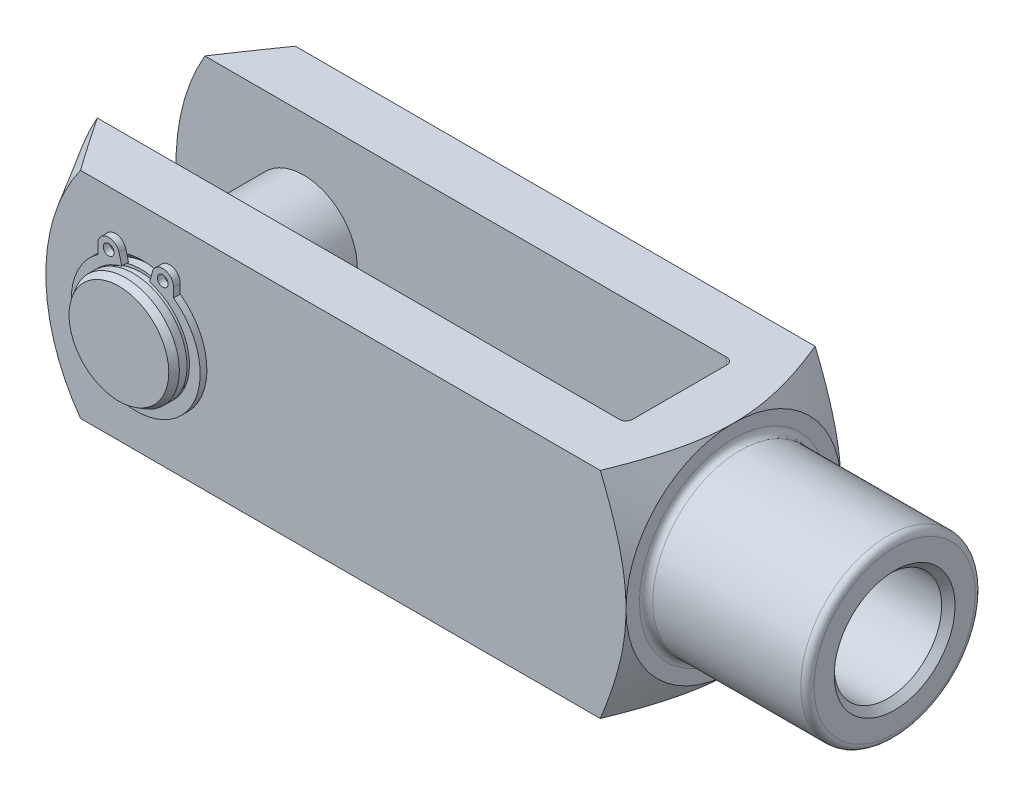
ISO-10303-21;
HEADER;
FILE_DESCRIPTION(('STEP AP214'),'2;1');
FILE_NAME('part.step','',(''),(''),'','','');
FILE_SCHEMA(('AUTOMOTIVE_DESIGN { 1 0 10303 214 1 1 1 1 }'));
ENDSEC;
DATA;
#1=APPLICATION_CONTEXT('core data for automotive mechanical design processes');
#2=APPLICATION_PROTOCOL_DEFINITION('international standard','automotive_design',2000,#1);
#3=PRODUCT_CONTEXT('',#1,'mechanical');
#4=PRODUCT('Part','Part','',(#3));
#5=PRODUCT_RELATED_PRODUCT_CATEGORY('part','',(#4));
#6=PRODUCT_DEFINITION_FORMATION('','',#4);
#7=PRODUCT_DEFINITION_CONTEXT('part definition',#1,'design');
#8=PRODUCT_DEFINITION('design','',#6,#7);
#9=PRODUCT_DEFINITION_SHAPE('','',#8);
#10=(LENGTH_UNIT() NAMED_UNIT(*) SI_UNIT(.MILLI.,.METRE.));
#11=(NAMED_UNIT(*) PLANE_ANGLE_UNIT() SI_UNIT($,.RADIAN.));
#12=(NAMED_UNIT(*) SI_UNIT($,.STERADIAN.) SOLID_ANGLE_UNIT());
#13=UNCERTAINTY_MEASURE_WITH_UNIT(LENGTH_MEASURE(1.E-05),#10,'distance_accuracy_value','');
#14=(GEOMETRIC_REPRESENTATION_CONTEXT(3) GLOBAL_UNCERTAINTY_ASSIGNED_CONTEXT((#13)) GLOBAL_UNIT_ASSIGNED_CONTEXT((#10,
#11,#12)) REPRESENTATION_CONTEXT('',''));
#15=CARTESIAN_POINT('',(0.,0.,0.));
#16=DIRECTION('',(0.,0.,1.));
#17=DIRECTION('',(1.,0.,0.));
#18=AXIS2_PLACEMENT_3D('',#15,#16,#17);
#19=CARTESIAN_POINT('',(-96.,0.,19.5));
#20=DIRECTION('',(0.,0.,-1.));
#21=DIRECTION('',(-1.,0.,0.));
#22=AXIS2_PLACEMENT_3D('',#19,#20,#21);
#23=CYLINDRICAL_SURFACE('',#22,8.);
#24=CARTESIAN_POINT('',(-96.,0.,16.25));
#25=DIRECTION('',(0.,0.,1.));
#26=DIRECTION('',(1.,0.,0.));
#27=AXIS2_PLACEMENT_3D('',#24,#25,#26);
#28=CIRCLE('',#27,8.);
#29=CARTESIAN_POINT('',(-88.,0.,16.25));
#30=VERTEX_POINT('',#29);
#31=EDGE_CURVE('P0_E55',#30,#30,#28,.T.);
#32=ORIENTED_EDGE('',*,*,#31,.F.);
#33=EDGE_LOOP('',(#32));
#34=FACE_BOUND('',#33,.T.);
#35=CARTESIAN_POINT('',(-96.,0.,-16.25));
#36=DIRECTION('',(0.,0.,1.));
#37=DIRECTION('',(1.,0.,0.));
#38=AXIS2_PLACEMENT_3D('',#35,#36,#37);
#39=CIRCLE('',#38,8.);
#40=CARTESIAN_POINT('',(-88.,0.,-16.25));
#41=VERTEX_POINT('',#40);
#42=EDGE_CURVE('P0_E40',#41,#41,#39,.T.);
#43=ORIENTED_EDGE('',*,*,#42,.T.);
#44=EDGE_LOOP('',(#43));
#45=FACE_BOUND('',#44,.T.);
#46=ADVANCED_FACE('P0_F14',(#34,#45),#23,.T.);
#47=CARTESIAN_POINT('',(-96.,0.,-17.35));
#48=DIRECTION('',(0.,0.,1.));
#49=DIRECTION('',(1.,0.,0.));
#50=AXIS2_PLACEMENT_3D('',#47,#48,#49);
#51=CIRCLE('',#50,8.);
#52=CARTESIAN_POINT('',(-88.,0.,-17.35));
#53=VERTEX_POINT('',#52);
#54=EDGE_CURVE('P0_E43',#53,#53,#51,.T.);
#55=ORIENTED_EDGE('',*,*,#54,.F.);
#56=EDGE_LOOP('',(#55));
#57=FACE_BOUND('',#56,.T.);
#58=CARTESIAN_POINT('',(-96.,0.,-18.5));
#59=DIRECTION('',(0.,0.,1.));
#60=DIRECTION('',(1.,0.,0.));
#61=AXIS2_PLACEMENT_3D('',#58,#59,#60);
#62=CIRCLE('',#61,8.);
#63=CARTESIAN_POINT('',(-88.,0.,-18.5));
#64=VERTEX_POINT('',#63);
#65=EDGE_CURVE('P0_E25',#64,#64,#62,.T.);
#66=ORIENTED_EDGE('',*,*,#65,.T.);
#67=EDGE_LOOP('',(#66));
#68=FACE_BOUND('',#67,.T.);
#69=ADVANCED_FACE('P0_F63',(#57,#68),#23,.T.);
#70=CARTESIAN_POINT('',(-96.,0.,-19.5));
#71=DIRECTION('',(0.,0.,1.));
#72=DIRECTION('',(1.,0.,0.));
#73=AXIS2_PLACEMENT_3D('',#70,#71,#72);
#74=PLANE('',#73);
#75=CARTESIAN_POINT('',(-96.,0.,-19.5));
#76=DIRECTION('',(0.,0.,1.));
#77=DIRECTION('',(1.,0.,0.));
#78=AXIS2_PLACEMENT_3D('',#75,#76,#77);
#79=CIRCLE('',#78,7.42264973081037);
#80=CARTESIAN_POINT('',(-88.5773502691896,0.,-19.5));
#81=VERTEX_POINT('',#80);
#82=EDGE_CURVE('P0_E21',#81,#81,#79,.F.);
#83=ORIENTED_EDGE('',*,*,#82,.T.);
#84=EDGE_LOOP('',(#83));
#85=FACE_BOUND('',#84,.T.);
#86=ADVANCED_FACE('P0_F89',(#85),#74,.F.);
#87=CARTESIAN_POINT('',(-96.,0.,-18.5));
#88=DIRECTION('',(0.,0.,1.));
#89=DIRECTION('',(1.,0.,0.));
#90=AXIS2_PLACEMENT_3D('',#87,#88,#89);
#91=CONICAL_SURFACE('',#90,8.,0.523598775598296);
#92=ORIENTED_EDGE('',*,*,#82,.F.);
#93=EDGE_LOOP('',(#92));
#94=FACE_BOUND('',#93,.T.);
#95=ORIENTED_EDGE('',*,*,#65,.F.);
#96=EDGE_LOOP('',(#95));
#97=FACE_BOUND('',#96,.T.);
#98=ADVANCED_FACE('P0_F83',(#94,#97),#91,.T.);
#99=CARTESIAN_POINT('',(-96.,8.,-17.35));
#100=DIRECTION('',(0.,0.,-1.));
#101=DIRECTION('',(-1.,0.,0.));
#102=AXIS2_PLACEMENT_3D('',#99,#100,#101);
#103=PLANE('',#102);
#104=CARTESIAN_POINT('',(-96.,0.,-17.35));
#105=DIRECTION('',(0.,0.,1.));
#106=DIRECTION('',(1.,0.,0.));
#107=AXIS2_PLACEMENT_3D('',#104,#105,#106);
#108=CIRCLE('',#107,7.6);
#109=CARTESIAN_POINT('',(-88.4,0.,-17.35));
#110=VERTEX_POINT('',#109);
#111=EDGE_CURVE('P0_E34',#110,#110,#108,.T.);
#112=ORIENTED_EDGE('',*,*,#111,.F.);
#113=EDGE_LOOP('',(#112));
#114=FACE_BOUND('',#113,.T.);
#115=ORIENTED_EDGE('',*,*,#54,.T.);
#116=EDGE_LOOP('',(#115));
#117=FACE_BOUND('',#116,.T.);
#118=ADVANCED_FACE('P0_F77',(#114,#117),#103,.F.);
#119=CARTESIAN_POINT('',(-96.,0.,18.5));
#120=DIRECTION('',(0.,0.,1.));
#121=DIRECTION('',(1.,0.,0.));
#122=AXIS2_PLACEMENT_3D('',#119,#120,#121);
#123=CYLINDRICAL_SURFACE('',#122,7.6);
#124=CARTESIAN_POINT('',(-96.,0.,-16.25));
#125=DIRECTION('',(0.,0.,1.));
#126=DIRECTION('',(1.,0.,0.));
#127=AXIS2_PLACEMENT_3D('',#124,#125,#126);
#128=CIRCLE('',#127,7.6);
#129=CARTESIAN_POINT('',(-88.4,0.,-16.25));
#130=VERTEX_POINT('',#129);
#131=EDGE_CURVE('P0_E37',#130,#130,#128,.T.);
#132=ORIENTED_EDGE('',*,*,#131,.F.);
#133=EDGE_LOOP('',(#132));
#134=FACE_BOUND('',#133,.T.);
#135=ORIENTED_EDGE('',*,*,#111,.T.);
#136=EDGE_LOOP('',(#135));
#137=FACE_BOUND('',#136,.T.);
#138=ADVANCED_FACE('P0_F71',(#134,#137),#123,.T.);
#139=CARTESIAN_POINT('',(-96.,8.,-16.25));
#140=DIRECTION('',(0.,0.,1.));
#141=DIRECTION('',(1.,0.,0.));
#142=AXIS2_PLACEMENT_3D('',#139,#140,#141);
#143=PLANE('',#142);
#144=ORIENTED_EDGE('',*,*,#42,.F.);
#145=EDGE_LOOP('',(#144));
#146=FACE_BOUND('',#145,.T.);
#147=ORIENTED_EDGE('',*,*,#131,.T.);
#148=EDGE_LOOP('',(#147));
#149=FACE_BOUND('',#148,.T.);
#150=ADVANCED_FACE('P0_F68',(#146,#149),#143,.F.);
#151=CARTESIAN_POINT('',(-96.,8.,16.25));
#152=DIRECTION('',(0.,0.,-1.));
#153=DIRECTION('',(-1.,0.,0.));
#154=AXIS2_PLACEMENT_3D('',#151,#152,#153);
#155=PLANE('',#154);
#156=CARTESIAN_POINT('',(-96.,0.,16.25));
#157=DIRECTION('',(0.,0.,1.));
#158=DIRECTION('',(1.,0.,0.));
#159=AXIS2_PLACEMENT_3D('',#156,#157,#158);
#160=CIRCLE('',#159,7.6);
#161=CARTESIAN_POINT('',(-88.4,0.,16.25));
#162=VERTEX_POINT('',#161);
#163=EDGE_CURVE('P0_E46',#162,#162,#160,.T.);
#164=ORIENTED_EDGE('',*,*,#163,.F.);
#165=EDGE_LOOP('',(#164));
#166=FACE_BOUND('',#165,.T.);
#167=ORIENTED_EDGE('',*,*,#31,.T.);
#168=EDGE_LOOP('',(#167));
#169=FACE_BOUND('',#168,.T.);
#170=ADVANCED_FACE('P0_F59',(#166,#169),#155,.F.);
#171=CARTESIAN_POINT('',(-96.,0.,18.5));
#172=DIRECTION('',(0.,0.,1.));
#173=DIRECTION('',(1.,0.,0.));
#174=AXIS2_PLACEMENT_3D('',#171,#172,#173);
#175=CYLINDRICAL_SURFACE('',#174,7.6);
#176=CARTESIAN_POINT('',(-96.,0.,17.35));
#177=DIRECTION('',(0.,0.,1.));
#178=DIRECTION('',(1.,0.,0.));
#179=AXIS2_PLACEMENT_3D('',#176,#177,#178);
#180=CIRCLE('',#179,7.6);
#181=CARTESIAN_POINT('',(-88.4,0.,17.35));
#182=VERTEX_POINT('',#181);
#183=EDGE_CURVE('P0_E49',#182,#182,#180,.T.);
#184=ORIENTED_EDGE('',*,*,#183,.F.);
#185=EDGE_LOOP('',(#184));
#186=FACE_BOUND('',#185,.T.);
#187=ORIENTED_EDGE('',*,*,#163,.T.);
#188=EDGE_LOOP('',(#187));
#189=FACE_BOUND('',#188,.T.);
#190=ADVANCED_FACE('P0_F108',(#186,#189),#175,.T.);
#191=CARTESIAN_POINT('',(-96.,8.,17.35));
#192=DIRECTION('',(0.,0.,1.));
#193=DIRECTION('',(1.,0.,0.));
#194=AXIS2_PLACEMENT_3D('',#191,#192,#193);
#195=PLANE('',#194);
#196=CARTESIAN_POINT('',(-96.,0.,17.35));
#197=DIRECTION('',(0.,0.,1.));
#198=DIRECTION('',(1.,0.,0.));
#199=AXIS2_PLACEMENT_3D('',#196,#197,#198);
#200=CIRCLE('',#199,8.);
#201=CARTESIAN_POINT('',(-88.,0.,17.35));
#202=VERTEX_POINT('',#201);
#203=EDGE_CURVE('P0_E52',#202,#202,#200,.T.);
#204=ORIENTED_EDGE('',*,*,#203,.F.);
#205=EDGE_LOOP('',(#204));
#206=FACE_BOUND('',#205,.T.);
#207=ORIENTED_EDGE('',*,*,#183,.T.);
#208=EDGE_LOOP('',(#207));
#209=FACE_BOUND('',#208,.T.);
#210=ADVANCED_FACE('P0_F104',(#206,#209),#195,.F.);
#211=CARTESIAN_POINT('',(-96.,0.,19.5));
#212=DIRECTION('',(0.,0.,1.));
#213=DIRECTION('',(1.,0.,0.));
#214=AXIS2_PLACEMENT_3D('',#211,#212,#213);
#215=PLANE('',#214);
#216=CARTESIAN_POINT('',(-96.,0.,19.5));
#217=DIRECTION('',(0.,0.,1.));
#218=DIRECTION('',(1.,0.,0.));
#219=AXIS2_PLACEMENT_3D('',#216,#217,#218);
#220=CIRCLE('',#219,7.42264973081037);
#221=CARTESIAN_POINT('',(-88.5773502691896,0.,19.5));
#222=VERTEX_POINT('',#221);
#223=EDGE_CURVE('P0_E10',#222,#222,#220,.T.);
#224=ORIENTED_EDGE('',*,*,#223,.T.);
#225=EDGE_LOOP('',(#224));
#226=FACE_BOUND('',#225,.T.);
#227=ADVANCED_FACE('P0_F102',(#226),#215,.T.);
#228=CARTESIAN_POINT('',(-96.,0.,19.5));
#229=DIRECTION('',(0.,0.,-1.));
#230=DIRECTION('',(-1.,0.,0.));
#231=AXIS2_PLACEMENT_3D('',#228,#229,#230);
#232=CONICAL_SURFACE('',#231,7.42264973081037,0.523598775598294);
#233=CARTESIAN_POINT('',(-96.,0.,18.5));
#234=DIRECTION('',(0.,0.,1.));
#235=DIRECTION('',(1.,0.,0.));
#236=AXIS2_PLACEMENT_3D('',#233,#234,#235);
#237=CIRCLE('',#236,8.);
#238=CARTESIAN_POINT('',(-88.,0.,18.5));
#239=VERTEX_POINT('',#238);
#240=EDGE_CURVE('P0_E29',#239,#239,#237,.F.);
#241=ORIENTED_EDGE('',*,*,#240,.F.);
#242=EDGE_LOOP('',(#241));
#243=FACE_BOUND('',#242,.T.);
#244=ORIENTED_EDGE('',*,*,#223,.F.);
#245=EDGE_LOOP('',(#244));
#246=FACE_BOUND('',#245,.T.);
#247=ADVANCED_FACE('P0_F16',(#243,#246),#232,.T.);
#248=ORIENTED_EDGE('',*,*,#203,.T.);
#249=EDGE_LOOP('',(#248));
#250=FACE_BOUND('',#249,.T.);
#251=ORIENTED_EDGE('',*,*,#240,.T.);
#252=EDGE_LOOP('',(#251));
#253=FACE_BOUND('',#252,.T.);
#254=ADVANCED_FACE('P0_F65',(#250,#253),#23,.T.);
#255=CLOSED_SHELL('',(#46,#69,#86,#98,#118,#138,#150,#170,#190,#210,#227,#247,#254));
#256=MANIFOLD_SOLID_BREP('P0_B1',#255);
#257=CARTESIAN_POINT('',(-96.0000000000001,0.,16.9999999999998));
#258=DIRECTION('',(0.,0.,1.));
#259=DIRECTION('',(1.,0.,0.));
#260=AXIS2_PLACEMENT_3D('',#257,#258,#259);
#261=PLANE('',#260);
#262=CARTESIAN_POINT('',(-100.030144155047,8.85877746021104,16.9999999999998));
#263=DIRECTION('',(0.,0.,1.));
#264=DIRECTION('',(1.,0.,0.));
#265=AXIS2_PLACEMENT_3D('',#262,#263,#264);
#266=CIRCLE('',#265,0.8);
#267=CARTESIAN_POINT('',(-99.2301441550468,8.85877746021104,16.9999999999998));
#268=VERTEX_POINT('',#267);
#269=EDGE_CURVE('P1_E117',#268,#268,#266,.T.);
#270=ORIENTED_EDGE('',*,*,#269,.F.);
#271=EDGE_LOOP('',(#270));
#272=FACE_BOUND('',#271,.T.);
#273=CARTESIAN_POINT('',(-96.0000000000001,0.,16.9999999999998));
#274=DIRECTION('',(0.,0.,-1.));
#275=DIRECTION('',(1.,0.,0.));
#276=AXIS2_PLACEMENT_3D('',#273,#274,#275);
#277=CIRCLE('',#276,8.);
#278=CARTESIAN_POINT('',(-93.9294476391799,7.72740661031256,16.9999999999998));
#279=VERTEX_POINT('',#278);
#280=CARTESIAN_POINT('',(-98.0705523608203,7.72740661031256,16.9999999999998));
#281=VERTEX_POINT('',#280);
#282=EDGE_CURVE('P1_E128',#279,#281,#277,.T.);
#283=ORIENTED_EDGE('',*,*,#282,.T.);
#284=DIRECTION('',(-0.258819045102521,0.965925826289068,0.));
#285=VECTOR('',#284,1.);
#286=CARTESIAN_POINT('',(-98.0705523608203,7.72740661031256,16.9999999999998));
#287=LINE('',#286,#285);
#288=CARTESIAN_POINT('',(-98.4846628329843,9.27288793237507,16.9999999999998));
#289=VERTEX_POINT('',#288);
#290=EDGE_CURVE('P1_E76',#281,#289,#287,.T.);
#291=ORIENTED_EDGE('',*,*,#290,.T.);
#292=CARTESIAN_POINT('',(-100.030144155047,8.85877746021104,16.9999999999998));
#293=DIRECTION('',(0.,0.,1.));
#294=DIRECTION('',(1.,0.,0.));
#295=AXIS2_PLACEMENT_3D('',#292,#293,#294);
#296=CIRCLE('',#295,1.6);
#297=CARTESIAN_POINT('',(-101.630144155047,8.85877746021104,16.9999999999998));
#298=VERTEX_POINT('',#297);
#299=EDGE_CURVE('P1_E143',#289,#298,#296,.T.);
#300=ORIENTED_EDGE('',*,*,#299,.T.);
#301=DIRECTION('',(0.,-1.,0.));
#302=VECTOR('',#301,1.);
#303=CARTESIAN_POINT('',(-101.630144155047,8.85877746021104,16.9999999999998));
#304=LINE('',#303,#302);
#305=CARTESIAN_POINT('',(-101.630144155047,7.45569783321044,16.9999999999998));
#306=VERTEX_POINT('',#305);
#307=EDGE_CURVE('P1_E156',#298,#306,#304,.T.);
#308=ORIENTED_EDGE('',*,*,#307,.T.);
#309=CARTESIAN_POINT('',(-96.0000000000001,-0.319999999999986,16.9999999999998));
#310=DIRECTION('',(0.,0.,1.));
#311=DIRECTION('',(1.,0.,0.));
#312=AXIS2_PLACEMENT_3D('',#309,#310,#311);
#313=CIRCLE('',#312,9.6);
#314=CARTESIAN_POINT('',(-90.3698558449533,7.45569783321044,16.9999999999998));
#315=VERTEX_POINT('',#314);
#316=EDGE_CURVE('P1_E95',#306,#315,#313,.T.);
#317=ORIENTED_EDGE('',*,*,#316,.T.);
#318=DIRECTION('',(0.,1.,0.));
#319=VECTOR('',#318,1.);
#320=CARTESIAN_POINT('',(-90.3698558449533,8.85877746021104,16.9999999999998));
#321=LINE('',#320,#319);
#322=CARTESIAN_POINT('',(-90.3698558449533,8.85877746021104,16.9999999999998));
#323=VERTEX_POINT('',#322);
#324=EDGE_CURVE('P1_E89',#315,#323,#321,.T.);
#325=ORIENTED_EDGE('',*,*,#324,.T.);
#326=CARTESIAN_POINT('',(-91.9698558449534,8.85877746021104,16.9999999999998));
#327=DIRECTION('',(0.,0.,1.));
#328=DIRECTION('',(-1.,0.,0.));
#329=AXIS2_PLACEMENT_3D('',#326,#327,#328);
#330=CIRCLE('',#329,1.6);
#331=CARTESIAN_POINT('',(-93.5153371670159,9.27288793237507,16.9999999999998));
#332=VERTEX_POINT('',#331);
#333=EDGE_CURVE('P1_E93',#323,#332,#330,.T.);
#334=ORIENTED_EDGE('',*,*,#333,.T.);
#335=DIRECTION('',(-0.258819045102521,-0.965925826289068,0.));
#336=VECTOR('',#335,1.);
#337=CARTESIAN_POINT('',(-93.9294476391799,7.72740661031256,16.9999999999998));
#338=LINE('',#337,#336);
#339=EDGE_CURVE('P1_E33',#332,#279,#338,.T.);
#340=ORIENTED_EDGE('',*,*,#339,.T.);
#341=EDGE_LOOP('',(#283,#291,#300,#308,#317,#325,#334,#340));
#342=FACE_BOUND('',#341,.T.);
#343=CARTESIAN_POINT('',(-91.9698558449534,8.85877746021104,16.9999999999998));
#344=DIRECTION('',(0.,0.,1.));
#345=DIRECTION('',(-1.,0.,0.));
#346=AXIS2_PLACEMENT_3D('',#343,#344,#345);
#347=CIRCLE('',#346,0.8);
#348=CARTESIAN_POINT('',(-92.7698558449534,8.85877746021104,16.9999999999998));
#349=VERTEX_POINT('',#348);
#350=EDGE_CURVE('P1_E165',#349,#349,#347,.T.);
#351=ORIENTED_EDGE('',*,*,#350,.F.);
#352=EDGE_LOOP('',(#351));
#353=FACE_BOUND('',#352,.T.);
#354=ADVANCED_FACE('P1_F16',(#272,#342,#353),#261,.T.);
#355=CARTESIAN_POINT('',(-96.0000000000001,0.,15.9999999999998));
#356=DIRECTION('',(0.,0.,1.));
#357=DIRECTION('',(1.,0.,0.));
#358=AXIS2_PLACEMENT_3D('',#355,#356,#357);
#359=PLANE('',#358);
#360=CARTESIAN_POINT('',(-100.030144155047,8.85877746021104,15.9999999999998));
#361=DIRECTION('',(0.,0.,1.));
#362=DIRECTION('',(1.,0.,0.));
#363=AXIS2_PLACEMENT_3D('',#360,#361,#362);
#364=CIRCLE('',#363,0.8);
#365=CARTESIAN_POINT('',(-99.2301441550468,8.85877746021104,15.9999999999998));
#366=VERTEX_POINT('',#365);
#367=EDGE_CURVE('P1_E162',#366,#366,#364,.T.);
#368=ORIENTED_EDGE('',*,*,#367,.T.);
#369=EDGE_LOOP('',(#368));
#370=FACE_BOUND('',#369,.T.);
#371=CARTESIAN_POINT('',(-96.0000000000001,0.,15.9999999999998));
#372=DIRECTION('',(0.,0.,-1.));
#373=DIRECTION('',(1.,0.,0.));
#374=AXIS2_PLACEMENT_3D('',#371,#372,#373);
#375=CIRCLE('',#374,8.);
#376=CARTESIAN_POINT('',(-93.9294476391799,7.72740661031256,15.9999999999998));
#377=VERTEX_POINT('',#376);
#378=CARTESIAN_POINT('',(-98.0705523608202,7.72740661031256,15.9999999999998));
#379=VERTEX_POINT('',#378);
#380=EDGE_CURVE('P1_E113',#377,#379,#375,.T.);
#381=ORIENTED_EDGE('',*,*,#380,.F.);
#382=DIRECTION('',(-0.258819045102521,-0.965925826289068,0.));
#383=VECTOR('',#382,1.);
#384=CARTESIAN_POINT('',(-93.9294476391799,7.72740661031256,15.9999999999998));
#385=LINE('',#384,#383);
#386=CARTESIAN_POINT('',(-93.5153371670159,9.27288793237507,15.9999999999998));
#387=VERTEX_POINT('',#386);
#388=EDGE_CURVE('P1_E68',#387,#377,#385,.T.);
#389=ORIENTED_EDGE('',*,*,#388,.F.);
#390=CARTESIAN_POINT('',(-91.9698558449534,8.85877746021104,15.9999999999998));
#391=DIRECTION('',(0.,0.,1.));
#392=DIRECTION('',(-1.,0.,0.));
#393=AXIS2_PLACEMENT_3D('',#390,#391,#392);
#394=CIRCLE('',#393,1.6);
#395=CARTESIAN_POINT('',(-90.3698558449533,8.85877746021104,15.9999999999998));
#396=VERTEX_POINT('',#395);
#397=EDGE_CURVE('P1_E62',#396,#387,#394,.T.);
#398=ORIENTED_EDGE('',*,*,#397,.F.);
#399=DIRECTION('',(0.,1.,0.));
#400=VECTOR('',#399,1.);
#401=CARTESIAN_POINT('',(-90.3698558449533,8.85877746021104,15.9999999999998));
#402=LINE('',#401,#400);
#403=CARTESIAN_POINT('',(-90.3698558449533,7.45569783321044,15.9999999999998));
#404=VERTEX_POINT('',#403);
#405=EDGE_CURVE('P1_E103',#404,#396,#402,.T.);
#406=ORIENTED_EDGE('',*,*,#405,.F.);
#407=CARTESIAN_POINT('',(-96.0000000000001,-0.319999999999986,15.9999999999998));
#408=DIRECTION('',(0.,0.,1.));
#409=DIRECTION('',(1.,0.,0.));
#410=AXIS2_PLACEMENT_3D('',#407,#408,#409);
#411=CIRCLE('',#410,9.6);
#412=CARTESIAN_POINT('',(-101.630144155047,7.45569783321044,15.9999999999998));
#413=VERTEX_POINT('',#412);
#414=EDGE_CURVE('P1_E123',#413,#404,#411,.T.);
#415=ORIENTED_EDGE('',*,*,#414,.F.);
#416=DIRECTION('',(0.,-1.,0.));
#417=VECTOR('',#416,1.);
#418=CARTESIAN_POINT('',(-101.630144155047,8.85877746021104,15.9999999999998));
#419=LINE('',#418,#417);
#420=CARTESIAN_POINT('',(-101.630144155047,8.85877746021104,15.9999999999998));
#421=VERTEX_POINT('',#420);
#422=EDGE_CURVE('P1_E121',#421,#413,#419,.T.);
#423=ORIENTED_EDGE('',*,*,#422,.F.);
#424=CARTESIAN_POINT('',(-100.030144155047,8.85877746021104,15.9999999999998));
#425=DIRECTION('',(0.,0.,1.));
#426=DIRECTION('',(1.,0.,0.));
#427=AXIS2_PLACEMENT_3D('',#424,#425,#426);
#428=CIRCLE('',#427,1.6);
#429=CARTESIAN_POINT('',(-98.4846628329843,9.27288793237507,15.9999999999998));
#430=VERTEX_POINT('',#429);
#431=EDGE_CURVE('P1_E119',#430,#421,#428,.T.);
#432=ORIENTED_EDGE('',*,*,#431,.F.);
#433=DIRECTION('',(-0.258819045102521,0.965925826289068,0.));
#434=VECTOR('',#433,1.);
#435=CARTESIAN_POINT('',(-98.0705523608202,7.72740661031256,15.9999999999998));
#436=LINE('',#435,#434);
#437=EDGE_CURVE('P1_E116',#379,#430,#436,.T.);
#438=ORIENTED_EDGE('',*,*,#437,.F.);
#439=EDGE_LOOP('',(#381,#389,#398,#406,#415,#423,#432,#438));
#440=FACE_BOUND('',#439,.T.);
#441=CARTESIAN_POINT('',(-91.9698558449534,8.85877746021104,15.9999999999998));
#442=DIRECTION('',(0.,0.,1.));
#443=DIRECTION('',(-1.,0.,0.));
#444=AXIS2_PLACEMENT_3D('',#441,#442,#443);
#445=CIRCLE('',#444,0.8);
#446=CARTESIAN_POINT('',(-92.7698558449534,8.85877746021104,15.9999999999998));
#447=VERTEX_POINT('',#446);
#448=EDGE_CURVE('P1_E168',#447,#447,#445,.T.);
#449=ORIENTED_EDGE('',*,*,#448,.T.);
#450=EDGE_LOOP('',(#449));
#451=FACE_BOUND('',#450,.T.);
#452=ADVANCED_FACE('P1_F147',(#370,#440,#451),#359,.F.);
#453=CARTESIAN_POINT('',(-96.0000000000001,0.,16.9999999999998));
#454=DIRECTION('',(0.,0.,-1.));
#455=DIRECTION('',(-1.,0.,0.));
#456=AXIS2_PLACEMENT_3D('',#453,#454,#455);
#457=CYLINDRICAL_SURFACE('',#456,8.);
#458=ORIENTED_EDGE('',*,*,#380,.T.);
#459=DIRECTION('',(0.,0.,-1.));
#460=VECTOR('',#459,1.);
#461=CARTESIAN_POINT('',(-98.0705523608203,7.72740661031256,16.9999999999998));
#462=LINE('',#461,#460);
#463=EDGE_CURVE('P1_E11',#281,#379,#462,.T.);
#464=ORIENTED_EDGE('',*,*,#463,.F.);
#465=ORIENTED_EDGE('',*,*,#282,.F.);
#466=DIRECTION('',(0.,0.,-1.));
#467=VECTOR('',#466,1.);
#468=CARTESIAN_POINT('',(-93.9294476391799,7.72740661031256,16.9999999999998));
#469=LINE('',#468,#467);
#470=EDGE_CURVE('P1_E109',#279,#377,#469,.T.);
#471=ORIENTED_EDGE('',*,*,#470,.T.);
#472=EDGE_LOOP('',(#458,#464,#465,#471));
#473=FACE_BOUND('',#472,.T.);
#474=ADVANCED_FACE('P1_F18',(#473),#457,.F.);
#475=CARTESIAN_POINT('',(-98.0705523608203,7.72740661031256,16.9999999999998));
#476=DIRECTION('',(-0.965925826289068,-0.258819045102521,0.));
#477=DIRECTION('',(0.258819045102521,-0.965925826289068,0.));
#478=AXIS2_PLACEMENT_3D('',#475,#476,#477);
#479=PLANE('',#478);
#480=ORIENTED_EDGE('',*,*,#437,.T.);
#481=DIRECTION('',(0.,0.,-1.));
#482=VECTOR('',#481,1.);
#483=CARTESIAN_POINT('',(-98.4846628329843,9.27288793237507,16.9999999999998));
#484=LINE('',#483,#482);
#485=EDGE_CURVE('P1_E25',#289,#430,#484,.T.);
#486=ORIENTED_EDGE('',*,*,#485,.F.);
#487=ORIENTED_EDGE('',*,*,#290,.F.);
#488=ORIENTED_EDGE('',*,*,#463,.T.);
#489=EDGE_LOOP('',(#480,#486,#487,#488));
#490=FACE_BOUND('',#489,.T.);
#491=ADVANCED_FACE('P1_F202',(#490),#479,.F.);
#492=CARTESIAN_POINT('',(-100.030144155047,8.85877746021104,16.9999999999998));
#493=DIRECTION('',(0.,0.,-1.));
#494=DIRECTION('',(-1.,0.,0.));
#495=AXIS2_PLACEMENT_3D('',#492,#493,#494);
#496=CYLINDRICAL_SURFACE('',#495,1.6);
#497=ORIENTED_EDGE('',*,*,#431,.T.);
#498=DIRECTION('',(0.,0.,-1.));
#499=VECTOR('',#498,1.);
#500=CARTESIAN_POINT('',(-101.630144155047,8.85877746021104,16.9999999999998));
#501=LINE('',#500,#499);
#502=EDGE_CURVE('P1_E135',#298,#421,#501,.T.);
#503=ORIENTED_EDGE('',*,*,#502,.F.);
#504=ORIENTED_EDGE('',*,*,#299,.F.);
#505=ORIENTED_EDGE('',*,*,#485,.T.);
#506=EDGE_LOOP('',(#497,#503,#504,#505));
#507=FACE_BOUND('',#506,.T.);
#508=ADVANCED_FACE('P1_F141',(#507),#496,.T.);
#509=CARTESIAN_POINT('',(-101.630144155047,8.85877746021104,16.9999999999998));
#510=DIRECTION('',(1.,0.,0.));
#511=DIRECTION('',(0.,1.,0.));
#512=AXIS2_PLACEMENT_3D('',#509,#510,#511);
#513=PLANE('',#512);
#514=ORIENTED_EDGE('',*,*,#422,.T.);
#515=DIRECTION('',(0.,0.,-1.));
#516=VECTOR('',#515,1.);
#517=CARTESIAN_POINT('',(-101.630144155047,7.45569783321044,16.9999999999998));
#518=LINE('',#517,#516);
#519=EDGE_CURVE('P1_E132',#306,#413,#518,.T.);
#520=ORIENTED_EDGE('',*,*,#519,.F.);
#521=ORIENTED_EDGE('',*,*,#307,.F.);
#522=ORIENTED_EDGE('',*,*,#502,.T.);
#523=EDGE_LOOP('',(#514,#520,#521,#522));
#524=FACE_BOUND('',#523,.T.);
#525=ADVANCED_FACE('P1_F152',(#524),#513,.F.);
#526=CARTESIAN_POINT('',(-96.0000000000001,-0.319999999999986,16.9999999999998));
#527=DIRECTION('',(0.,0.,-1.));
#528=DIRECTION('',(-1.,0.,0.));
#529=AXIS2_PLACEMENT_3D('',#526,#527,#528);
#530=CYLINDRICAL_SURFACE('',#529,9.6);
#531=ORIENTED_EDGE('',*,*,#414,.T.);
#532=DIRECTION('',(0.,0.,-1.));
#533=VECTOR('',#532,1.);
#534=CARTESIAN_POINT('',(-90.3698558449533,7.45569783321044,16.9999999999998));
#535=LINE('',#534,#533);
#536=EDGE_CURVE('P1_E104',#315,#404,#535,.T.);
#537=ORIENTED_EDGE('',*,*,#536,.F.);
#538=ORIENTED_EDGE('',*,*,#316,.F.);
#539=ORIENTED_EDGE('',*,*,#519,.T.);
#540=EDGE_LOOP('',(#531,#537,#538,#539));
#541=FACE_BOUND('',#540,.T.);
#542=ADVANCED_FACE('P1_F155',(#541),#530,.T.);
#543=CARTESIAN_POINT('',(-90.3698558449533,8.85877746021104,16.9999999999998));
#544=DIRECTION('',(-1.,0.,0.));
#545=DIRECTION('',(0.,-1.,0.));
#546=AXIS2_PLACEMENT_3D('',#543,#544,#545);
#547=PLANE('',#546);
#548=ORIENTED_EDGE('',*,*,#405,.T.);
#549=DIRECTION('',(0.,0.,-1.));
#550=VECTOR('',#549,1.);
#551=CARTESIAN_POINT('',(-90.3698558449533,8.85877746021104,16.9999999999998));
#552=LINE('',#551,#550);
#553=EDGE_CURVE('P1_E100',#323,#396,#552,.T.);
#554=ORIENTED_EDGE('',*,*,#553,.F.);
#555=ORIENTED_EDGE('',*,*,#324,.F.);
#556=ORIENTED_EDGE('',*,*,#536,.T.);
#557=EDGE_LOOP('',(#548,#554,#555,#556));
#558=FACE_BOUND('',#557,.T.);
#559=ADVANCED_FACE('P1_F101',(#558),#547,.F.);
#560=CARTESIAN_POINT('',(-91.9698558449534,8.85877746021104,16.9999999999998));
#561=DIRECTION('',(0.,0.,-1.));
#562=DIRECTION('',(-1.,0.,0.));
#563=AXIS2_PLACEMENT_3D('',#560,#561,#562);
#564=CYLINDRICAL_SURFACE('',#563,1.6);
#565=ORIENTED_EDGE('',*,*,#397,.T.);
#566=DIRECTION('',(0.,0.,-1.));
#567=VECTOR('',#566,1.);
#568=CARTESIAN_POINT('',(-93.5153371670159,9.27288793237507,16.9999999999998));
#569=LINE('',#568,#567);
#570=EDGE_CURVE('P1_E105',#332,#387,#569,.T.);
#571=ORIENTED_EDGE('',*,*,#570,.F.);
#572=ORIENTED_EDGE('',*,*,#333,.F.);
#573=ORIENTED_EDGE('',*,*,#553,.T.);
#574=EDGE_LOOP('',(#565,#571,#572,#573));
#575=FACE_BOUND('',#574,.T.);
#576=ADVANCED_FACE('P1_F107',(#575),#564,.T.);
#577=CARTESIAN_POINT('',(-93.9294476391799,7.72740661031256,16.9999999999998));
#578=DIRECTION('',(0.965925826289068,-0.258819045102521,0.));
#579=DIRECTION('',(0.258819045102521,0.965925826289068,0.));
#580=AXIS2_PLACEMENT_3D('',#577,#578,#579);
#581=PLANE('',#580);
#582=ORIENTED_EDGE('',*,*,#388,.T.);
#583=ORIENTED_EDGE('',*,*,#470,.F.);
#584=ORIENTED_EDGE('',*,*,#339,.F.);
#585=ORIENTED_EDGE('',*,*,#570,.T.);
#586=EDGE_LOOP('',(#582,#583,#584,#585));
#587=FACE_BOUND('',#586,.T.);
#588=ADVANCED_FACE('P1_F190',(#587),#581,.F.);
#589=CARTESIAN_POINT('',(-100.030144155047,8.85877746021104,16.9999999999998));
#590=DIRECTION('',(0.,0.,-1.));
#591=DIRECTION('',(-1.,0.,0.));
#592=AXIS2_PLACEMENT_3D('',#589,#590,#591);
#593=CYLINDRICAL_SURFACE('',#592,0.8);
#594=ORIENTED_EDGE('',*,*,#269,.T.);
#595=EDGE_LOOP('',(#594));
#596=FACE_BOUND('',#595,.T.);
#597=ORIENTED_EDGE('',*,*,#367,.F.);
#598=EDGE_LOOP('',(#597));
#599=FACE_BOUND('',#598,.T.);
#600=ADVANCED_FACE('P1_F187',(#596,#599),#593,.F.);
#601=CARTESIAN_POINT('',(-91.9698558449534,8.85877746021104,16.9999999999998));
#602=DIRECTION('',(0.,0.,-1.));
#603=DIRECTION('',(-1.,0.,0.));
#604=AXIS2_PLACEMENT_3D('',#601,#602,#603);
#605=CYLINDRICAL_SURFACE('',#604,0.8);
#606=ORIENTED_EDGE('',*,*,#350,.T.);
#607=EDGE_LOOP('',(#606));
#608=FACE_BOUND('',#607,.T.);
#609=ORIENTED_EDGE('',*,*,#448,.F.);
#610=EDGE_LOOP('',(#609));
#611=FACE_BOUND('',#610,.T.);
#612=ADVANCED_FACE('P1_F174',(#608,#611),#605,.F.);
#613=CLOSED_SHELL('',(#354,#452,#474,#491,#508,#525,#542,#559,#576,#588,#600,#612));
#614=MANIFOLD_SOLID_BREP('P1_B1',#613);
#615=CARTESIAN_POINT('',(-96.0000000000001,0.,-16.9999999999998));
#616=DIRECTION('',(0.,0.,-1.));
#617=DIRECTION('',(-1.,0.,0.));
#618=AXIS2_PLACEMENT_3D('',#615,#616,#617);
#619=PLANE('',#618);
#620=CARTESIAN_POINT('',(-91.9698558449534,8.85877746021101,-16.9999999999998));
#621=DIRECTION('',(0.,0.,-1.));
#622=DIRECTION('',(-1.,0.,0.));
#623=AXIS2_PLACEMENT_3D('',#620,#621,#622);
#624=CIRCLE('',#623,0.8);
#625=CARTESIAN_POINT('',(-92.7698558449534,8.85877746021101,-16.9999999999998));
#626=VERTEX_POINT('',#625);
#627=EDGE_CURVE('P2_E117',#626,#626,#624,.T.);
#628=ORIENTED_EDGE('',*,*,#627,.F.);
#629=EDGE_LOOP('',(#628));
#630=FACE_BOUND('',#629,.T.);
#631=CARTESIAN_POINT('',(-96.0000000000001,0.,-16.9999999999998));
#632=DIRECTION('',(0.,0.,1.));
#633=DIRECTION('',(-1.,0.,0.));
#634=AXIS2_PLACEMENT_3D('',#631,#632,#633);
#635=CIRCLE('',#634,8.);
#636=CARTESIAN_POINT('',(-98.0705523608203,7.72740661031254,-16.9999999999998));
#637=VERTEX_POINT('',#636);
#638=CARTESIAN_POINT('',(-93.9294476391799,7.72740661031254,-16.9999999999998));
#639=VERTEX_POINT('',#638);
#640=EDGE_CURVE('P2_E128',#637,#639,#635,.T.);
#641=ORIENTED_EDGE('',*,*,#640,.T.);
#642=DIRECTION('',(0.258819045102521,0.965925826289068,0.));
#643=VECTOR('',#642,1.);
#644=CARTESIAN_POINT('',(-93.9294476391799,7.72740661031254,-16.9999999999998));
#645=LINE('',#644,#643);
#646=CARTESIAN_POINT('',(-93.5153371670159,9.27288793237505,-16.9999999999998));
#647=VERTEX_POINT('',#646);
#648=EDGE_CURVE('P2_E76',#639,#647,#645,.T.);
#649=ORIENTED_EDGE('',*,*,#648,.T.);
#650=CARTESIAN_POINT('',(-91.9698558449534,8.85877746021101,-16.9999999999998));
#651=DIRECTION('',(0.,0.,-1.));
#652=DIRECTION('',(-1.,0.,0.));
#653=AXIS2_PLACEMENT_3D('',#650,#651,#652);
#654=CIRCLE('',#653,1.6);
#655=CARTESIAN_POINT('',(-90.3698558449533,8.85877746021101,-16.9999999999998));
#656=VERTEX_POINT('',#655);
#657=EDGE_CURVE('P2_E143',#647,#656,#654,.T.);
#658=ORIENTED_EDGE('',*,*,#657,.T.);
#659=DIRECTION('',(0.,-1.,0.));
#660=VECTOR('',#659,1.);
#661=CARTESIAN_POINT('',(-90.3698558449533,8.85877746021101,-16.9999999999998));
#662=LINE('',#661,#660);
#663=CARTESIAN_POINT('',(-90.3698558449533,7.45569783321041,-16.9999999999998));
#664=VERTEX_POINT('',#663);
#665=EDGE_CURVE('P2_E156',#656,#664,#662,.T.);
#666=ORIENTED_EDGE('',*,*,#665,.T.);
#667=CARTESIAN_POINT('',(-96.0000000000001,-0.320000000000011,-16.9999999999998));
#668=DIRECTION('',(0.,0.,-1.));
#669=DIRECTION('',(-1.,0.,0.));
#670=AXIS2_PLACEMENT_3D('',#667,#668,#669);
#671=CIRCLE('',#670,9.6);
#672=CARTESIAN_POINT('',(-101.630144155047,7.45569783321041,-16.9999999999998));
#673=VERTEX_POINT('',#672);
#674=EDGE_CURVE('P2_E95',#664,#673,#671,.T.);
#675=ORIENTED_EDGE('',*,*,#674,.T.);
#676=DIRECTION('',(0.,1.,0.));
#677=VECTOR('',#676,1.);
#678=CARTESIAN_POINT('',(-101.630144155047,8.85877746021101,-16.9999999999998));
#679=LINE('',#678,#677);
#680=CARTESIAN_POINT('',(-101.630144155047,8.85877746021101,-16.9999999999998));
#681=VERTEX_POINT('',#680);
#682=EDGE_CURVE('P2_E89',#673,#681,#679,.T.);
#683=ORIENTED_EDGE('',*,*,#682,.T.);
#684=CARTESIAN_POINT('',(-100.030144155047,8.85877746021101,-16.9999999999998));
#685=DIRECTION('',(0.,0.,-1.));
#686=DIRECTION('',(1.,0.,0.));
#687=AXIS2_PLACEMENT_3D('',#684,#685,#686);
#688=CIRCLE('',#687,1.6);
#689=CARTESIAN_POINT('',(-98.4846628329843,9.27288793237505,-16.9999999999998));
#690=VERTEX_POINT('',#689);
#691=EDGE_CURVE('P2_E93',#681,#690,#688,.T.);
#692=ORIENTED_EDGE('',*,*,#691,.T.);
#693=DIRECTION('',(0.258819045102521,-0.965925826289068,0.));
#694=VECTOR('',#693,1.);
#695=CARTESIAN_POINT('',(-98.0705523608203,7.72740661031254,-16.9999999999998));
#696=LINE('',#695,#694);
#697=EDGE_CURVE('P2_E33',#690,#637,#696,.T.);
#698=ORIENTED_EDGE('',*,*,#697,.T.);
#699=EDGE_LOOP('',(#641,#649,#658,#666,#675,#683,#692,#698));
#700=FACE_BOUND('',#699,.T.);
#701=CARTESIAN_POINT('',(-100.030144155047,8.85877746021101,-16.9999999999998));
#702=DIRECTION('',(0.,0.,-1.));
#703=DIRECTION('',(1.,0.,0.));
#704=AXIS2_PLACEMENT_3D('',#701,#702,#703);
#705=CIRCLE('',#704,0.8);
#706=CARTESIAN_POINT('',(-99.2301441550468,8.85877746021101,-16.9999999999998));
#707=VERTEX_POINT('',#706);
#708=EDGE_CURVE('P2_E165',#707,#707,#705,.T.);
#709=ORIENTED_EDGE('',*,*,#708,.F.);
#710=EDGE_LOOP('',(#709));
#711=FACE_BOUND('',#710,.T.);
#712=ADVANCED_FACE('P2_F16',(#630,#700,#711),#619,.T.);
#713=CARTESIAN_POINT('',(-96.0000000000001,0.,-15.9999999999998));
#714=DIRECTION('',(0.,0.,-1.));
#715=DIRECTION('',(-1.,0.,0.));
#716=AXIS2_PLACEMENT_3D('',#713,#714,#715);
#717=PLANE('',#716);
#718=CARTESIAN_POINT('',(-91.9698558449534,8.85877746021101,-15.9999999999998));
#719=DIRECTION('',(0.,0.,-1.));
#720=DIRECTION('',(-1.,0.,0.));
#721=AXIS2_PLACEMENT_3D('',#718,#719,#720);
#722=CIRCLE('',#721,0.8);
#723=CARTESIAN_POINT('',(-92.7698558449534,8.85877746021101,-15.9999999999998));
#724=VERTEX_POINT('',#723);
#725=EDGE_CURVE('P2_E162',#724,#724,#722,.T.);
#726=ORIENTED_EDGE('',*,*,#725,.T.);
#727=EDGE_LOOP('',(#726));
#728=FACE_BOUND('',#727,.T.);
#729=CARTESIAN_POINT('',(-96.0000000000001,0.,-15.9999999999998));
#730=DIRECTION('',(0.,0.,1.));
#731=DIRECTION('',(-1.,0.,0.));
#732=AXIS2_PLACEMENT_3D('',#729,#730,#731);
#733=CIRCLE('',#732,8.);
#734=CARTESIAN_POINT('',(-98.0705523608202,7.72740661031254,-15.9999999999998));
#735=VERTEX_POINT('',#734);
#736=CARTESIAN_POINT('',(-93.9294476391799,7.72740661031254,-15.9999999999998));
#737=VERTEX_POINT('',#736);
#738=EDGE_CURVE('P2_E113',#735,#737,#733,.T.);
#739=ORIENTED_EDGE('',*,*,#738,.F.);
#740=DIRECTION('',(0.258819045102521,-0.965925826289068,0.));
#741=VECTOR('',#740,1.);
#742=CARTESIAN_POINT('',(-98.0705523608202,7.72740661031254,-15.9999999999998));
#743=LINE('',#742,#741);
#744=CARTESIAN_POINT('',(-98.4846628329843,9.27288793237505,-15.9999999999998));
#745=VERTEX_POINT('',#744);
#746=EDGE_CURVE('P2_E68',#745,#735,#743,.T.);
#747=ORIENTED_EDGE('',*,*,#746,.F.);
#748=CARTESIAN_POINT('',(-100.030144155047,8.85877746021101,-15.9999999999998));
#749=DIRECTION('',(0.,0.,-1.));
#750=DIRECTION('',(1.,0.,0.));
#751=AXIS2_PLACEMENT_3D('',#748,#749,#750);
#752=CIRCLE('',#751,1.6);
#753=CARTESIAN_POINT('',(-101.630144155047,8.85877746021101,-15.9999999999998));
#754=VERTEX_POINT('',#753);
#755=EDGE_CURVE('P2_E62',#754,#745,#752,.T.);
#756=ORIENTED_EDGE('',*,*,#755,.F.);
#757=DIRECTION('',(0.,1.,0.));
#758=VECTOR('',#757,1.);
#759=CARTESIAN_POINT('',(-101.630144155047,8.85877746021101,-15.9999999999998));
#760=LINE('',#759,#758);
#761=CARTESIAN_POINT('',(-101.630144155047,7.45569783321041,-15.9999999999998));
#762=VERTEX_POINT('',#761);
#763=EDGE_CURVE('P2_E103',#762,#754,#760,.T.);
#764=ORIENTED_EDGE('',*,*,#763,.F.);
#765=CARTESIAN_POINT('',(-96.0000000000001,-0.320000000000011,-15.9999999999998));
#766=DIRECTION('',(0.,0.,-1.));
#767=DIRECTION('',(-1.,0.,0.));
#768=AXIS2_PLACEMENT_3D('',#765,#766,#767);
#769=CIRCLE('',#768,9.6);
#770=CARTESIAN_POINT('',(-90.3698558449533,7.45569783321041,-15.9999999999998));
#771=VERTEX_POINT('',#770);
#772=EDGE_CURVE('P2_E123',#771,#762,#769,.T.);
#773=ORIENTED_EDGE('',*,*,#772,.F.);
#774=DIRECTION('',(0.,-1.,0.));
#775=VECTOR('',#774,1.);
#776=CARTESIAN_POINT('',(-90.3698558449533,8.85877746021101,-15.9999999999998));
#777=LINE('',#776,#775);
#778=CARTESIAN_POINT('',(-90.3698558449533,8.85877746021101,-15.9999999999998));
#779=VERTEX_POINT('',#778);
#780=EDGE_CURVE('P2_E121',#779,#771,#777,.T.);
#781=ORIENTED_EDGE('',*,*,#780,.F.);
#782=CARTESIAN_POINT('',(-91.9698558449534,8.85877746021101,-15.9999999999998));
#783=DIRECTION('',(0.,0.,-1.));
#784=DIRECTION('',(-1.,0.,0.));
#785=AXIS2_PLACEMENT_3D('',#782,#783,#784);
#786=CIRCLE('',#785,1.6);
#787=CARTESIAN_POINT('',(-93.5153371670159,9.27288793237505,-15.9999999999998));
#788=VERTEX_POINT('',#787);
#789=EDGE_CURVE('P2_E119',#788,#779,#786,.T.);
#790=ORIENTED_EDGE('',*,*,#789,.F.);
#791=DIRECTION('',(0.258819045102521,0.965925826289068,0.));
#792=VECTOR('',#791,1.);
#793=CARTESIAN_POINT('',(-93.9294476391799,7.72740661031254,-15.9999999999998));
#794=LINE('',#793,#792);
#795=EDGE_CURVE('P2_E116',#737,#788,#794,.T.);
#796=ORIENTED_EDGE('',*,*,#795,.F.);
#797=EDGE_LOOP('',(#739,#747,#756,#764,#773,#781,#790,#796));
#798=FACE_BOUND('',#797,.T.);
#799=CARTESIAN_POINT('',(-100.030144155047,8.85877746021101,-15.9999999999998));
#800=DIRECTION('',(0.,0.,-1.));
#801=DIRECTION('',(1.,0.,0.));
#802=AXIS2_PLACEMENT_3D('',#799,#800,#801);
#803=CIRCLE('',#802,0.8);
#804=CARTESIAN_POINT('',(-99.2301441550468,8.85877746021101,-15.9999999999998));
#805=VERTEX_POINT('',#804);
#806=EDGE_CURVE('P2_E168',#805,#805,#803,.T.);
#807=ORIENTED_EDGE('',*,*,#806,.T.);
#808=EDGE_LOOP('',(#807));
#809=FACE_BOUND('',#808,.T.);
#810=ADVANCED_FACE('P2_F147',(#728,#798,#809),#717,.F.);
#811=CARTESIAN_POINT('',(-96.0000000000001,0.,-16.9999999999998));
#812=DIRECTION('',(0.,0.,1.));
#813=DIRECTION('',(1.,0.,0.));
#814=AXIS2_PLACEMENT_3D('',#811,#812,#813);
#815=CYLINDRICAL_SURFACE('',#814,8.);
#816=ORIENTED_EDGE('',*,*,#738,.T.);
#817=DIRECTION('',(0.,0.,1.));
#818=VECTOR('',#817,1.);
#819=CARTESIAN_POINT('',(-93.9294476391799,7.72740661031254,-16.9999999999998));
#820=LINE('',#819,#818);
#821=EDGE_CURVE('P2_E11',#639,#737,#820,.T.);
#822=ORIENTED_EDGE('',*,*,#821,.F.);
#823=ORIENTED_EDGE('',*,*,#640,.F.);
#824=DIRECTION('',(0.,0.,1.));
#825=VECTOR('',#824,1.);
#826=CARTESIAN_POINT('',(-98.0705523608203,7.72740661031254,-16.9999999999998));
#827=LINE('',#826,#825);
#828=EDGE_CURVE('P2_E109',#637,#735,#827,.T.);
#829=ORIENTED_EDGE('',*,*,#828,.T.);
#830=EDGE_LOOP('',(#816,#822,#823,#829));
#831=FACE_BOUND('',#830,.T.);
#832=ADVANCED_FACE('P2_F18',(#831),#815,.F.);
#833=CARTESIAN_POINT('',(-93.9294476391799,7.72740661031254,-16.9999999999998));
#834=DIRECTION('',(0.965925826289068,-0.258819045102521,0.));
#835=DIRECTION('',(-0.258819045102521,-0.965925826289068,0.));
#836=AXIS2_PLACEMENT_3D('',#833,#834,#835);
#837=PLANE('',#836);
#838=ORIENTED_EDGE('',*,*,#795,.T.);
#839=DIRECTION('',(0.,0.,1.));
#840=VECTOR('',#839,1.);
#841=CARTESIAN_POINT('',(-93.5153371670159,9.27288793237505,-16.9999999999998));
#842=LINE('',#841,#840);
#843=EDGE_CURVE('P2_E25',#647,#788,#842,.T.);
#844=ORIENTED_EDGE('',*,*,#843,.F.);
#845=ORIENTED_EDGE('',*,*,#648,.F.);
#846=ORIENTED_EDGE('',*,*,#821,.T.);
#847=EDGE_LOOP('',(#838,#844,#845,#846));
#848=FACE_BOUND('',#847,.T.);
#849=ADVANCED_FACE('P2_F202',(#848),#837,.F.);
#850=CARTESIAN_POINT('',(-91.9698558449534,8.85877746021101,-16.9999999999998));
#851=DIRECTION('',(0.,0.,1.));
#852=DIRECTION('',(1.,0.,0.));
#853=AXIS2_PLACEMENT_3D('',#850,#851,#852);
#854=CYLINDRICAL_SURFACE('',#853,1.6);
#855=ORIENTED_EDGE('',*,*,#789,.T.);
#856=DIRECTION('',(0.,0.,1.));
#857=VECTOR('',#856,1.);
#858=CARTESIAN_POINT('',(-90.3698558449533,8.85877746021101,-16.9999999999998));
#859=LINE('',#858,#857);
#860=EDGE_CURVE('P2_E135',#656,#779,#859,.T.);
#861=ORIENTED_EDGE('',*,*,#860,.F.);
#862=ORIENTED_EDGE('',*,*,#657,.F.);
#863=ORIENTED_EDGE('',*,*,#843,.T.);
#864=EDGE_LOOP('',(#855,#861,#862,#863));
#865=FACE_BOUND('',#864,.T.);
#866=ADVANCED_FACE('P2_F141',(#865),#854,.T.);
#867=CARTESIAN_POINT('',(-90.3698558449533,8.85877746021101,-16.9999999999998));
#868=DIRECTION('',(-1.,0.,0.));
#869=DIRECTION('',(0.,1.,0.));
#870=AXIS2_PLACEMENT_3D('',#867,#868,#869);
#871=PLANE('',#870);
#872=ORIENTED_EDGE('',*,*,#780,.T.);
#873=DIRECTION('',(0.,0.,1.));
#874=VECTOR('',#873,1.);
#875=CARTESIAN_POINT('',(-90.3698558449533,7.45569783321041,-16.9999999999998));
#876=LINE('',#875,#874);
#877=EDGE_CURVE('P2_E132',#664,#771,#876,.T.);
#878=ORIENTED_EDGE('',*,*,#877,.F.);
#879=ORIENTED_EDGE('',*,*,#665,.F.);
#880=ORIENTED_EDGE('',*,*,#860,.T.);
#881=EDGE_LOOP('',(#872,#878,#879,#880));
#882=FACE_BOUND('',#881,.T.);
#883=ADVANCED_FACE('P2_F152',(#882),#871,.F.);
#884=CARTESIAN_POINT('',(-96.0000000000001,-0.320000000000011,-16.9999999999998));
#885=DIRECTION('',(0.,0.,1.));
#886=DIRECTION('',(1.,0.,0.));
#887=AXIS2_PLACEMENT_3D('',#884,#885,#886);
#888=CYLINDRICAL_SURFACE('',#887,9.6);
#889=ORIENTED_EDGE('',*,*,#772,.T.);
#890=DIRECTION('',(0.,0.,1.));
#891=VECTOR('',#890,1.);
#892=CARTESIAN_POINT('',(-101.630144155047,7.45569783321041,-16.9999999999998));
#893=LINE('',#892,#891);
#894=EDGE_CURVE('P2_E104',#673,#762,#893,.T.);
#895=ORIENTED_EDGE('',*,*,#894,.F.);
#896=ORIENTED_EDGE('',*,*,#674,.F.);
#897=ORIENTED_EDGE('',*,*,#877,.T.);
#898=EDGE_LOOP('',(#889,#895,#896,#897));
#899=FACE_BOUND('',#898,.T.);
#900=ADVANCED_FACE('P2_F155',(#899),#888,.T.);
#901=CARTESIAN_POINT('',(-101.630144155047,8.85877746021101,-16.9999999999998));
#902=DIRECTION('',(1.,0.,0.));
#903=DIRECTION('',(0.,-1.,0.));
#904=AXIS2_PLACEMENT_3D('',#901,#902,#903);
#905=PLANE('',#904);
#906=ORIENTED_EDGE('',*,*,#763,.T.);
#907=DIRECTION('',(0.,0.,1.));
#908=VECTOR('',#907,1.);
#909=CARTESIAN_POINT('',(-101.630144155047,8.85877746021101,-16.9999999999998));
#910=LINE('',#909,#908);
#911=EDGE_CURVE('P2_E100',#681,#754,#910,.T.);
#912=ORIENTED_EDGE('',*,*,#911,.F.);
#913=ORIENTED_EDGE('',*,*,#682,.F.);
#914=ORIENTED_EDGE('',*,*,#894,.T.);
#915=EDGE_LOOP('',(#906,#912,#913,#914));
#916=FACE_BOUND('',#915,.T.);
#917=ADVANCED_FACE('P2_F101',(#916),#905,.F.);
#918=CARTESIAN_POINT('',(-100.030144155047,8.85877746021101,-16.9999999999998));
#919=DIRECTION('',(0.,0.,1.));
#920=DIRECTION('',(1.,0.,0.));
#921=AXIS2_PLACEMENT_3D('',#918,#919,#920);
#922=CYLINDRICAL_SURFACE('',#921,1.6);
#923=ORIENTED_EDGE('',*,*,#755,.T.);
#924=DIRECTION('',(0.,0.,1.));
#925=VECTOR('',#924,1.);
#926=CARTESIAN_POINT('',(-98.4846628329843,9.27288793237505,-16.9999999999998));
#927=LINE('',#926,#925);
#928=EDGE_CURVE('P2_E105',#690,#745,#927,.T.);
#929=ORIENTED_EDGE('',*,*,#928,.F.);
#930=ORIENTED_EDGE('',*,*,#691,.F.);
#931=ORIENTED_EDGE('',*,*,#911,.T.);
#932=EDGE_LOOP('',(#923,#929,#930,#931));
#933=FACE_BOUND('',#932,.T.);
#934=ADVANCED_FACE('P2_F107',(#933),#922,.T.);
#935=CARTESIAN_POINT('',(-98.0705523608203,7.72740661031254,-16.9999999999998));
#936=DIRECTION('',(-0.965925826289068,-0.258819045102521,0.));
#937=DIRECTION('',(-0.258819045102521,0.965925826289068,0.));
#938=AXIS2_PLACEMENT_3D('',#935,#936,#937);
#939=PLANE('',#938);
#940=ORIENTED_EDGE('',*,*,#746,.T.);
#941=ORIENTED_EDGE('',*,*,#828,.F.);
#942=ORIENTED_EDGE('',*,*,#697,.F.);
#943=ORIENTED_EDGE('',*,*,#928,.T.);
#944=EDGE_LOOP('',(#940,#941,#942,#943));
#945=FACE_BOUND('',#944,.T.);
#946=ADVANCED_FACE('P2_F190',(#945),#939,.F.);
#947=CARTESIAN_POINT('',(-91.9698558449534,8.85877746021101,-16.9999999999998));
#948=DIRECTION('',(0.,0.,1.));
#949=DIRECTION('',(1.,0.,0.));
#950=AXIS2_PLACEMENT_3D('',#947,#948,#949);
#951=CYLINDRICAL_SURFACE('',#950,0.8);
#952=ORIENTED_EDGE('',*,*,#627,.T.);
#953=EDGE_LOOP('',(#952));
#954=FACE_BOUND('',#953,.T.);
#955=ORIENTED_EDGE('',*,*,#725,.F.);
#956=EDGE_LOOP('',(#955));
#957=FACE_BOUND('',#956,.T.);
#958=ADVANCED_FACE('P2_F187',(#954,#957),#951,.F.);
#959=CARTESIAN_POINT('',(-100.030144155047,8.85877746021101,-16.9999999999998));
#960=DIRECTION('',(0.,0.,1.));
#961=DIRECTION('',(1.,0.,0.));
#962=AXIS2_PLACEMENT_3D('',#959,#960,#961);
#963=CYLINDRICAL_SURFACE('',#962,0.8);
#964=ORIENTED_EDGE('',*,*,#708,.T.);
#965=EDGE_LOOP('',(#964));
#966=FACE_BOUND('',#965,.T.);
#967=ORIENTED_EDGE('',*,*,#806,.F.);
#968=EDGE_LOOP('',(#967));
#969=FACE_BOUND('',#968,.T.);
#970=ADVANCED_FACE('P2_F174',(#966,#969),#963,.F.);
#971=CLOSED_SHELL('',(#712,#810,#832,#849,#866,#883,#900,#917,#934,#946,#958,#970));
#972=MANIFOLD_SOLID_BREP('P2_B1',#971);
#973=CARTESIAN_POINT('',(-33.,-16.,-6.99999999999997));
#974=DIRECTION('',(0.,-1.,0.));
#975=DIRECTION('',(0.,0.,-1.));
#976=AXIS2_PLACEMENT_3D('',#973,#974,#975);
#977=CYLINDRICAL_SURFACE('',#976,1.);
#978=DIRECTION('',(0.,1.,0.));
#979=VECTOR('',#978,1.);
#980=CARTESIAN_POINT('',(-32.,-16.,-6.99999999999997));
#981=LINE('',#980,#979);
#982=CARTESIAN_POINT('',(-32.,-3.87298334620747,-6.99999999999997));
#983=VERTEX_POINT('',#982);
#984=CARTESIAN_POINT('',(-32.,-16.,-6.99999999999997));
#985=VERTEX_POINT('',#984);
#986=EDGE_CURVE('P3_E304',#983,#985,#981,.F.);
#987=ORIENTED_EDGE('',*,*,#986,.F.);
#988=CARTESIAN_POINT('',(-32.,-3.87298334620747,-6.99999999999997));
#989=CARTESIAN_POINT('',(-32.0000090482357,-3.81506111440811,-7.03204875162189));
#990=CARTESIAN_POINT('',(-32.0015394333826,-3.75675902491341,-7.06336585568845));
#991=CARTESIAN_POINT('',(-32.00730166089,-3.63952511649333,-7.12448038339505));
#992=CARTESIAN_POINT('',(-32.0115323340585,-3.58059358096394,-7.15427845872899));
#993=CARTESIAN_POINT('',(-32.0277410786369,-3.40324230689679,-7.24121872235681));
#994=CARTESIAN_POINT('',(-32.0432390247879,-3.28400247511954,-7.29605254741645));
#995=CARTESIAN_POINT('',(-32.081478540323,-3.04456972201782,-7.39915667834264));
#996=CARTESIAN_POINT('',(-32.1041870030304,-2.92438355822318,-7.44745557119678));
#997=CARTESIAN_POINT('',(-32.1553570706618,-2.68282861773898,-7.53784294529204));
#998=CARTESIAN_POINT('',(-32.1838229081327,-2.56145903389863,-7.57992681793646));
#999=CARTESIAN_POINT('',(-32.2648278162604,-2.24038507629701,-7.68273685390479));
#1000=CARTESIAN_POINT('',(-32.3211617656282,-2.03996193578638,-7.73829278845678));
#1001=CARTESIAN_POINT('',(-32.441850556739,-1.63779800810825,-7.83328651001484));
#1002=CARTESIAN_POINT('',(-32.5062087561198,-1.43605670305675,-7.87271752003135));
#1003=CARTESIAN_POINT('',(-32.7067987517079,-0.829293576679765,-7.96742194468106));
#1004=CARTESIAN_POINT('',(-32.8505643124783,-0.422667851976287,-7.99912712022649));
#1005=CARTESIAN_POINT('',(-32.9960248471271,-0.0112434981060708,-7.99999406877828));
#1006=CARTESIAN_POINT('',(-32.9980124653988,-0.00562166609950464,-7.99999999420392));
#1007=CARTESIAN_POINT('',(-33.,0.,-7.99999999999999));
#1008=B_SPLINE_CURVE_WITH_KNOTS('',3,(#988,#989,#990,#991,#992,#993,#994,#995,#996,#997,#998,
#999,#1000,#1001,#1002,#1003,#1004,#1005,#1006,#1007),.UNSPECIFIED.,.F.,.F.,(4,2,2,2,2,2,2,2,2,
4),(0.,0.198535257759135,0.396984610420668,0.792983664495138,1.18719018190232,1.58168756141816,
2.22713013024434,2.87284368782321,4.16406208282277,4.18195063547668),.UNSPECIFIED.);
#1009=CARTESIAN_POINT('',(-33.,0.,-7.99999999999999));
#1010=VERTEX_POINT('',#1009);
#1011=EDGE_CURVE('P3_E327',#983,#1010,#1008,.T.);
#1012=ORIENTED_EDGE('',*,*,#1011,.T.);
#1013=DIRECTION('',(0.,1.,0.));
#1014=VECTOR('',#1013,1.);
#1015=CARTESIAN_POINT('',(-33.,16.,-7.99999999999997));
#1016=LINE('',#1015,#1014);
#1017=CARTESIAN_POINT('',(-33.,-16.,-7.99999999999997));
#1018=VERTEX_POINT('',#1017);
#1019=EDGE_CURVE('P3_E153',#1018,#1010,#1016,.T.);
#1020=ORIENTED_EDGE('',*,*,#1019,.F.);
#1021=CARTESIAN_POINT('',(-33.,-16.,-6.99999999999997));
#1022=DIRECTION('',(0.,-1.,0.));
#1023=DIRECTION('',(0.,0.,-1.));
#1024=AXIS2_PLACEMENT_3D('',#1021,#1022,#1023);
#1025=CIRCLE('',#1024,1.);
#1026=EDGE_CURVE('P3_E164',#985,#1018,#1025,.F.);
#1027=ORIENTED_EDGE('',*,*,#1026,.F.);
#1028=EDGE_LOOP('',(#987,#1012,#1020,#1027));
#1029=FACE_BOUND('',#1028,.T.);
#1030=ADVANCED_FACE('P3_F15',(#1029),#977,.F.);
#1031=CARTESIAN_POINT('',(-32.,-16.,-7.99999999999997));
#1032=DIRECTION('',(1.,0.,0.));
#1033=DIRECTION('',(0.,0.,-1.));
#1034=AXIS2_PLACEMENT_3D('',#1031,#1032,#1033);
#1035=PLANE('',#1034);
#1036=CARTESIAN_POINT('',(-32.,16.,-6.99999999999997));
#1037=VERTEX_POINT('',#1036);
#1038=CARTESIAN_POINT('',(-32.,3.87298334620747,-6.99999999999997));
#1039=VERTEX_POINT('',#1038);
#1040=EDGE_CURVE('P3_E315',#1037,#1039,#981,.F.);
#1041=ORIENTED_EDGE('',*,*,#1040,.T.);
#1042=CARTESIAN_POINT('',(-32.,0.,0.));
#1043=DIRECTION('',(1.,0.,0.));
#1044=DIRECTION('',(0.,0.,-1.));
#1045=AXIS2_PLACEMENT_3D('',#1042,#1043,#1044);
#1046=CIRCLE('',#1045,8.);
#1047=CARTESIAN_POINT('',(-32.,3.87298334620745,6.99999999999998));
#1048=VERTEX_POINT('',#1047);
#1049=EDGE_CURVE('P3_E380',#1039,#1048,#1046,.T.);
#1050=ORIENTED_EDGE('',*,*,#1049,.T.);
#1051=DIRECTION('',(0.,1.,0.));
#1052=VECTOR('',#1051,1.);
#1053=CARTESIAN_POINT('',(-32.,16.,6.99999999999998));
#1054=LINE('',#1053,#1052);
#1055=CARTESIAN_POINT('',(-32.,16.,6.99999999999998));
#1056=VERTEX_POINT('',#1055);
#1057=EDGE_CURVE('P3_E136',#1048,#1056,#1054,.T.);
#1058=ORIENTED_EDGE('',*,*,#1057,.T.);
#1059=DIRECTION('',(0.,0.,-1.));
#1060=VECTOR('',#1059,1.);
#1061=CARTESIAN_POINT('',(-32.,16.,-7.99999999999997));
#1062=LINE('',#1061,#1060);
#1063=EDGE_CURVE('P3_E290',#1056,#1037,#1062,.T.);
#1064=ORIENTED_EDGE('',*,*,#1063,.T.);
#1065=EDGE_LOOP('',(#1041,#1050,#1058,#1064));
#1066=FACE_BOUND('',#1065,.T.);
#1067=ADVANCED_FACE('P3_F375',(#1066),#1035,.F.);
#1068=CARTESIAN_POINT('',(-33.,-16.,6.99999999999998));
#1069=DIRECTION('',(0.,-1.,0.));
#1070=DIRECTION('',(0.,0.,-1.));
#1071=AXIS2_PLACEMENT_3D('',#1068,#1069,#1070);
#1072=CYLINDRICAL_SURFACE('',#1071,1.);
#1073=ORIENTED_EDGE('',*,*,#1057,.F.);
#1074=CARTESIAN_POINT('',(-32.,3.87298334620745,6.99999999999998));
#1075=CARTESIAN_POINT('',(-32.0000090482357,3.81506111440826,7.03204875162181));
#1076=CARTESIAN_POINT('',(-32.0015394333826,3.75675902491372,7.06336585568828));
#1077=CARTESIAN_POINT('',(-32.00730166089,3.63952511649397,7.12448038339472));
#1078=CARTESIAN_POINT('',(-32.0115323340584,3.58059358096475,7.15427845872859));
#1079=CARTESIAN_POINT('',(-32.0277410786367,3.40324230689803,7.24121872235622));
#1080=CARTESIAN_POINT('',(-32.0432390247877,3.28400247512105,7.29605254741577));
#1081=CARTESIAN_POINT('',(-32.0814785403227,3.04456972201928,7.39915667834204));
#1082=CARTESIAN_POINT('',(-32.1041870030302,2.92438355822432,7.44745557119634));
#1083=CARTESIAN_POINT('',(-32.1553570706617,2.68282861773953,7.53784294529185));
#1084=CARTESIAN_POINT('',(-32.1838229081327,2.56145903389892,7.57992681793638));
#1085=CARTESIAN_POINT('',(-32.2648278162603,2.24038507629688,7.68273685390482));
#1086=CARTESIAN_POINT('',(-32.3211617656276,2.03996193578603,7.73829278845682));
#1087=CARTESIAN_POINT('',(-32.4418505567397,1.63779800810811,7.83328651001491));
#1088=CARTESIAN_POINT('',(-32.5062087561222,1.43605670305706,7.87271752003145));
#1089=CARTESIAN_POINT('',(-32.7067987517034,0.829293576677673,7.96742194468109));
#1090=CARTESIAN_POINT('',(-32.850564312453,0.422667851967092,7.99912712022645));
#1091=CARTESIAN_POINT('',(-32.9960248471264,0.0112434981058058,7.99999406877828));
#1092=CARTESIAN_POINT('',(-32.9980124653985,0.00562166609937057,7.99999999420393));
#1093=CARTESIAN_POINT('',(-33.,0.,7.99999999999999));
#1094=B_SPLINE_CURVE_WITH_KNOTS('',3,(#1074,#1075,#1076,#1077,#1078,#1079,#1080,#1081,#1082,
#1083,#1084,#1085,#1086,#1087,#1088,#1089,#1090,#1091,#1092,#1093),.UNSPECIFIED.,.F.,.F.,(4,2,2,
2,2,2,2,2,2,4),(0.,0.198535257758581,0.396984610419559,0.792983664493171,1.18719018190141,
1.58168756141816,2.22713013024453,2.8728436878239,4.1640620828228,4.18195063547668),.UNSPECIFIED.);
#1095=CARTESIAN_POINT('',(-33.,0.,7.99999999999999));
#1096=VERTEX_POINT('',#1095);
#1097=EDGE_CURVE('P3_E122',#1048,#1096,#1094,.T.);
#1098=ORIENTED_EDGE('',*,*,#1097,.T.);
#1099=DIRECTION('',(0.,1.,0.));
#1100=VECTOR('',#1099,1.);
#1101=CARTESIAN_POINT('',(-33.,-16.,7.99999999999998));
#1102=LINE('',#1101,#1100);
#1103=CARTESIAN_POINT('',(-33.,16.,7.99999999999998));
#1104=VERTEX_POINT('',#1103);
#1105=EDGE_CURVE('P3_E135',#1104,#1096,#1102,.F.);
#1106=ORIENTED_EDGE('',*,*,#1105,.F.);
#1107=CARTESIAN_POINT('',(-33.,16.,6.99999999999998));
#1108=DIRECTION('',(0.,1.,0.));
#1109=DIRECTION('',(0.,0.,1.));
#1110=AXIS2_PLACEMENT_3D('',#1107,#1108,#1109);
#1111=CIRCLE('',#1110,1.);
#1112=EDGE_CURVE('P3_E159',#1056,#1104,#1111,.F.);
#1113=ORIENTED_EDGE('',*,*,#1112,.F.);
#1114=EDGE_LOOP('',(#1073,#1098,#1106,#1113));
#1115=FACE_BOUND('',#1114,.T.);
#1116=ADVANCED_FACE('P3_F132',(#1115),#1072,.F.);
#1117=CARTESIAN_POINT('',(-115.,-16.,-7.99999999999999));
#1118=DIRECTION('',(0.,0.,-1.));
#1119=DIRECTION('',(-1.,0.,0.));
#1120=AXIS2_PLACEMENT_3D('',#1117,#1118,#1119);
#1121=PLANE('',#1120);
#1122=CARTESIAN_POINT('',(-96.,0.,-7.99999999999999));
#1123=DIRECTION('',(0.,0.,-1.));
#1124=DIRECTION('',(-1.,0.,0.));
#1125=AXIS2_PLACEMENT_3D('',#1122,#1123,#1124);
#1126=CIRCLE('',#1125,8.);
#1127=CARTESIAN_POINT('',(-104.,0.,-7.99999999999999));
#1128=VERTEX_POINT('',#1127);
#1129=EDGE_CURVE('P3_E311',#1128,#1128,#1126,.F.);
#1130=ORIENTED_EDGE('',*,*,#1129,.F.);
#1131=EDGE_LOOP('',(#1130));
#1132=FACE_BOUND('',#1131,.T.);
#1133=CARTESIAN_POINT('',(-83.,0.,-7.99999999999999));
#1134=DIRECTION('',(0.,0.,1.));
#1135=DIRECTION('',(1.,0.,0.));
#1136=AXIS2_PLACEMENT_3D('',#1133,#1134,#1135);
#1137=CIRCLE('',#1136,32.);
#1138=CARTESIAN_POINT('',(-110.712812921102,16.,-7.99999999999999));
#1139=VERTEX_POINT('',#1138);
#1140=CARTESIAN_POINT('',(-110.712812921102,-16.,-7.99999999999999));
#1141=VERTEX_POINT('',#1140);
#1142=EDGE_CURVE('P3_E231',#1139,#1141,#1137,.T.);
#1143=ORIENTED_EDGE('',*,*,#1142,.T.);
#1144=DIRECTION('',(-1.,0.,0.));
#1145=VECTOR('',#1144,1.);
#1146=CARTESIAN_POINT('',(-115.,-16.,-7.99999999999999));
#1147=LINE('',#1146,#1145);
#1148=EDGE_CURVE('P3_E286',#1018,#1141,#1147,.T.);
#1149=ORIENTED_EDGE('',*,*,#1148,.F.);
#1150=ORIENTED_EDGE('',*,*,#1019,.T.);
#1151=CARTESIAN_POINT('',(-33.,16.,-7.99999999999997));
#1152=VERTEX_POINT('',#1151);
#1153=EDGE_CURVE('P3_E152',#1010,#1152,#1016,.T.);
#1154=ORIENTED_EDGE('',*,*,#1153,.T.);
#1155=DIRECTION('',(-1.,0.,0.));
#1156=VECTOR('',#1155,1.);
#1157=CARTESIAN_POINT('',(-115.,16.,-7.99999999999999));
#1158=LINE('',#1157,#1156);
#1159=EDGE_CURVE('P3_E296',#1152,#1139,#1158,.T.);
#1160=ORIENTED_EDGE('',*,*,#1159,.T.);
#1161=EDGE_LOOP('',(#1143,#1149,#1150,#1154,#1160));
#1162=FACE_BOUND('',#1161,.T.);
#1163=ADVANCED_FACE('P3_F330',(#1132,#1162),#1121,.F.);
#1164=CARTESIAN_POINT('',(-115.,-16.,8.00000000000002));
#1165=DIRECTION('',(0.,0.,1.));
#1166=DIRECTION('',(1.,0.,0.));
#1167=AXIS2_PLACEMENT_3D('',#1164,#1165,#1166);
#1168=PLANE('',#1167);
#1169=CARTESIAN_POINT('',(-96.,0.,8.00000000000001));
#1170=DIRECTION('',(0.,0.,1.));
#1171=DIRECTION('',(1.,0.,0.));
#1172=AXIS2_PLACEMENT_3D('',#1169,#1170,#1171);
#1173=CIRCLE('',#1172,8.);
#1174=CARTESIAN_POINT('',(-88.,0.,8.00000000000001));
#1175=VERTEX_POINT('',#1174);
#1176=EDGE_CURVE('P3_E295',#1175,#1175,#1173,.F.);
#1177=ORIENTED_EDGE('',*,*,#1176,.F.);
#1178=EDGE_LOOP('',(#1177));
#1179=FACE_BOUND('',#1178,.T.);
#1180=DIRECTION('',(1.,0.,0.));
#1181=VECTOR('',#1180,1.);
#1182=CARTESIAN_POINT('',(-115.,-16.,8.00000000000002));
#1183=LINE('',#1182,#1181);
#1184=CARTESIAN_POINT('',(-110.712812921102,-16.,8.00000000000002));
#1185=VERTEX_POINT('',#1184);
#1186=CARTESIAN_POINT('',(-33.,-16.,7.99999999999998));
#1187=VERTEX_POINT('',#1186);
#1188=EDGE_CURVE('P3_E289',#1185,#1187,#1183,.T.);
#1189=ORIENTED_EDGE('',*,*,#1188,.F.);
#1190=CARTESIAN_POINT('',(-83.,0.,8.00000000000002));
#1191=DIRECTION('',(0.,0.,1.));
#1192=DIRECTION('',(1.,0.,0.));
#1193=AXIS2_PLACEMENT_3D('',#1190,#1191,#1192);
#1194=CIRCLE('',#1193,32.);
#1195=CARTESIAN_POINT('',(-110.712812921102,16.,8.00000000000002));
#1196=VERTEX_POINT('',#1195);
#1197=EDGE_CURVE('P3_E370',#1196,#1185,#1194,.T.);
#1198=ORIENTED_EDGE('',*,*,#1197,.F.);
#1199=DIRECTION('',(1.,0.,0.));
#1200=VECTOR('',#1199,1.);
#1201=CARTESIAN_POINT('',(-115.,16.,8.00000000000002));
#1202=LINE('',#1201,#1200);
#1203=EDGE_CURVE('P3_E150',#1196,#1104,#1202,.T.);
#1204=ORIENTED_EDGE('',*,*,#1203,.T.);
#1205=ORIENTED_EDGE('',*,*,#1105,.T.);
#1206=EDGE_CURVE('P3_E139',#1096,#1187,#1102,.F.);
#1207=ORIENTED_EDGE('',*,*,#1206,.T.);
#1208=EDGE_LOOP('',(#1189,#1198,#1204,#1205,#1207));
#1209=FACE_BOUND('',#1208,.T.);
#1210=ADVANCED_FACE('P3_F147',(#1179,#1209),#1168,.F.);
#1211=CARTESIAN_POINT('',(-115.,-16.,16.));
#1212=DIRECTION('',(0.,0.,1.));
#1213=DIRECTION('',(1.,0.,0.));
#1214=AXIS2_PLACEMENT_3D('',#1211,#1212,#1213);
#1215=PLANE('',#1214);
#1216=CARTESIAN_POINT('',(-96.,0.,16.));
#1217=DIRECTION('',(0.,0.,1.));
#1218=DIRECTION('',(1.,0.,0.));
#1219=AXIS2_PLACEMENT_3D('',#1216,#1217,#1218);
#1220=CIRCLE('',#1219,8.99999999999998);
#1221=CARTESIAN_POINT('',(-87.,0.,16.));
#1222=VERTEX_POINT('',#1221);
#1223=EDGE_CURVE('P3_E187',#1222,#1222,#1220,.F.);
#1224=ORIENTED_EDGE('',*,*,#1223,.T.);
#1225=EDGE_LOOP('',(#1224));
#1226=FACE_BOUND('',#1225,.T.);
#1227=DIRECTION('',(1.,0.,0.));
#1228=VECTOR('',#1227,1.);
#1229=CARTESIAN_POINT('',(-115.,16.,16.));
#1230=LINE('',#1229,#1228);
#1231=CARTESIAN_POINT('',(-105.220035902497,16.,16.));
#1232=VERTEX_POINT('',#1231);
#1233=CARTESIAN_POINT('',(-27.8263409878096,16.,16.));
#1234=VERTEX_POINT('',#1233);
#1235=EDGE_CURVE('P3_E309',#1232,#1234,#1230,.T.);
#1236=ORIENTED_EDGE('',*,*,#1235,.F.);
#1237=CARTESIAN_POINT('',(-83.,0.,16.));
#1238=DIRECTION('',(0.,0.,1.));
#1239=DIRECTION('',(1.,0.,0.));
#1240=AXIS2_PLACEMENT_3D('',#1237,#1238,#1239);
#1241=CIRCLE('',#1240,27.381197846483);
#1242=CARTESIAN_POINT('',(-105.220035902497,-16.,16.));
#1243=VERTEX_POINT('',#1242);
#1244=EDGE_CURVE('P3_E38',#1232,#1243,#1241,.T.);
#1245=ORIENTED_EDGE('',*,*,#1244,.T.);
#1246=DIRECTION('',(1.,0.,0.));
#1247=VECTOR('',#1246,1.);
#1248=CARTESIAN_POINT('',(-115.,-16.,16.));
#1249=LINE('',#1248,#1247);
#1250=CARTESIAN_POINT('',(-27.8263409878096,-16.,16.));
#1251=VERTEX_POINT('',#1250);
#1252=EDGE_CURVE('P3_E307',#1243,#1251,#1249,.T.);
#1253=ORIENTED_EDGE('',*,*,#1252,.T.);
#1254=CARTESIAN_POINT('',(-35.7693975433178,-32.6784696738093,16.));
#1255=CARTESIAN_POINT('',(-35.5649534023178,-32.2841914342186,16.));
#1256=CARTESIAN_POINT('',(-35.3610695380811,-31.8896227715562,16.));
#1257=CARTESIAN_POINT('',(-34.9545422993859,-31.0998453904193,16.));
#1258=CARTESIAN_POINT('',(-34.7518989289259,-30.7046366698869,16.));
#1259=CARTESIAN_POINT('',(-34.1459910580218,-29.5179255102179,16.));
#1260=CARTESIAN_POINT('',(-33.7447694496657,-28.725377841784,16.));
#1261=CARTESIAN_POINT('',(-32.948304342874,-27.1355535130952,16.));
#1262=CARTESIAN_POINT('',(-32.5530724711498,-26.3382710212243,16.));
#1263=CARTESIAN_POINT('',(-31.7709229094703,-24.7396478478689,16.));
#1264=CARTESIAN_POINT('',(-31.3840050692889,-23.9383072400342,16.));
#1265=CARTESIAN_POINT('',(-30.5971278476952,-22.2812030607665,16.));
#1266=CARTESIAN_POINT('',(-30.1978306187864,-21.4251243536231,16.));
#1267=CARTESIAN_POINT('',(-29.4144189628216,-19.7059517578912,16.));
#1268=CARTESIAN_POINT('',(-29.0303053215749,-18.8428575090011,16.));
#1269=CARTESIAN_POINT('',(-28.469277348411,-17.5419055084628,16.));
#1270=CARTESIAN_POINT('',(-28.2848287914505,-17.1072946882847,16.));
#1271=CARTESIAN_POINT('',(-27.9217435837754,-16.2356552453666,16.));
#1272=CARTESIAN_POINT('',(-27.7431068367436,-15.7986266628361,16.));
#1273=CARTESIAN_POINT('',(-27.3925648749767,-14.9219132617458,16.));
#1274=CARTESIAN_POINT('',(-27.2206591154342,-14.4822286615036,16.));
#1275=CARTESIAN_POINT('',(-26.8846508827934,-13.5998952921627,16.));
#1276=CARTESIAN_POINT('',(-26.7205482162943,-13.15724659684,16.));
#1277=CARTESIAN_POINT('',(-26.3667959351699,-12.1723292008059,16.));
#1278=CARTESIAN_POINT('',(-26.1793236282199,-11.6292738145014,16.));
#1279=CARTESIAN_POINT('',(-25.8205117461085,-10.5378822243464,16.));
#1280=CARTESIAN_POINT('',(-25.6491707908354,-9.98954647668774,16.));
#1281=CARTESIAN_POINT('',(-25.3258019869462,-8.88718113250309,16.));
#1282=CARTESIAN_POINT('',(-25.1737737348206,-8.33315165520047,16.));
#1283=CARTESIAN_POINT('',(-24.892661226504,-7.21925530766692,16.));
#1284=CARTESIAN_POINT('',(-24.763576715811,-6.65938850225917,16.));
#1285=CARTESIAN_POINT('',(-24.5349588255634,-5.54729135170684,16.));
#1286=CARTESIAN_POINT('',(-24.4348028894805,-4.99519025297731,16.));
#1287=CARTESIAN_POINT('',(-24.2636126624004,-3.88645323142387,16.));
#1288=CARTESIAN_POINT('',(-24.1925774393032,-3.32981745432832,16.));
#1289=CARTESIAN_POINT('',(-24.0825979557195,-2.21371046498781,16.));
#1290=CARTESIAN_POINT('',(-24.0436327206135,-1.65424134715,16.));
#1291=CARTESIAN_POINT('',(-23.9995121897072,-0.533966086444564,16.));
#1292=CARTESIAN_POINT('',(-23.9943557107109,0.0268400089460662,16.));
#1293=CARTESIAN_POINT('',(-24.0172205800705,1.10686412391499,16.));
#1294=CARTESIAN_POINT('',(-24.0428517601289,1.62613491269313,16.));
#1295=CARTESIAN_POINT('',(-24.1223285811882,2.66248971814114,16.));
#1296=CARTESIAN_POINT('',(-24.1761741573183,3.17957373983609,16.));
#1297=CARTESIAN_POINT('',(-24.3101058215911,4.21056490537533,16.));
#1298=CARTESIAN_POINT('',(-24.3902054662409,4.72447026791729,16.));
#1299=CARTESIAN_POINT('',(-24.5740043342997,5.74801582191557,16.));
#1300=CARTESIAN_POINT('',(-24.6777042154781,6.25765589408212,16.));
#1301=CARTESIAN_POINT('',(-24.909120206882,7.2869259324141,16.));
#1302=CARTESIAN_POINT('',(-25.0374445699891,7.80641809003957,16.));
#1303=CARTESIAN_POINT('',(-25.3129308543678,8.84034891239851,16.));
#1304=CARTESIAN_POINT('',(-25.4600929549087,9.3547875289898,16.));
#1305=CARTESIAN_POINT('',(-25.7704071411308,10.3787720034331,16.));
#1306=CARTESIAN_POINT('',(-25.9335585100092,10.8883180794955,16.));
#1307=CARTESIAN_POINT('',(-26.1884088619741,11.6492037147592,16.));
#1308=CARTESIAN_POINT('',(-26.2750447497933,11.9022560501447,16.));
#1309=CARTESIAN_POINT('',(-26.4514227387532,12.4072754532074,16.));
#1310=CARTESIAN_POINT('',(-26.5411648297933,12.6592425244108,16.));
#1311=CARTESIAN_POINT('',(-26.8295171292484,13.454575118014,16.));
#1312=CARTESIAN_POINT('',(-27.0333628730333,13.9960468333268,16.));
#1313=CARTESIAN_POINT('',(-27.4521222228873,15.0747063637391,16.));
#1314=CARTESIAN_POINT('',(-27.6670364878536,15.6118939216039,16.));
#1315=CARTESIAN_POINT('',(-28.1061456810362,16.6825956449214,16.));
#1316=CARTESIAN_POINT('',(-28.3303426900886,17.216108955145,16.));
#1317=CARTESIAN_POINT('',(-28.786473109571,18.2797983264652,16.));
#1318=CARTESIAN_POINT('',(-29.0184063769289,18.8099744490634,16.));
#1319=CARTESIAN_POINT('',(-29.4890009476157,19.8678755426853,16.));
#1320=CARTESIAN_POINT('',(-29.727667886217,20.3955980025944,16.));
#1321=CARTESIAN_POINT('',(-30.2105443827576,21.448499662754,16.));
#1322=CARTESIAN_POINT('',(-30.4547539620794,21.9736788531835,16.));
#1323=CARTESIAN_POINT('',(-30.9478700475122,23.0217502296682,16.));
#1324=CARTESIAN_POINT('',(-31.1967760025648,23.5446426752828,16.));
#1325=CARTESIAN_POINT('',(-31.6986473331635,24.5884772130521,16.));
#1326=CARTESIAN_POINT('',(-31.951612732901,25.1094192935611,16.));
#1327=CARTESIAN_POINT('',(-32.7172875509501,26.6728451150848,16.));
#1328=CARTESIAN_POINT('',(-33.2352702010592,27.7127471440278,16.));
#1329=CARTESIAN_POINT('',(-34.2818275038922,29.7872182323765,16.));
#1330=CARTESIAN_POINT('',(-34.8104023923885,30.8217871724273,16.));
#1331=CARTESIAN_POINT('',(-35.8754784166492,32.8861860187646,16.));
#1332=CARTESIAN_POINT('',(-36.4119755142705,33.916018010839,16.));
#1333=CARTESIAN_POINT('',(-37.491399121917,35.9722925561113,16.));
#1334=CARTESIAN_POINT('',(-38.0343255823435,36.9987351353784,16.));
#1335=CARTESIAN_POINT('',(-39.0443143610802,38.8966473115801,16.));
#1336=CARTESIAN_POINT('',(-39.5106690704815,39.768493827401,16.));
#1337=CARTESIAN_POINT('',(-40.446506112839,41.5105071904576,16.));
#1338=CARTESIAN_POINT('',(-40.9159884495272,42.3806740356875,16.));
#1339=CARTESIAN_POINT('',(-42.3285002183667,44.9892873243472,16.));
#1340=CARTESIAN_POINT('',(-43.2754644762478,46.7256030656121,16.));
#1341=CARTESIAN_POINT('',(-45.1715733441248,50.1841146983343,16.));
#1342=CARTESIAN_POINT('',(-46.120674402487,51.9063345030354,16.));
#1343=CARTESIAN_POINT('',(-47.5485244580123,54.4871624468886,16.));
#1344=CARTESIAN_POINT('',(-48.0251365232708,55.346953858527,16.));
#1345=CARTESIAN_POINT('',(-48.9796167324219,57.0658379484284,16.));
#1346=CARTESIAN_POINT('',(-49.4574848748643,57.9249306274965,16.));
#1347=CARTESIAN_POINT('',(-49.9358976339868,58.7837198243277,16.));
#1348=B_SPLINE_CURVE_WITH_KNOTS('',3,(#1254,#1255,#1256,#1257,#1258,#1259,#1260,#1261,#1262,
#1263,#1264,#1265,#1266,#1267,#1268,#1269,#1270,#1271,#1272,#1273,#1274,#1275,#1276,#1277,#1278,
#1279,#1280,#1281,#1282,#1283,#1284,#1285,#1286,#1287,#1288,#1289,#1290,#1291,#1292,#1293,#1294,
#1295,#1296,#1297,#1298,#1299,#1300,#1301,#1302,#1303,#1304,#1305,#1306,#1307,#1308,#1309,#1310,
#1311,#1312,#1313,#1314,#1315,#1316,#1317,#1318,#1319,#1320,#1321,#1322,#1323,#1324,#1325,#1326,
#1327,#1328,#1329,#1330,#1331,#1332,#1333,#1334,#1335,#1336,#1337,#1338,#1339,#1340,#1341,#1342,
#1343,#1344,#1345,#1346,#1347),.UNSPECIFIED.,.F.,.F.,(4,2,2,2,2,2,2,2,2,2,2,2,2,2,2,2,2,2,2,2,2,
2,2,2,2,2,2,2,2,2,2,2,2,2,2,2,2,2,2,2,2,2,2,2,2,2,4),(0.,1.33239347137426,2.66479123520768,
5.32972119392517,7.99929176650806,10.6688140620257,13.5025727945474,16.3364779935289,
17.7528378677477,19.1691742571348,20.5853957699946,22.0015821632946,23.7248813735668,
25.4480330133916,27.1711486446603,28.8942451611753,30.5768935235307,32.2594880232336,
33.9409811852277,35.6224155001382,37.1813298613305,38.7402406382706,40.2999576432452,
41.8597181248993,43.4646245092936,45.0695461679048,46.6743959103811,47.4767954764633,
48.2791924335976,50.0147426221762,51.7503962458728,53.4864410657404,55.2224537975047,
56.95996517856,58.6974832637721,60.4347987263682,62.1721245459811,65.6573336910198,
69.1426204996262,72.626188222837,76.1097290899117,79.0759362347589,82.0421469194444,
87.9753961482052,93.8746630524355,96.8238320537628,99.772997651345),.UNSPECIFIED.);
#1349=CARTESIAN_POINT('',(-24.,0.,16.));
#1350=VERTEX_POINT('',#1349);
#1351=EDGE_CURVE('P3_E259',#1350,#1251,#1348,.F.);
#1352=ORIENTED_EDGE('',*,*,#1351,.F.);
#1353=EDGE_CURVE('P3_E257',#1234,#1350,#1348,.F.);
#1354=ORIENTED_EDGE('',*,*,#1353,.F.);
#1355=EDGE_LOOP('',(#1236,#1245,#1253,#1352,#1354));
#1356=FACE_BOUND('',#1355,.T.);
#1357=ADVANCED_FACE('P3_F242',(#1226,#1356),#1215,.T.);
#1358=CARTESIAN_POINT('',(-115.,-16.,16.));
#1359=DIRECTION('',(0.,-1.,0.));
#1360=DIRECTION('',(0.,0.,-1.));
#1361=AXIS2_PLACEMENT_3D('',#1358,#1359,#1360);
#1362=PLANE('',#1361);
#1363=ORIENTED_EDGE('',*,*,#1148,.T.);
#1364=CARTESIAN_POINT('',(-123.371429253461,-16.,11.7911070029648));
#1365=CARTESIAN_POINT('',(-122.592945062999,-16.,10.5376757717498));
#1366=CARTESIAN_POINT('',(-121.81232808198,-16.,9.28556385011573));
#1367=CARTESIAN_POINT('',(-120.245832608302,-16.,6.78460141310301));
#1368=CARTESIAN_POINT('',(-119.459954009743,-16.,5.53575096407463));
#1369=CARTESIAN_POINT('',(-117.881028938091,-16.,3.04049656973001));
#1370=CARTESIAN_POINT('',(-117.087975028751,-16.,1.79409732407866));
#1371=CARTESIAN_POINT('',(-115.892706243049,-16.,-0.0718476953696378));
#1372=CARTESIAN_POINT('',(-115.493337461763,-16.,-0.693217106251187));
#1373=CARTESIAN_POINT('',(-114.692490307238,-16.,-1.9346009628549));
#1374=CARTESIAN_POINT('',(-114.291011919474,-16.,-2.55461539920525));
#1375=CARTESIAN_POINT('',(-113.049557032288,-16.,-4.46394316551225));
#1376=CARTESIAN_POINT('',(-112.205685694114,-16.,-5.75072871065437));
#1377=CARTESIAN_POINT('',(-110.505216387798,-16.,-8.31586424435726));
#1378=CARTESIAN_POINT('',(-109.64861856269,-16.,-9.59421432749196));
#1379=CARTESIAN_POINT('',(-108.351696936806,-16.,-11.5028868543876));
#1380=CARTESIAN_POINT('',(-107.917546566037,-16.,-12.1374051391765));
#1381=CARTESIAN_POINT('',(-107.04451814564,-16.,-13.4031790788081));
#1382=CARTESIAN_POINT('',(-106.605640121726,-16.,-14.0344347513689));
#1383=CARTESIAN_POINT('',(-105.722450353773,-16.,-15.2930972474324));
#1384=CARTESIAN_POINT('',(-105.278138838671,-16.,-15.9205042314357));
#1385=CARTESIAN_POINT('',(-104.383178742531,-16.,-17.170777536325));
#1386=CARTESIAN_POINT('',(-103.932530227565,-16.,-17.7936439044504));
#1387=CARTESIAN_POINT('',(-103.028029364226,-16.,-19.0281553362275));
#1388=CARTESIAN_POINT('',(-102.574246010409,-16.,-19.63985087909));
#1389=CARTESIAN_POINT('',(-101.658039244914,-16.,-20.8567662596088));
#1390=CARTESIAN_POINT('',(-101.195615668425,-16.,-21.4619859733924));
#1391=CARTESIAN_POINT('',(-100.259814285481,-16.,-22.6652514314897));
#1392=CARTESIAN_POINT('',(-99.7864223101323,-16.,-23.2632861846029));
#1393=CARTESIAN_POINT('',(-98.8271654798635,-16.,-24.4492371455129));
#1394=CARTESIAN_POINT('',(-98.3413013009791,-16.,-25.0371538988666));
#1395=CARTESIAN_POINT('',(-97.359384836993,-16.,-26.1940459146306));
#1396=CARTESIAN_POINT('',(-96.8634904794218,-16.,-26.7631543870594));
#1397=CARTESIAN_POINT('',(-96.1056619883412,-16.,-27.6043633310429));
#1398=CARTESIAN_POINT('',(-95.8506801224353,-16.,-27.8827334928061));
#1399=CARTESIAN_POINT('',(-95.3355101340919,-16.,-28.434607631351));
#1400=CARTESIAN_POINT('',(-95.0753221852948,-16.,-28.7081117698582));
#1401=CARTESIAN_POINT('',(-94.5496746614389,-16.,-29.2488627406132));
#1402=CARTESIAN_POINT('',(-94.2842277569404,-16.,-29.5161218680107));
#1403=CARTESIAN_POINT('',(-93.7468052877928,-16.,-30.0439769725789));
#1404=CARTESIAN_POINT('',(-93.4748301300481,-16.,-30.3045733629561));
#1405=CARTESIAN_POINT('',(-92.9236476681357,-16.,-30.8177372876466));
#1406=CARTESIAN_POINT('',(-92.6444440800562,-16.,-31.0703088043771));
#1407=CARTESIAN_POINT('',(-92.0777664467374,-16.,-31.5659640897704));
#1408=CARTESIAN_POINT('',(-91.7902936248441,-16.,-31.8090492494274));
#1409=CARTESIAN_POINT('',(-91.3468920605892,-16.,-32.1692925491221));
#1410=CARTESIAN_POINT('',(-91.19437175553,-16.,-32.2906537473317));
#1411=CARTESIAN_POINT('',(-90.8866765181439,-16.,-32.5299575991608));
#1412=CARTESIAN_POINT('',(-90.731501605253,-16.,-32.6479002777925));
#1413=CARTESIAN_POINT('',(-90.261690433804,-16.,-32.9961048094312));
#1414=CARTESIAN_POINT('',(-89.9428096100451,-16.,-33.2207088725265));
#1415=CARTESIAN_POINT('',(-89.2928256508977,-16.,-33.6509952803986));
#1416=CARTESIAN_POINT('',(-88.9617323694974,-16.,-33.8566924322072));
#1417=CARTESIAN_POINT('',(-88.2860892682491,-16.,-34.2447467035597));
#1418=CARTESIAN_POINT('',(-87.9415429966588,-16.,-34.427109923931));
#1419=CARTESIAN_POINT('',(-87.318754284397,-16.,-34.7245627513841));
#1420=CARTESIAN_POINT('',(-87.0433165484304,-16.,-34.845508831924));
#1421=CARTESIAN_POINT('',(-86.4844448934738,-16.,-35.0671656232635));
#1422=CARTESIAN_POINT('',(-86.2010136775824,-16.,-35.167883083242));
#1423=CARTESIAN_POINT('',(-85.6272287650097,-16.,-35.3459456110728));
#1424=CARTESIAN_POINT('',(-85.3368843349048,-16.,-35.4233202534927));
#1425=CARTESIAN_POINT('',(-84.7504269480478,-16.,-35.5520122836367));
#1426=CARTESIAN_POINT('',(-84.4543142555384,-16.,-35.6033308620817));
#1427=CARTESIAN_POINT('',(-83.8555360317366,-16.,-35.6780890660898));
#1428=CARTESIAN_POINT('',(-83.5528345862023,-16.,-35.7012449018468));
#1429=CARTESIAN_POINT('',(-82.9466256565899,-16.,-35.7176301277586));
#1430=CARTESIAN_POINT('',(-82.643118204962,-16.,-35.7108607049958));
#1431=CARTESIAN_POINT('',(-82.03817775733,-16.,-35.6677225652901));
#1432=CARTESIAN_POINT('',(-81.7367451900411,-16.,-35.6313479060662));
#1433=CARTESIAN_POINT('',(-81.1385996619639,-16.,-35.5306731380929));
#1434=CARTESIAN_POINT('',(-80.8418874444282,-16.,-35.4663686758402));
#1435=CARTESIAN_POINT('',(-80.2008177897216,-16.,-35.2982030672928));
#1436=CARTESIAN_POINT('',(-79.857810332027,-16.,-35.1892223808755));
#1437=CARTESIAN_POINT('',(-79.1829198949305,-16.,-34.940831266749));
#1438=CARTESIAN_POINT('',(-78.8510432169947,-16.,-34.8014039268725));
#1439=CARTESIAN_POINT('',(-78.3616955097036,-16.,-34.5731174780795));
#1440=CARTESIAN_POINT('',(-78.1997313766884,-16.,-34.4936845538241));
#1441=CARTESIAN_POINT('',(-77.8788299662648,-16.,-34.3290841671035));
#1442=CARTESIAN_POINT('',(-77.7198913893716,-16.,-34.2439192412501));
#1443=CARTESIAN_POINT('',(-77.2474402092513,-16.,-33.980610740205));
#1444=CARTESIAN_POINT('',(-76.9382745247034,-16.,-33.7946450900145));
#1445=CARTESIAN_POINT('',(-76.2312746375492,-16.,-33.3419896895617));
#1446=CARTESIAN_POINT('',(-75.8376126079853,-16.,-33.0688272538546));
#1447=CARTESIAN_POINT('',(-75.0671777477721,-16.,-32.4995062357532));
#1448=CARTESIAN_POINT('',(-74.6904130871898,-16.,-32.2033367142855));
#1449=CARTESIAN_POINT('',(-73.9509392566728,-16.,-31.5926380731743));
#1450=CARTESIAN_POINT('',(-73.588258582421,-16.,-31.2780746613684));
#1451=CARTESIAN_POINT('',(-72.8756929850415,-16.,-30.6349635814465));
#1452=CARTESIAN_POINT('',(-72.5258059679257,-16.,-30.3064182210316));
#1453=CARTESIAN_POINT('',(-71.8346538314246,-16.,-29.6358722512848));
#1454=CARTESIAN_POINT('',(-71.4934620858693,-16.,-29.2937963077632));
#1455=CARTESIAN_POINT('',(-70.8205894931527,-16.,-28.6004219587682));
#1456=CARTESIAN_POINT('',(-70.4889089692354,-16.,-28.2491232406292));
#1457=CARTESIAN_POINT('',(-69.8341115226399,-16.,-27.5393264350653));
#1458=CARTESIAN_POINT('',(-69.5109860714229,-16.,-27.1808361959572));
#1459=CARTESIAN_POINT('',(-68.8718712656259,-16.,-26.4575770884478));
#1460=CARTESIAN_POINT('',(-68.5558817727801,-16.,-26.0928083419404));
#1461=CARTESIAN_POINT('',(-67.8004695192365,-16.,-25.2057450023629));
#1462=CARTESIAN_POINT('',(-67.364153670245,-16.,-24.6808057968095));
#1463=CARTESIAN_POINT('',(-66.5017899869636,-16.,-23.6224177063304));
#1464=CARTESIAN_POINT('',(-66.0757441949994,-16.,-23.0889671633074));
#1465=CARTESIAN_POINT('',(-65.2388292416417,-16.,-22.0234541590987));
#1466=CARTESIAN_POINT('',(-64.8278275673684,-16.,-21.4914956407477));
#1467=CARTESIAN_POINT('',(-64.2167920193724,-16.,-20.6895302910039));
#1468=CARTESIAN_POINT('',(-64.0140541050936,-16.,-20.4215769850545));
#1469=CARTESIAN_POINT('',(-63.6102515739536,-16.,-19.8844163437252));
#1470=CARTESIAN_POINT('',(-63.4091869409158,-16.,-19.6152090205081));
#1471=CARTESIAN_POINT('',(-63.2088929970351,-16.,-19.3454290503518));
#1472=B_SPLINE_CURVE_WITH_KNOTS('',3,(#1364,#1365,#1366,#1367,#1368,#1369,#1370,#1371,#1372,
#1373,#1374,#1375,#1376,#1377,#1378,#1379,#1380,#1381,#1382,#1383,#1384,#1385,#1386,#1387,#1388,
#1389,#1390,#1391,#1392,#1393,#1394,#1395,#1396,#1397,#1398,#1399,#1400,#1401,#1402,#1403,#1404,
#1405,#1406,#1407,#1408,#1409,#1410,#1411,#1412,#1413,#1414,#1415,#1416,#1417,#1418,#1419,#1420,
#1421,#1422,#1423,#1424,#1425,#1426,#1427,#1428,#1429,#1430,#1431,#1432,#1433,#1434,#1435,#1436,
#1437,#1438,#1439,#1440,#1441,#1442,#1443,#1444,#1445,#1446,#1447,#1448,#1449,#1450,#1451,#1452,
#1453,#1454,#1455,#1456,#1457,#1458,#1459,#1460,#1461,#1462,#1463,#1464,#1465,#1466,#1467,#1468,
#1469,#1470,#1471),.UNSPECIFIED.,.F.,.F.,(4,2,2,2,2,2,2,2,2,2,2,2,2,2,2,2,2,2,2,2,2,2,2,2,2,2,2,
2,2,2,2,2,2,2,2,2,2,2,2,2,2,2,2,2,2,2,2,2,2,2,2,2,2,4),(0.,4.42653200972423,8.85315338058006,
13.2850586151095,15.5009877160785,17.7169320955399,22.33330454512,26.9496251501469,
29.2560988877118,31.5625600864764,33.8689244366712,36.1752647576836,38.4601118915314,
40.7450026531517,43.0330306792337,45.3209349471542,47.5851104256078,48.7175544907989,
49.8499608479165,50.9799088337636,52.1097865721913,53.2390945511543,54.3682363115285,
54.9529313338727,55.5376220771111,56.7071657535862,57.8757855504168,59.0440991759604,
59.9458947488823,60.8473889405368,61.7477361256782,62.6480421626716,63.5573471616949,
64.4666160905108,65.3760675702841,66.2856608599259,67.3636659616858,68.4422713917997,
68.983357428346,69.5242055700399,70.6058434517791,72.0422032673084,73.4792502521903,
74.9190675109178,76.3586480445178,77.8078630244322,79.2571271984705,80.704887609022,
82.1526199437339,84.2002258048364,86.2482355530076,88.2648689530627,89.2728889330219,
90.2808991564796),.UNSPECIFIED.);
#1473=CARTESIAN_POINT('',(-105.220035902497,-16.,-16.));
#1474=VERTEX_POINT('',#1473);
#1475=EDGE_CURVE('P3_E230',#1141,#1474,#1472,.T.);
#1476=ORIENTED_EDGE('',*,*,#1475,.T.);
#1477=DIRECTION('',(1.,0.,0.));
#1478=VECTOR('',#1477,1.);
#1479=CARTESIAN_POINT('',(-115.,-16.,-16.));
#1480=LINE('',#1479,#1478);
#1481=CARTESIAN_POINT('',(-27.8263409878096,-16.,-16.));
#1482=VERTEX_POINT('',#1481);
#1483=EDGE_CURVE('P3_E305',#1474,#1482,#1480,.T.);
#1484=ORIENTED_EDGE('',*,*,#1483,.T.);
#1485=CARTESIAN_POINT('',(-35.7693975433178,-16.,-32.6784696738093));
#1486=CARTESIAN_POINT('',(-35.5649534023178,-16.,-32.2841914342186));
#1487=CARTESIAN_POINT('',(-35.3610695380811,-16.,-31.8896227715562));
#1488=CARTESIAN_POINT('',(-34.9545422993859,-16.,-31.0998453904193));
#1489=CARTESIAN_POINT('',(-34.7518989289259,-16.,-30.7046366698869));
#1490=CARTESIAN_POINT('',(-34.1459910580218,-16.,-29.5179255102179));
#1491=CARTESIAN_POINT('',(-33.7447694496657,-16.,-28.725377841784));
#1492=CARTESIAN_POINT('',(-32.948304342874,-16.,-27.1355535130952));
#1493=CARTESIAN_POINT('',(-32.5530724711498,-16.,-26.3382710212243));
#1494=CARTESIAN_POINT('',(-31.7709229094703,-16.,-24.7396478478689));
#1495=CARTESIAN_POINT('',(-31.3840050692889,-16.,-23.9383072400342));
#1496=CARTESIAN_POINT('',(-30.5971278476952,-16.,-22.2812030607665));
#1497=CARTESIAN_POINT('',(-30.1978306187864,-16.,-21.4251243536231));
#1498=CARTESIAN_POINT('',(-29.4144189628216,-16.,-19.7059517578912));
#1499=CARTESIAN_POINT('',(-29.0303053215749,-16.,-18.8428575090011));
#1500=CARTESIAN_POINT('',(-28.469277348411,-16.,-17.5419055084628));
#1501=CARTESIAN_POINT('',(-28.2848287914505,-16.,-17.1072946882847));
#1502=CARTESIAN_POINT('',(-27.9217435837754,-16.,-16.2356552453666));
#1503=CARTESIAN_POINT('',(-27.7431068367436,-16.,-15.7986266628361));
#1504=CARTESIAN_POINT('',(-27.3925648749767,-16.,-14.9219132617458));
#1505=CARTESIAN_POINT('',(-27.2206591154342,-16.,-14.4822286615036));
#1506=CARTESIAN_POINT('',(-26.8846508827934,-16.,-13.5998952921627));
#1507=CARTESIAN_POINT('',(-26.7205482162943,-16.,-13.15724659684));
#1508=CARTESIAN_POINT('',(-26.3667959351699,-16.,-12.1723292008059));
#1509=CARTESIAN_POINT('',(-26.1793236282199,-16.,-11.6292738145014));
#1510=CARTESIAN_POINT('',(-25.8205117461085,-16.,-10.5378822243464));
#1511=CARTESIAN_POINT('',(-25.6491707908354,-16.,-9.98954647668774));
#1512=CARTESIAN_POINT('',(-25.3258019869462,-16.,-8.88718113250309));
#1513=CARTESIAN_POINT('',(-25.1737737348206,-16.,-8.33315165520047));
#1514=CARTESIAN_POINT('',(-24.892661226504,-16.,-7.21925530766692));
#1515=CARTESIAN_POINT('',(-24.763576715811,-16.,-6.65938850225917));
#1516=CARTESIAN_POINT('',(-24.5349588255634,-16.,-5.54729135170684));
#1517=CARTESIAN_POINT('',(-24.4348028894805,-16.,-4.99519025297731));
#1518=CARTESIAN_POINT('',(-24.2636126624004,-16.,-3.88645323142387));
#1519=CARTESIAN_POINT('',(-24.1925774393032,-16.,-3.32981745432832));
#1520=CARTESIAN_POINT('',(-24.0825979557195,-16.,-2.21371046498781));
#1521=CARTESIAN_POINT('',(-24.0436327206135,-16.,-1.65424134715));
#1522=CARTESIAN_POINT('',(-23.9995121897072,-16.,-0.533966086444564));
#1523=CARTESIAN_POINT('',(-23.9943557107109,-16.,0.0268400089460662));
#1524=CARTESIAN_POINT('',(-24.0172205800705,-16.,1.10686412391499));
#1525=CARTESIAN_POINT('',(-24.0428517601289,-16.,1.62613491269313));
#1526=CARTESIAN_POINT('',(-24.1223285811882,-16.,2.66248971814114));
#1527=CARTESIAN_POINT('',(-24.1761741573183,-16.,3.17957373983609));
#1528=CARTESIAN_POINT('',(-24.3101058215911,-16.,4.21056490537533));
#1529=CARTESIAN_POINT('',(-24.3902054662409,-16.,4.72447026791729));
#1530=CARTESIAN_POINT('',(-24.5740043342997,-16.,5.74801582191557));
#1531=CARTESIAN_POINT('',(-24.6777042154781,-16.,6.25765589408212));
#1532=CARTESIAN_POINT('',(-24.909120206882,-16.,7.2869259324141));
#1533=CARTESIAN_POINT('',(-25.0374445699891,-16.,7.80641809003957));
#1534=CARTESIAN_POINT('',(-25.3129308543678,-16.,8.84034891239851));
#1535=CARTESIAN_POINT('',(-25.4600929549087,-16.,9.3547875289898));
#1536=CARTESIAN_POINT('',(-25.7704071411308,-16.,10.3787720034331));
#1537=CARTESIAN_POINT('',(-25.9335585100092,-16.,10.8883180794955));
#1538=CARTESIAN_POINT('',(-26.1884088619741,-16.,11.6492037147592));
#1539=CARTESIAN_POINT('',(-26.2750447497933,-16.,11.9022560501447));
#1540=CARTESIAN_POINT('',(-26.4514227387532,-16.,12.4072754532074));
#1541=CARTESIAN_POINT('',(-26.5411648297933,-16.,12.6592425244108));
#1542=CARTESIAN_POINT('',(-26.8295171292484,-16.,13.454575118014));
#1543=CARTESIAN_POINT('',(-27.0333628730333,-16.,13.9960468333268));
#1544=CARTESIAN_POINT('',(-27.4521222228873,-16.,15.0747063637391));
#1545=CARTESIAN_POINT('',(-27.6670364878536,-16.,15.6118939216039));
#1546=CARTESIAN_POINT('',(-28.1061456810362,-16.,16.6825956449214));
#1547=CARTESIAN_POINT('',(-28.3303426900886,-16.,17.216108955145));
#1548=CARTESIAN_POINT('',(-28.786473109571,-16.,18.2797983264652));
#1549=CARTESIAN_POINT('',(-29.0184063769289,-16.,18.8099744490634));
#1550=CARTESIAN_POINT('',(-29.4890009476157,-16.,19.8678755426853));
#1551=CARTESIAN_POINT('',(-29.727667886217,-16.,20.3955980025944));
#1552=CARTESIAN_POINT('',(-30.2105443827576,-16.,21.448499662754));
#1553=CARTESIAN_POINT('',(-30.4547539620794,-16.,21.9736788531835));
#1554=CARTESIAN_POINT('',(-30.9478700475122,-16.,23.0217502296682));
#1555=CARTESIAN_POINT('',(-31.1967760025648,-16.,23.5446426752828));
#1556=CARTESIAN_POINT('',(-31.6986473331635,-16.,24.5884772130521));
#1557=CARTESIAN_POINT('',(-31.951612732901,-16.,25.1094192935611));
#1558=CARTESIAN_POINT('',(-32.7172875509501,-16.,26.6728451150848));
#1559=CARTESIAN_POINT('',(-33.2352702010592,-16.,27.7127471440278));
#1560=CARTESIAN_POINT('',(-34.2818275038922,-16.,29.7872182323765));
#1561=CARTESIAN_POINT('',(-34.8104023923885,-16.,30.8217871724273));
#1562=CARTESIAN_POINT('',(-35.8754784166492,-16.,32.8861860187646));
#1563=CARTESIAN_POINT('',(-36.4119755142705,-16.,33.916018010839));
#1564=CARTESIAN_POINT('',(-37.491399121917,-16.,35.9722925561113));
#1565=CARTESIAN_POINT('',(-38.0343255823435,-16.,36.9987351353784));
#1566=CARTESIAN_POINT('',(-39.0443143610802,-16.,38.8966473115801));
#1567=CARTESIAN_POINT('',(-39.5106690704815,-16.,39.768493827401));
#1568=CARTESIAN_POINT('',(-40.446506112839,-16.,41.5105071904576));
#1569=CARTESIAN_POINT('',(-40.9159884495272,-16.,42.3806740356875));
#1570=CARTESIAN_POINT('',(-42.3285002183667,-16.,44.9892873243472));
#1571=CARTESIAN_POINT('',(-43.2754644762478,-16.,46.7256030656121));
#1572=CARTESIAN_POINT('',(-45.1715733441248,-16.,50.1841146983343));
#1573=CARTESIAN_POINT('',(-46.120674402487,-16.,51.9063345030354));
#1574=CARTESIAN_POINT('',(-47.5485244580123,-16.,54.4871624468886));
#1575=CARTESIAN_POINT('',(-48.0251365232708,-16.,55.346953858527));
#1576=CARTESIAN_POINT('',(-48.9796167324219,-16.,57.0658379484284));
#1577=CARTESIAN_POINT('',(-49.4574848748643,-16.,57.9249306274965));
#1578=CARTESIAN_POINT('',(-49.9358976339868,-16.,58.7837198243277));
#1579=B_SPLINE_CURVE_WITH_KNOTS('',3,(#1485,#1486,#1487,#1488,#1489,#1490,#1491,#1492,#1493,
#1494,#1495,#1496,#1497,#1498,#1499,#1500,#1501,#1502,#1503,#1504,#1505,#1506,#1507,#1508,#1509,
#1510,#1511,#1512,#1513,#1514,#1515,#1516,#1517,#1518,#1519,#1520,#1521,#1522,#1523,#1524,#1525,
#1526,#1527,#1528,#1529,#1530,#1531,#1532,#1533,#1534,#1535,#1536,#1537,#1538,#1539,#1540,#1541,
#1542,#1543,#1544,#1545,#1546,#1547,#1548,#1549,#1550,#1551,#1552,#1553,#1554,#1555,#1556,#1557,
#1558,#1559,#1560,#1561,#1562,#1563,#1564,#1565,#1566,#1567,#1568,#1569,#1570,#1571,#1572,#1573,
#1574,#1575,#1576,#1577,#1578),.UNSPECIFIED.,.F.,.F.,(4,2,2,2,2,2,2,2,2,2,2,2,2,2,2,2,2,2,2,2,2,
2,2,2,2,2,2,2,2,2,2,2,2,2,2,2,2,2,2,2,2,2,2,2,2,2,4),(0.,1.33239347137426,2.66479123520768,
5.32972119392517,7.99929176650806,10.6688140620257,13.5025727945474,16.3364779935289,
17.7528378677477,19.1691742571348,20.5853957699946,22.0015821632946,23.7248813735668,
25.4480330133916,27.1711486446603,28.8942451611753,30.5768935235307,32.2594880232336,
33.9409811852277,35.6224155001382,37.1813298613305,38.7402406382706,40.2999576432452,
41.8597181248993,43.4646245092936,45.0695461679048,46.6743959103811,47.4767954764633,
48.2791924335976,50.0147426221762,51.7503962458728,53.4864410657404,55.2224537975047,
56.95996517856,58.6974832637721,60.4347987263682,62.1721245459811,65.6573336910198,
69.1426204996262,72.626188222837,76.1097290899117,79.0759362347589,82.0421469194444,
87.9753961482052,93.8746630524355,96.8238320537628,99.772997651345),.UNSPECIFIED.);
#1580=CARTESIAN_POINT('',(-24.,-16.,0.));
#1581=VERTEX_POINT('',#1580);
#1582=EDGE_CURVE('P3_E258',#1581,#1482,#1579,.F.);
#1583=ORIENTED_EDGE('',*,*,#1582,.F.);
#1584=EDGE_CURVE('P3_E250',#1251,#1581,#1579,.F.);
#1585=ORIENTED_EDGE('',*,*,#1584,.F.);
#1586=ORIENTED_EDGE('',*,*,#1252,.F.);
#1587=CARTESIAN_POINT('',(-63.2088929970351,-16.,19.3454290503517));
#1588=CARTESIAN_POINT('',(-63.5343280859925,-16.,19.783727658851));
#1589=CARTESIAN_POINT('',(-63.861774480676,-16.,20.2205443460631));
#1590=CARTESIAN_POINT('',(-64.5213241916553,-16.,21.0906945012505));
#1591=CARTESIAN_POINT('',(-64.8534278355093,-16.,21.5240277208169));
#1592=CARTESIAN_POINT('',(-65.5234742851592,-16.,22.3873945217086));
#1593=CARTESIAN_POINT('',(-65.8614264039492,-16.,22.8174208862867));
#1594=CARTESIAN_POINT('',(-66.5433503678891,-16.,23.6726643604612));
#1595=CARTESIAN_POINT('',(-66.8873220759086,-16.,24.097881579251));
#1596=CARTESIAN_POINT('',(-67.5856230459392,-16.,24.9467794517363));
#1597=CARTESIAN_POINT('',(-67.9400209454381,-16.,25.3704037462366));
#1598=CARTESIAN_POINT('',(-68.6570169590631,-16.,26.2106510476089));
#1599=CARTESIAN_POINT('',(-69.0196148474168,-16.,26.6272742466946));
#1600=CARTESIAN_POINT('',(-69.7541639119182,-16.,27.4517205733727));
#1601=CARTESIAN_POINT('',(-70.1261087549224,-16.,27.859549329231));
#1602=CARTESIAN_POINT('',(-70.8812430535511,-16.,28.6646279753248));
#1603=CARTESIAN_POINT('',(-71.2644313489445,-16.,29.061878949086));
#1604=CARTESIAN_POINT('',(-71.9826357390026,-16.,29.7814301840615));
#1605=CARTESIAN_POINT('',(-72.3157096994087,-16.,30.1056644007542));
#1606=CARTESIAN_POINT('',(-72.9928788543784,-16.,30.742530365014));
#1607=CARTESIAN_POINT('',(-73.3369750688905,-16.,31.0551610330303));
#1608=CARTESIAN_POINT('',(-74.0381059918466,-16.,31.666044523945));
#1609=CARTESIAN_POINT('',(-74.3951479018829,-16.,31.9642891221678));
#1610=CARTESIAN_POINT('',(-75.1239564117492,-16.,32.5422774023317));
#1611=CARTESIAN_POINT('',(-75.4957212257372,-16.,32.8220233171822));
#1612=CARTESIAN_POINT('',(-76.2025841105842,-16.,33.320018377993));
#1613=CARTESIAN_POINT('',(-76.5354771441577,-16.,33.5413810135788));
#1614=CARTESIAN_POINT('',(-77.215045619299,-16.,33.9621741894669));
#1615=CARTESIAN_POINT('',(-77.561723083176,-16.,34.1616014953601));
#1616=CARTESIAN_POINT('',(-78.2685014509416,-16.,34.5323377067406));
#1617=CARTESIAN_POINT('',(-78.6285550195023,-16.,34.7037359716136));
#1618=CARTESIAN_POINT('',(-79.362971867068,-16.,35.0125270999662));
#1619=CARTESIAN_POINT('',(-79.7373261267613,-16.,35.1499410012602));
#1620=CARTESIAN_POINT('',(-80.3786481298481,-16.,35.3468644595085));
#1621=CARTESIAN_POINT('',(-80.6422795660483,-16.,35.4172777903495));
#1622=CARTESIAN_POINT('',(-81.1743634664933,-16.,35.5367340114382));
#1623=CARTESIAN_POINT('',(-81.4428152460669,-16.,35.5857799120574));
#1624=CARTESIAN_POINT('',(-81.9827817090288,-16.,35.6607718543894));
#1625=CARTESIAN_POINT('',(-82.254294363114,-16.,35.6867323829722));
#1626=CARTESIAN_POINT('',(-82.7985682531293,-16.,35.7146211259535));
#1627=CARTESIAN_POINT('',(-83.071329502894,-16.,35.7165490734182));
#1628=CARTESIAN_POINT('',(-83.6160729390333,-16.,35.6962902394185));
#1629=CARTESIAN_POINT('',(-83.8880547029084,-16.,35.6740922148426));
#1630=CARTESIAN_POINT('',(-84.4290774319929,-16.,35.606418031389));
#1631=CARTESIAN_POINT('',(-84.6981183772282,-16.,35.5609417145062));
#1632=CARTESIAN_POINT('',(-85.2317162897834,-16.,35.4482935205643));
#1633=CARTESIAN_POINT('',(-85.4962710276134,-16.,35.3811111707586));
#1634=CARTESIAN_POINT('',(-86.0195871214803,-16.,35.2271491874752));
#1635=CARTESIAN_POINT('',(-86.2783476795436,-16.,35.1403668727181));
#1636=CARTESIAN_POINT('',(-86.933876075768,-16.,34.8954920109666));
#1637=CARTESIAN_POINT('',(-87.3259608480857,-16.,34.7248216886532));
#1638=CARTESIAN_POINT('',(-88.0934806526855,-16.,34.3494654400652));
#1639=CARTESIAN_POINT('',(-88.4689041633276,-16.,34.1447564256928));
#1640=CARTESIAN_POINT('',(-89.2052800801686,-16.,33.7076840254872));
#1641=CARTESIAN_POINT('',(-89.5661659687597,-16.,33.4752094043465));
#1642=CARTESIAN_POINT('',(-90.0963599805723,-16.,33.1106749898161));
#1643=CARTESIAN_POINT('',(-90.2712111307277,-16.,32.9865454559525));
#1644=CARTESIAN_POINT('',(-90.6174575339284,-16.,32.7335573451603));
#1645=CARTESIAN_POINT('',(-90.7888528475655,-16.,32.6046988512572));
#1646=CARTESIAN_POINT('',(-91.3021740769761,-16.,32.2087380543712));
#1647=CARTESIAN_POINT('',(-91.6390918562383,-16.,31.9351296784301));
#1648=CARTESIAN_POINT('',(-92.3013469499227,-16.,31.3741828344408));
#1649=CARTESIAN_POINT('',(-92.6266813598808,-16.,31.0868409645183));
#1650=CARTESIAN_POINT('',(-93.2675032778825,-16.,30.5008240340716));
#1651=CARTESIAN_POINT('',(-93.5829813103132,-16.,30.2021386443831));
#1652=CARTESIAN_POINT('',(-94.2050534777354,-16.,29.59573594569));
#1653=CARTESIAN_POINT('',(-94.5116483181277,-16.,29.2880193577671));
#1654=CARTESIAN_POINT('',(-95.1181817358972,-16.,28.6639826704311));
#1655=CARTESIAN_POINT('',(-95.4180927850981,-16.,28.3476358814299));
#1656=CARTESIAN_POINT('',(-96.011098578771,-16.,27.708620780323));
#1657=CARTESIAN_POINT('',(-96.3041932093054,-16.,27.3859523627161));
#1658=CARTESIAN_POINT('',(-96.8842425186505,-16.,26.7354353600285));
#1659=CARTESIAN_POINT('',(-97.1712001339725,-16.,26.4075893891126));
#1660=CARTESIAN_POINT('',(-97.7398217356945,-16.,25.7473333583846));
#1661=CARTESIAN_POINT('',(-98.0214855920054,-16.,25.4149231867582));
#1662=CARTESIAN_POINT('',(-98.8663667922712,-16.,24.4035532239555));
#1663=CARTESIAN_POINT('',(-99.4223317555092,-16.,23.7185297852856));
#1664=CARTESIAN_POINT('',(-100.519044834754,-16.,22.3363659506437));
#1665=CARTESIAN_POINT('',(-101.059791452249,-16.,21.6392243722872));
#1666=CARTESIAN_POINT('',(-102.127761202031,-16.,20.2370767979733));
#1667=CARTESIAN_POINT('',(-102.655011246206,-16.,19.5320912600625));
#1668=CARTESIAN_POINT('',(-103.699419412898,-16.,18.114674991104));
#1669=CARTESIAN_POINT('',(-104.21657730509,-16.,17.4022440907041));
#1670=CARTESIAN_POINT('',(-105.151287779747,-16.,16.0985587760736));
#1671=CARTESIAN_POINT('',(-105.570202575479,-16.,15.5082792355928));
#1672=CARTESIAN_POINT('',(-106.403097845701,-16.,14.3242471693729));
#1673=CARTESIAN_POINT('',(-106.817078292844,-16.,13.7304946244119));
#1674=CARTESIAN_POINT('',(-108.052609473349,-16.,11.9447582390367));
#1675=CARTESIAN_POINT('',(-108.867729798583,-16.,10.7483240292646));
#1676=CARTESIAN_POINT('',(-110.485413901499,-16.,8.34545074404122));
#1677=CARTESIAN_POINT('',(-111.287965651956,-16.,7.13900359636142));
#1678=CARTESIAN_POINT('',(-112.882510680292,-16.,4.71914851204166));
#1679=CARTESIAN_POINT('',(-113.674503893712,-16.,3.50574053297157));
#1680=CARTESIAN_POINT('',(-115.21757047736,-16.,1.12342486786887));
#1681=CARTESIAN_POINT('',(-115.968987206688,-16.,-0.0452607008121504));
#1682=CARTESIAN_POINT('',(-117.465347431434,-16.,-2.38677525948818));
#1683=CARTESIAN_POINT('',(-118.210290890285,-16.,-3.55960427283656));
#1684=CARTESIAN_POINT('',(-119.693877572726,-16.,-5.9072584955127));
#1685=CARTESIAN_POINT('',(-120.432527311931,-16.,-7.08207959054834));
#1686=CARTESIAN_POINT('',(-121.905225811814,-16.,-9.43457885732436));
#1687=CARTESIAN_POINT('',(-122.63927463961,-16.,-10.6122569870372));
#1688=CARTESIAN_POINT('',(-123.371429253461,-16.,-11.7911070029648));
#1689=B_SPLINE_CURVE_WITH_KNOTS('',3,(#1587,#1588,#1589,#1590,#1591,#1592,#1593,#1594,#1595,
#1596,#1597,#1598,#1599,#1600,#1601,#1602,#1603,#1604,#1605,#1606,#1607,#1608,#1609,#1610,#1611,
#1612,#1613,#1614,#1615,#1616,#1617,#1618,#1619,#1620,#1621,#1622,#1623,#1624,#1625,#1626,#1627,
#1628,#1629,#1630,#1631,#1632,#1633,#1634,#1635,#1636,#1637,#1638,#1639,#1640,#1641,#1642,#1643,
#1644,#1645,#1646,#1647,#1648,#1649,#1650,#1651,#1652,#1653,#1654,#1655,#1656,#1657,#1658,#1659,
#1660,#1661,#1662,#1663,#1664,#1665,#1666,#1667,#1668,#1669,#1670,#1671,#1672,#1673,#1674,#1675,
#1676,#1677,#1678,#1679,#1680,#1681,#1682,#1683,#1684,#1685,#1686,#1687,#1688),.UNSPECIFIED.,
.F.,.F.,(4,2,2,2,2,2,2,2,2,2,2,2,2,2,2,2,2,2,2,2,2,2,2,2,2,2,2,2,2,2,2,2,2,2,2,2,2,2,2,2,2,2,2,
2,2,2,2,2,2,2,4),(0.,1.63772680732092,3.27556938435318,4.91631731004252,6.55702790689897,
8.21389427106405,9.87071507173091,11.5264420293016,13.1819987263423,14.5762631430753,
15.9706569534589,17.3658387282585,18.7608517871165,19.9594960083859,21.1583167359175,
22.353237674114,23.547417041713,24.3652648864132,25.1829974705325,26.0002165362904,
26.8174446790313,27.6350538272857,28.4526685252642,29.2706782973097,30.0888000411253,
31.3694483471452,32.6509688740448,33.9378074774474,34.5810415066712,35.2242642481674,
36.5258278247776,37.8277154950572,39.1308184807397,40.4338177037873,41.7414476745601,
43.0490994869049,44.3561109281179,45.6631544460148,48.309571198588,50.9562476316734,
53.5971541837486,56.2381209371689,58.4095619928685,60.581015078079,64.9240258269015,
69.2709657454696,73.6179321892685,77.7861298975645,81.9543511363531,86.1175445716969,
90.2806771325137),.UNSPECIFIED.);
#1690=EDGE_CURVE('P3_E222',#1243,#1185,#1689,.T.);
#1691=ORIENTED_EDGE('',*,*,#1690,.T.);
#1692=ORIENTED_EDGE('',*,*,#1188,.T.);
#1693=CARTESIAN_POINT('',(-33.,-16.,6.99999999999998));
#1694=DIRECTION('',(0.,-1.,0.));
#1695=DIRECTION('',(0.,0.,-1.));
#1696=AXIS2_PLACEMENT_3D('',#1693,#1694,#1695);
#1697=CIRCLE('',#1696,1.);
#1698=CARTESIAN_POINT('',(-32.,-16.,6.99999999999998));
#1699=VERTEX_POINT('',#1698);
#1700=EDGE_CURVE('P3_E141',#1187,#1699,#1697,.F.);
#1701=ORIENTED_EDGE('',*,*,#1700,.T.);
#1702=DIRECTION('',(0.,0.,-1.));
#1703=VECTOR('',#1702,1.);
#1704=CARTESIAN_POINT('',(-32.,-16.,-7.99999999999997));
#1705=LINE('',#1704,#1703);
#1706=EDGE_CURVE('P3_E292',#1699,#985,#1705,.T.);
#1707=ORIENTED_EDGE('',*,*,#1706,.T.);
#1708=ORIENTED_EDGE('',*,*,#1026,.T.);
#1709=EDGE_LOOP('',(#1363,#1476,#1484,#1583,#1585,#1586,#1691,#1692,#1701,#1707,#1708));
#1710=FACE_BOUND('',#1709,.T.);
#1711=ADVANCED_FACE('P3_F237',(#1710),#1362,.T.);
#1712=CARTESIAN_POINT('',(-115.,-16.,-16.));
#1713=DIRECTION('',(0.,0.,-1.));
#1714=DIRECTION('',(-1.,0.,0.));
#1715=AXIS2_PLACEMENT_3D('',#1712,#1713,#1714);
#1716=PLANE('',#1715);
#1717=CARTESIAN_POINT('',(-96.,0.,-16.));
#1718=DIRECTION('',(0.,0.,-1.));
#1719=DIRECTION('',(-1.,0.,0.));
#1720=AXIS2_PLACEMENT_3D('',#1717,#1718,#1719);
#1721=CIRCLE('',#1720,8.99999999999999);
#1722=CARTESIAN_POINT('',(-105.,0.,-16.));
#1723=VERTEX_POINT('',#1722);
#1724=EDGE_CURVE('P3_E178',#1723,#1723,#1721,.F.);
#1725=ORIENTED_EDGE('',*,*,#1724,.T.);
#1726=EDGE_LOOP('',(#1725));
#1727=FACE_BOUND('',#1726,.T.);
#1728=ORIENTED_EDGE('',*,*,#1483,.F.);
#1729=CARTESIAN_POINT('',(-83.,0.,-16.));
#1730=DIRECTION('',(0.,0.,1.));
#1731=DIRECTION('',(1.,0.,0.));
#1732=AXIS2_PLACEMENT_3D('',#1729,#1730,#1731);
#1733=CIRCLE('',#1732,27.381197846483);
#1734=CARTESIAN_POINT('',(-105.220035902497,16.,-16.));
#1735=VERTEX_POINT('',#1734);
#1736=EDGE_CURVE('P3_E342',#1735,#1474,#1733,.T.);
#1737=ORIENTED_EDGE('',*,*,#1736,.F.);
#1738=DIRECTION('',(1.,0.,0.));
#1739=VECTOR('',#1738,1.);
#1740=CARTESIAN_POINT('',(-115.,16.,-16.));
#1741=LINE('',#1740,#1739);
#1742=CARTESIAN_POINT('',(-27.8263409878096,16.,-16.));
#1743=VERTEX_POINT('',#1742);
#1744=EDGE_CURVE('P3_E302',#1735,#1743,#1741,.T.);
#1745=ORIENTED_EDGE('',*,*,#1744,.T.);
#1746=CARTESIAN_POINT('',(-35.7693975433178,-32.6784696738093,-16.));
#1747=CARTESIAN_POINT('',(-35.5649534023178,-32.2841914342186,-16.));
#1748=CARTESIAN_POINT('',(-35.3610695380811,-31.8896227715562,-16.));
#1749=CARTESIAN_POINT('',(-34.9545422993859,-31.0998453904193,-16.));
#1750=CARTESIAN_POINT('',(-34.7518989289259,-30.7046366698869,-16.));
#1751=CARTESIAN_POINT('',(-34.1459910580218,-29.5179255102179,-16.));
#1752=CARTESIAN_POINT('',(-33.7447694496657,-28.725377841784,-16.));
#1753=CARTESIAN_POINT('',(-32.948304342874,-27.1355535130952,-16.));
#1754=CARTESIAN_POINT('',(-32.5530724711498,-26.3382710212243,-16.));
#1755=CARTESIAN_POINT('',(-31.7709229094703,-24.7396478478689,-16.));
#1756=CARTESIAN_POINT('',(-31.3840050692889,-23.9383072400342,-16.));
#1757=CARTESIAN_POINT('',(-30.5971278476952,-22.2812030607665,-16.));
#1758=CARTESIAN_POINT('',(-30.1978306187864,-21.4251243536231,-16.));
#1759=CARTESIAN_POINT('',(-29.4144189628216,-19.7059517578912,-16.));
#1760=CARTESIAN_POINT('',(-29.0303053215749,-18.8428575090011,-16.));
#1761=CARTESIAN_POINT('',(-28.469277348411,-17.5419055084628,-16.));
#1762=CARTESIAN_POINT('',(-28.2848287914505,-17.1072946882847,-16.));
#1763=CARTESIAN_POINT('',(-27.9217435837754,-16.2356552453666,-16.));
#1764=CARTESIAN_POINT('',(-27.7431068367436,-15.7986266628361,-16.));
#1765=CARTESIAN_POINT('',(-27.3925648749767,-14.9219132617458,-16.));
#1766=CARTESIAN_POINT('',(-27.2206591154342,-14.4822286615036,-16.));
#1767=CARTESIAN_POINT('',(-26.8846508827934,-13.5998952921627,-16.));
#1768=CARTESIAN_POINT('',(-26.7205482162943,-13.15724659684,-16.));
#1769=CARTESIAN_POINT('',(-26.3667959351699,-12.1723292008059,-16.));
#1770=CARTESIAN_POINT('',(-26.1793236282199,-11.6292738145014,-16.));
#1771=CARTESIAN_POINT('',(-25.8205117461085,-10.5378822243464,-16.));
#1772=CARTESIAN_POINT('',(-25.6491707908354,-9.98954647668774,-16.));
#1773=CARTESIAN_POINT('',(-25.3258019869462,-8.88718113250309,-16.));
#1774=CARTESIAN_POINT('',(-25.1737737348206,-8.33315165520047,-16.));
#1775=CARTESIAN_POINT('',(-24.892661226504,-7.21925530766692,-16.));
#1776=CARTESIAN_POINT('',(-24.763576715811,-6.65938850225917,-16.));
#1777=CARTESIAN_POINT('',(-24.5349588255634,-5.54729135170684,-16.));
#1778=CARTESIAN_POINT('',(-24.4348028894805,-4.99519025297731,-16.));
#1779=CARTESIAN_POINT('',(-24.2636126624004,-3.88645323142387,-16.));
#1780=CARTESIAN_POINT('',(-24.1925774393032,-3.32981745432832,-16.));
#1781=CARTESIAN_POINT('',(-24.0825979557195,-2.21371046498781,-16.));
#1782=CARTESIAN_POINT('',(-24.0436327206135,-1.65424134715,-16.));
#1783=CARTESIAN_POINT('',(-23.9995121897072,-0.533966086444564,-16.));
#1784=CARTESIAN_POINT('',(-23.9943557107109,0.0268400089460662,-16.));
#1785=CARTESIAN_POINT('',(-24.0172205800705,1.10686412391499,-16.));
#1786=CARTESIAN_POINT('',(-24.0428517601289,1.62613491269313,-16.));
#1787=CARTESIAN_POINT('',(-24.1223285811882,2.66248971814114,-16.));
#1788=CARTESIAN_POINT('',(-24.1761741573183,3.17957373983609,-16.));
#1789=CARTESIAN_POINT('',(-24.3101058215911,4.21056490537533,-16.));
#1790=CARTESIAN_POINT('',(-24.3902054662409,4.72447026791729,-16.));
#1791=CARTESIAN_POINT('',(-24.5740043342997,5.74801582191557,-16.));
#1792=CARTESIAN_POINT('',(-24.6777042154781,6.25765589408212,-16.));
#1793=CARTESIAN_POINT('',(-24.909120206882,7.2869259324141,-16.));
#1794=CARTESIAN_POINT('',(-25.0374445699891,7.80641809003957,-16.));
#1795=CARTESIAN_POINT('',(-25.3129308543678,8.84034891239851,-16.));
#1796=CARTESIAN_POINT('',(-25.4600929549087,9.3547875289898,-16.));
#1797=CARTESIAN_POINT('',(-25.7704071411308,10.3787720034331,-16.));
#1798=CARTESIAN_POINT('',(-25.9335585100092,10.8883180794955,-16.));
#1799=CARTESIAN_POINT('',(-26.1884088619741,11.6492037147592,-16.));
#1800=CARTESIAN_POINT('',(-26.2750447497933,11.9022560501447,-16.));
#1801=CARTESIAN_POINT('',(-26.4514227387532,12.4072754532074,-16.));
#1802=CARTESIAN_POINT('',(-26.5411648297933,12.6592425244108,-16.));
#1803=CARTESIAN_POINT('',(-26.8295171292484,13.454575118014,-16.));
#1804=CARTESIAN_POINT('',(-27.0333628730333,13.9960468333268,-16.));
#1805=CARTESIAN_POINT('',(-27.4521222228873,15.0747063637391,-16.));
#1806=CARTESIAN_POINT('',(-27.6670364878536,15.6118939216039,-16.));
#1807=CARTESIAN_POINT('',(-28.1061456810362,16.6825956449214,-16.));
#1808=CARTESIAN_POINT('',(-28.3303426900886,17.216108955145,-16.));
#1809=CARTESIAN_POINT('',(-28.786473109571,18.2797983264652,-16.));
#1810=CARTESIAN_POINT('',(-29.0184063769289,18.8099744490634,-16.));
#1811=CARTESIAN_POINT('',(-29.4890009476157,19.8678755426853,-16.));
#1812=CARTESIAN_POINT('',(-29.727667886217,20.3955980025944,-16.));
#1813=CARTESIAN_POINT('',(-30.2105443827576,21.448499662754,-16.));
#1814=CARTESIAN_POINT('',(-30.4547539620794,21.9736788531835,-16.));
#1815=CARTESIAN_POINT('',(-30.9478700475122,23.0217502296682,-16.));
#1816=CARTESIAN_POINT('',(-31.1967760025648,23.5446426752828,-16.));
#1817=CARTESIAN_POINT('',(-31.6986473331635,24.5884772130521,-16.));
#1818=CARTESIAN_POINT('',(-31.951612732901,25.1094192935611,-16.));
#1819=CARTESIAN_POINT('',(-32.7172875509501,26.6728451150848,-16.));
#1820=CARTESIAN_POINT('',(-33.2352702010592,27.7127471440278,-16.));
#1821=CARTESIAN_POINT('',(-34.2818275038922,29.7872182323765,-16.));
#1822=CARTESIAN_POINT('',(-34.8104023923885,30.8217871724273,-16.));
#1823=CARTESIAN_POINT('',(-35.8754784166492,32.8861860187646,-16.));
#1824=CARTESIAN_POINT('',(-36.4119755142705,33.916018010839,-16.));
#1825=CARTESIAN_POINT('',(-37.491399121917,35.9722925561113,-16.));
#1826=CARTESIAN_POINT('',(-38.0343255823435,36.9987351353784,-16.));
#1827=CARTESIAN_POINT('',(-39.0443143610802,38.8966473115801,-16.));
#1828=CARTESIAN_POINT('',(-39.5106690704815,39.768493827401,-16.));
#1829=CARTESIAN_POINT('',(-40.446506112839,41.5105071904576,-16.));
#1830=CARTESIAN_POINT('',(-40.9159884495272,42.3806740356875,-16.));
#1831=CARTESIAN_POINT('',(-42.3285002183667,44.9892873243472,-16.));
#1832=CARTESIAN_POINT('',(-43.2754644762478,46.7256030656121,-16.));
#1833=CARTESIAN_POINT('',(-45.1715733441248,50.1841146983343,-16.));
#1834=CARTESIAN_POINT('',(-46.120674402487,51.9063345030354,-16.));
#1835=CARTESIAN_POINT('',(-47.5485244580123,54.4871624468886,-16.));
#1836=CARTESIAN_POINT('',(-48.0251365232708,55.346953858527,-16.));
#1837=CARTESIAN_POINT('',(-48.9796167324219,57.0658379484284,-16.));
#1838=CARTESIAN_POINT('',(-49.4574848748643,57.9249306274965,-16.));
#1839=CARTESIAN_POINT('',(-49.9358976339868,58.7837198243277,-16.));
#1840=B_SPLINE_CURVE_WITH_KNOTS('',3,(#1746,#1747,#1748,#1749,#1750,#1751,#1752,#1753,#1754,
#1755,#1756,#1757,#1758,#1759,#1760,#1761,#1762,#1763,#1764,#1765,#1766,#1767,#1768,#1769,#1770,
#1771,#1772,#1773,#1774,#1775,#1776,#1777,#1778,#1779,#1780,#1781,#1782,#1783,#1784,#1785,#1786,
#1787,#1788,#1789,#1790,#1791,#1792,#1793,#1794,#1795,#1796,#1797,#1798,#1799,#1800,#1801,#1802,
#1803,#1804,#1805,#1806,#1807,#1808,#1809,#1810,#1811,#1812,#1813,#1814,#1815,#1816,#1817,#1818,
#1819,#1820,#1821,#1822,#1823,#1824,#1825,#1826,#1827,#1828,#1829,#1830,#1831,#1832,#1833,#1834,
#1835,#1836,#1837,#1838,#1839),.UNSPECIFIED.,.F.,.F.,(4,2,2,2,2,2,2,2,2,2,2,2,2,2,2,2,2,2,2,2,2,
2,2,2,2,2,2,2,2,2,2,2,2,2,2,2,2,2,2,2,2,2,2,2,2,2,4),(0.,1.33239347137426,2.66479123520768,
5.32972119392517,7.99929176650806,10.6688140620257,13.5025727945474,16.3364779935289,
17.7528378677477,19.1691742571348,20.5853957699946,22.0015821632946,23.7248813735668,
25.4480330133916,27.1711486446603,28.8942451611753,30.5768935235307,32.2594880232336,
33.9409811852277,35.6224155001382,37.1813298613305,38.7402406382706,40.2999576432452,
41.8597181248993,43.4646245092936,45.0695461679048,46.6743959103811,47.4767954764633,
48.2791924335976,50.0147426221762,51.7503962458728,53.4864410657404,55.2224537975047,
56.95996517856,58.6974832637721,60.4347987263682,62.1721245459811,65.6573336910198,
69.1426204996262,72.626188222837,76.1097290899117,79.0759362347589,82.0421469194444,
87.9753961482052,93.8746630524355,96.8238320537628,99.772997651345),.UNSPECIFIED.);
#1841=CARTESIAN_POINT('',(-24.,0.,-16.));
#1842=VERTEX_POINT('',#1841);
#1843=EDGE_CURVE('P3_E279',#1842,#1743,#1840,.T.);
#1844=ORIENTED_EDGE('',*,*,#1843,.F.);
#1845=EDGE_CURVE('P3_E285',#1482,#1842,#1840,.T.);
#1846=ORIENTED_EDGE('',*,*,#1845,.F.);
#1847=EDGE_LOOP('',(#1728,#1737,#1745,#1844,#1846));
#1848=FACE_BOUND('',#1847,.T.);
#1849=ADVANCED_FACE('P3_F241',(#1727,#1848),#1716,.T.);
#1850=CARTESIAN_POINT('',(-115.,16.,16.));
#1851=DIRECTION('',(0.,1.,0.));
#1852=DIRECTION('',(0.,0.,1.));
#1853=AXIS2_PLACEMENT_3D('',#1850,#1851,#1852);
#1854=PLANE('',#1853);
#1855=ORIENTED_EDGE('',*,*,#1744,.F.);
#1856=CARTESIAN_POINT('',(-63.2088929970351,16.,-19.3454290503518));
#1857=CARTESIAN_POINT('',(-63.5343280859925,16.,-19.7837276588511));
#1858=CARTESIAN_POINT('',(-63.861774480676,16.,-20.2205443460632));
#1859=CARTESIAN_POINT('',(-64.5213241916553,16.,-21.0906945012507));
#1860=CARTESIAN_POINT('',(-64.8534278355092,16.,-21.524027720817));
#1861=CARTESIAN_POINT('',(-65.5234742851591,16.,-22.3873945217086));
#1862=CARTESIAN_POINT('',(-65.8614264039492,16.,-22.8174208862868));
#1863=CARTESIAN_POINT('',(-66.5433503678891,16.,-23.6726643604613));
#1864=CARTESIAN_POINT('',(-66.8873220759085,16.,-24.097881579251));
#1865=CARTESIAN_POINT('',(-67.5856230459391,16.,-24.9467794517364));
#1866=CARTESIAN_POINT('',(-67.940020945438,16.,-25.3704037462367));
#1867=CARTESIAN_POINT('',(-68.657016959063,16.,-26.210651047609));
#1868=CARTESIAN_POINT('',(-69.0196148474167,16.,-26.6272742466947));
#1869=CARTESIAN_POINT('',(-69.754163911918,16.,-27.4517205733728));
#1870=CARTESIAN_POINT('',(-70.1261087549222,16.,-27.8595493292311));
#1871=CARTESIAN_POINT('',(-70.8812430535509,16.,-28.6646279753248));
#1872=CARTESIAN_POINT('',(-71.2644313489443,16.,-29.0618789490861));
#1873=CARTESIAN_POINT('',(-71.9826357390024,16.,-29.7814301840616));
#1874=CARTESIAN_POINT('',(-72.3157096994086,16.,-30.1056644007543));
#1875=CARTESIAN_POINT('',(-72.9928788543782,16.,-30.7425303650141));
#1876=CARTESIAN_POINT('',(-73.3369750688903,16.,-31.0551610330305));
#1877=CARTESIAN_POINT('',(-74.0381059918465,16.,-31.6660445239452));
#1878=CARTESIAN_POINT('',(-74.3951479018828,16.,-31.964289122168));
#1879=CARTESIAN_POINT('',(-75.1239564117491,16.,-32.5422774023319));
#1880=CARTESIAN_POINT('',(-75.4957212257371,16.,-32.8220233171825));
#1881=CARTESIAN_POINT('',(-76.2025841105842,16.,-33.3200183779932));
#1882=CARTESIAN_POINT('',(-76.5354771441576,16.,-33.541381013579));
#1883=CARTESIAN_POINT('',(-77.2150456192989,16.,-33.9621741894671));
#1884=CARTESIAN_POINT('',(-77.5617230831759,16.,-34.1616014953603));
#1885=CARTESIAN_POINT('',(-78.2685014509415,16.,-34.5323377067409));
#1886=CARTESIAN_POINT('',(-78.6285550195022,16.,-34.7037359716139));
#1887=CARTESIAN_POINT('',(-79.3629718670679,16.,-35.0125270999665));
#1888=CARTESIAN_POINT('',(-79.7373261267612,16.,-35.1499410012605));
#1889=CARTESIAN_POINT('',(-80.378648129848,16.,-35.3468644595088));
#1890=CARTESIAN_POINT('',(-80.6422795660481,16.,-35.4172777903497));
#1891=CARTESIAN_POINT('',(-81.1743634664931,16.,-35.5367340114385));
#1892=CARTESIAN_POINT('',(-81.4428152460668,16.,-35.5857799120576));
#1893=CARTESIAN_POINT('',(-81.9827817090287,16.,-35.6607718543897));
#1894=CARTESIAN_POINT('',(-82.2542943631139,16.,-35.6867323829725));
#1895=CARTESIAN_POINT('',(-82.7985682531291,16.,-35.7146211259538));
#1896=CARTESIAN_POINT('',(-83.0713295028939,16.,-35.7165490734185));
#1897=CARTESIAN_POINT('',(-83.6160729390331,16.,-35.6962902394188));
#1898=CARTESIAN_POINT('',(-83.8880547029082,16.,-35.674092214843));
#1899=CARTESIAN_POINT('',(-84.4290774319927,16.,-35.6064180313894));
#1900=CARTESIAN_POINT('',(-84.698118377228,16.,-35.5609417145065));
#1901=CARTESIAN_POINT('',(-85.2317162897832,16.,-35.4482935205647));
#1902=CARTESIAN_POINT('',(-85.4962710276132,16.,-35.3811111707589));
#1903=CARTESIAN_POINT('',(-86.0195871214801,16.,-35.2271491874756));
#1904=CARTESIAN_POINT('',(-86.2783476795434,16.,-35.1403668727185));
#1905=CARTESIAN_POINT('',(-86.9338760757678,16.,-34.895492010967));
#1906=CARTESIAN_POINT('',(-87.3259608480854,16.,-34.7248216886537));
#1907=CARTESIAN_POINT('',(-88.0934806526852,16.,-34.3494654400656));
#1908=CARTESIAN_POINT('',(-88.4689041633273,16.,-34.1447564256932));
#1909=CARTESIAN_POINT('',(-89.2052800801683,16.,-33.7076840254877));
#1910=CARTESIAN_POINT('',(-89.5661659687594,16.,-33.4752094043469));
#1911=CARTESIAN_POINT('',(-90.0963599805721,16.,-33.1106749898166));
#1912=CARTESIAN_POINT('',(-90.2712111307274,16.,-32.986545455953));
#1913=CARTESIAN_POINT('',(-90.6174575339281,16.,-32.7335573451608));
#1914=CARTESIAN_POINT('',(-90.7888528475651,16.,-32.6046988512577));
#1915=CARTESIAN_POINT('',(-91.3021740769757,16.,-32.2087380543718));
#1916=CARTESIAN_POINT('',(-91.6390918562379,16.,-31.9351296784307));
#1917=CARTESIAN_POINT('',(-92.3013469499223,16.,-31.3741828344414));
#1918=CARTESIAN_POINT('',(-92.6266813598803,16.,-31.086840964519));
#1919=CARTESIAN_POINT('',(-93.2675032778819,16.,-30.5008240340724));
#1920=CARTESIAN_POINT('',(-93.5829813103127,16.,-30.2021386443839));
#1921=CARTESIAN_POINT('',(-94.2050534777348,16.,-29.5957359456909));
#1922=CARTESIAN_POINT('',(-94.5116483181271,16.,-29.2880193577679));
#1923=CARTESIAN_POINT('',(-95.1181817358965,16.,-28.6639826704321));
#1924=CARTESIAN_POINT('',(-95.4180927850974,16.,-28.3476358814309));
#1925=CARTESIAN_POINT('',(-96.0110985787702,16.,-27.708620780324));
#1926=CARTESIAN_POINT('',(-96.3041932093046,16.,-27.3859523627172));
#1927=CARTESIAN_POINT('',(-96.8842425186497,16.,-26.7354353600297));
#1928=CARTESIAN_POINT('',(-97.1712001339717,16.,-26.4075893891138));
#1929=CARTESIAN_POINT('',(-97.7398217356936,16.,-25.7473333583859));
#1930=CARTESIAN_POINT('',(-98.0214855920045,16.,-25.4149231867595));
#1931=CARTESIAN_POINT('',(-98.8663667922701,16.,-24.4035532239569));
#1932=CARTESIAN_POINT('',(-99.4223317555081,16.,-23.718529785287));
#1933=CARTESIAN_POINT('',(-100.519044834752,16.,-22.3363659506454));
#1934=CARTESIAN_POINT('',(-101.059791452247,16.,-21.6392243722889));
#1935=CARTESIAN_POINT('',(-102.12776120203,16.,-20.2370767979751));
#1936=CARTESIAN_POINT('',(-102.655011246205,16.,-19.5320912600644));
#1937=CARTESIAN_POINT('',(-103.699419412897,16.,-18.114674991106));
#1938=CARTESIAN_POINT('',(-104.216577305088,16.,-17.4022440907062));
#1939=CARTESIAN_POINT('',(-105.151287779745,16.,-16.0985587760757));
#1940=CARTESIAN_POINT('',(-105.570202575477,16.,-15.5082792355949));
#1941=CARTESIAN_POINT('',(-106.4030978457,16.,-14.3242471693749));
#1942=CARTESIAN_POINT('',(-106.817078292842,16.,-13.7304946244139));
#1943=CARTESIAN_POINT('',(-108.052609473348,16.,-11.9447582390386));
#1944=CARTESIAN_POINT('',(-108.867729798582,16.,-10.7483240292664));
#1945=CARTESIAN_POINT('',(-110.485413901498,16.,-8.34545074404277));
#1946=CARTESIAN_POINT('',(-111.287965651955,16.,-7.13900359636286));
#1947=CARTESIAN_POINT('',(-112.882510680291,16.,-4.7191485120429));
#1948=CARTESIAN_POINT('',(-113.674503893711,16.,-3.5057405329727));
#1949=CARTESIAN_POINT('',(-115.217570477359,16.,-1.12342486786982));
#1950=CARTESIAN_POINT('',(-115.968987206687,16.,0.0452607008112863));
#1951=CARTESIAN_POINT('',(-117.465347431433,16.,2.38677525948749));
#1952=CARTESIAN_POINT('',(-118.210290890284,16.,3.55960427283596));
#1953=CARTESIAN_POINT('',(-119.693877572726,16.,5.90725849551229));
#1954=CARTESIAN_POINT('',(-120.432527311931,16.,7.08207959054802));
#1955=CARTESIAN_POINT('',(-121.905225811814,16.,9.43457885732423));
#1956=CARTESIAN_POINT('',(-122.63927463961,16.,10.6122569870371));
#1957=CARTESIAN_POINT('',(-123.371429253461,16.,11.7911070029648));
#1958=B_SPLINE_CURVE_WITH_KNOTS('',3,(#1856,#1857,#1858,#1859,#1860,#1861,#1862,#1863,#1864,
#1865,#1866,#1867,#1868,#1869,#1870,#1871,#1872,#1873,#1874,#1875,#1876,#1877,#1878,#1879,#1880,
#1881,#1882,#1883,#1884,#1885,#1886,#1887,#1888,#1889,#1890,#1891,#1892,#1893,#1894,#1895,#1896,
#1897,#1898,#1899,#1900,#1901,#1902,#1903,#1904,#1905,#1906,#1907,#1908,#1909,#1910,#1911,#1912,
#1913,#1914,#1915,#1916,#1917,#1918,#1919,#1920,#1921,#1922,#1923,#1924,#1925,#1926,#1927,#1928,
#1929,#1930,#1931,#1932,#1933,#1934,#1935,#1936,#1937,#1938,#1939,#1940,#1941,#1942,#1943,#1944,
#1945,#1946,#1947,#1948,#1949,#1950,#1951,#1952,#1953,#1954,#1955,#1956,#1957),.UNSPECIFIED.,
.F.,.F.,(4,2,2,2,2,2,2,2,2,2,2,2,2,2,2,2,2,2,2,2,2,2,2,2,2,2,2,2,2,2,2,2,2,2,2,2,2,2,2,2,2,2,2,
2,2,2,2,2,2,2,4),(0.,1.63772680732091,3.27556938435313,4.91631731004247,6.55702790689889,
8.21389427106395,9.87071507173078,11.5264420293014,13.1819987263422,14.5762631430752,
15.9706569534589,17.3658387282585,18.7608517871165,19.9594960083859,21.1583167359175,
22.3532376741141,23.547417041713,24.3652648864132,25.1829974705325,26.0002165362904,
26.8174446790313,27.6350538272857,28.4526685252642,29.2706782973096,30.0888000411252,
31.3694483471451,32.6509688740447,33.9378074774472,34.581041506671,35.2242642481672,
36.5258278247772,37.8277154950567,39.1308184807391,40.4338177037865,41.7414476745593,
43.0490994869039,44.3561109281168,45.6631544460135,48.3095711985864,50.9562476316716,
53.5971541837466,56.2381209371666,58.4095619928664,60.5810150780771,64.9240258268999,
69.2709657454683,73.6179321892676,77.7861298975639,81.9543511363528,86.1175445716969,
90.280677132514),.UNSPECIFIED.);
#1959=EDGE_CURVE('P3_E202',#1735,#1139,#1958,.T.);
#1960=ORIENTED_EDGE('',*,*,#1959,.T.);
#1961=ORIENTED_EDGE('',*,*,#1159,.F.);
#1962=CARTESIAN_POINT('',(-33.,16.,-6.99999999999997));
#1963=DIRECTION('',(0.,1.,0.));
#1964=DIRECTION('',(0.,0.,1.));
#1965=AXIS2_PLACEMENT_3D('',#1962,#1963,#1964);
#1966=CIRCLE('',#1965,1.);
#1967=EDGE_CURVE('P3_E162',#1152,#1037,#1966,.F.);
#1968=ORIENTED_EDGE('',*,*,#1967,.T.);
#1969=ORIENTED_EDGE('',*,*,#1063,.F.);
#1970=ORIENTED_EDGE('',*,*,#1112,.T.);
#1971=ORIENTED_EDGE('',*,*,#1203,.F.);
#1972=CARTESIAN_POINT('',(-123.371429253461,16.,-11.7911070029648));
#1973=CARTESIAN_POINT('',(-122.592945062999,16.,-10.5376757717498));
#1974=CARTESIAN_POINT('',(-121.81232808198,16.,-9.28556385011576));
#1975=CARTESIAN_POINT('',(-120.245832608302,16.,-6.78460141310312));
#1976=CARTESIAN_POINT('',(-119.459954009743,16.,-5.53575096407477));
#1977=CARTESIAN_POINT('',(-117.881028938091,16.,-3.04049656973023));
#1978=CARTESIAN_POINT('',(-117.087975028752,16.,-1.79409732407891));
#1979=CARTESIAN_POINT('',(-115.89270624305,16.,0.071847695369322));
#1980=CARTESIAN_POINT('',(-115.493337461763,16.,0.693217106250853));
#1981=CARTESIAN_POINT('',(-114.692490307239,16.,1.93460096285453));
#1982=CARTESIAN_POINT('',(-114.291011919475,16.,2.55461539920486));
#1983=CARTESIAN_POINT('',(-113.049557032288,16.,4.46394316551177));
#1984=CARTESIAN_POINT('',(-112.205685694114,16.,5.75072871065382));
#1985=CARTESIAN_POINT('',(-110.505216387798,16.,8.31586424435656));
#1986=CARTESIAN_POINT('',(-109.64861856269,16.,9.59421432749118));
#1987=CARTESIAN_POINT('',(-108.351696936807,16.,11.5028868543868));
#1988=CARTESIAN_POINT('',(-107.917546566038,16.,12.1374051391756));
#1989=CARTESIAN_POINT('',(-107.044518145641,16.,13.4031790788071));
#1990=CARTESIAN_POINT('',(-106.605640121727,16.,14.0344347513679));
#1991=CARTESIAN_POINT('',(-105.722450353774,16.,15.2930972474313));
#1992=CARTESIAN_POINT('',(-105.278138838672,16.,15.9205042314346));
#1993=CARTESIAN_POINT('',(-104.383178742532,16.,17.1707775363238));
#1994=CARTESIAN_POINT('',(-103.932530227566,16.,17.7936439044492));
#1995=CARTESIAN_POINT('',(-103.028029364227,16.,19.0281553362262));
#1996=CARTESIAN_POINT('',(-102.57424601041,16.,19.6398508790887));
#1997=CARTESIAN_POINT('',(-101.658039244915,16.,20.8567662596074));
#1998=CARTESIAN_POINT('',(-101.195615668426,16.,21.461985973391));
#1999=CARTESIAN_POINT('',(-100.259814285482,16.,22.6652514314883));
#2000=CARTESIAN_POINT('',(-99.7864223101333,16.,23.2632861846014));
#2001=CARTESIAN_POINT('',(-98.8271654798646,16.,24.4492371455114));
#2002=CARTESIAN_POINT('',(-98.3413013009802,16.,25.0371538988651));
#2003=CARTESIAN_POINT('',(-97.3593848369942,16.,26.194045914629));
#2004=CARTESIAN_POINT('',(-96.863490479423,16.,26.7631543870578));
#2005=CARTESIAN_POINT('',(-96.1056619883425,16.,27.6043633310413));
#2006=CARTESIAN_POINT('',(-95.8506801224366,16.,27.8827334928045));
#2007=CARTESIAN_POINT('',(-95.3355101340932,16.,28.4346076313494));
#2008=CARTESIAN_POINT('',(-95.0753221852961,16.,28.7081117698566));
#2009=CARTESIAN_POINT('',(-94.5496746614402,16.,29.2488627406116));
#2010=CARTESIAN_POINT('',(-94.2842277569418,16.,29.5161218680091));
#2011=CARTESIAN_POINT('',(-93.7468052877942,16.,30.0439769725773));
#2012=CARTESIAN_POINT('',(-93.4748301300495,16.,30.3045733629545));
#2013=CARTESIAN_POINT('',(-92.9236476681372,16.,30.817737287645));
#2014=CARTESIAN_POINT('',(-92.6444440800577,16.,31.0703088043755));
#2015=CARTESIAN_POINT('',(-92.0777664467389,16.,31.5659640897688));
#2016=CARTESIAN_POINT('',(-91.7902936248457,16.,31.8090492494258));
#2017=CARTESIAN_POINT('',(-91.3468920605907,16.,32.1692925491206));
#2018=CARTESIAN_POINT('',(-91.1943717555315,16.,32.2906537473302));
#2019=CARTESIAN_POINT('',(-90.8866765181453,16.,32.5299575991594));
#2020=CARTESIAN_POINT('',(-90.7315016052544,16.,32.6479002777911));
#2021=CARTESIAN_POINT('',(-90.2616904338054,16.,32.99610480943));
#2022=CARTESIAN_POINT('',(-89.9428096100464,16.,33.2207088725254));
#2023=CARTESIAN_POINT('',(-89.2928256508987,16.,33.6509952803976));
#2024=CARTESIAN_POINT('',(-88.9617323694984,16.,33.8566924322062));
#2025=CARTESIAN_POINT('',(-88.28608926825,16.,34.2447467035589));
#2026=CARTESIAN_POINT('',(-87.9415429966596,16.,34.4271099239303));
#2027=CARTESIAN_POINT('',(-87.3187542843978,16.,34.7245627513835));
#2028=CARTESIAN_POINT('',(-87.0433165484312,16.,34.8455088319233));
#2029=CARTESIAN_POINT('',(-86.4844448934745,16.,35.067165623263));
#2030=CARTESIAN_POINT('',(-86.2010136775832,16.,35.1678830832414));
#2031=CARTESIAN_POINT('',(-85.6272287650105,16.,35.3459456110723));
#2032=CARTESIAN_POINT('',(-85.3368843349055,16.,35.4233202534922));
#2033=CARTESIAN_POINT('',(-84.7504269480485,16.,35.5520122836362));
#2034=CARTESIAN_POINT('',(-84.4543142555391,16.,35.6033308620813));
#2035=CARTESIAN_POINT('',(-83.8555360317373,16.,35.6780890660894));
#2036=CARTESIAN_POINT('',(-83.5528345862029,16.,35.7012449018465));
#2037=CARTESIAN_POINT('',(-82.9466256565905,16.,35.7176301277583));
#2038=CARTESIAN_POINT('',(-82.6431182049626,16.,35.7108607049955));
#2039=CARTESIAN_POINT('',(-82.0381777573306,16.,35.6677225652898));
#2040=CARTESIAN_POINT('',(-81.7367451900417,16.,35.631347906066));
#2041=CARTESIAN_POINT('',(-81.1385996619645,16.,35.5306731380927));
#2042=CARTESIAN_POINT('',(-80.8418874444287,16.,35.46636867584));
#2043=CARTESIAN_POINT('',(-80.2008177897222,16.,35.2982030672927));
#2044=CARTESIAN_POINT('',(-79.8578103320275,16.,35.1892223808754));
#2045=CARTESIAN_POINT('',(-79.1829198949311,16.,34.9408312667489));
#2046=CARTESIAN_POINT('',(-78.8510432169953,16.,34.8014039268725));
#2047=CARTESIAN_POINT('',(-78.3616955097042,16.,34.5731174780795));
#2048=CARTESIAN_POINT('',(-78.1997313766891,16.,34.4936845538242));
#2049=CARTESIAN_POINT('',(-77.8788299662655,16.,34.3290841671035));
#2050=CARTESIAN_POINT('',(-77.7198913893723,16.,34.2439192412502));
#2051=CARTESIAN_POINT('',(-77.247440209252,16.,33.9806107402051));
#2052=CARTESIAN_POINT('',(-76.9382745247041,16.,33.7946450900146));
#2053=CARTESIAN_POINT('',(-76.2312746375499,16.,33.3419896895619));
#2054=CARTESIAN_POINT('',(-75.8376126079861,16.,33.0688272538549));
#2055=CARTESIAN_POINT('',(-75.0671777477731,16.,32.4995062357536));
#2056=CARTESIAN_POINT('',(-74.6904130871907,16.,32.203336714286));
#2057=CARTESIAN_POINT('',(-73.9509392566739,16.,31.5926380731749));
#2058=CARTESIAN_POINT('',(-73.5882585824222,16.,31.2780746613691));
#2059=CARTESIAN_POINT('',(-72.8756929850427,16.,30.6349635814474));
#2060=CARTESIAN_POINT('',(-72.525805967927,16.,30.3064182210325));
#2061=CARTESIAN_POINT('',(-71.8346538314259,16.,29.6358722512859));
#2062=CARTESIAN_POINT('',(-71.4934620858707,16.,29.2937963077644));
#2063=CARTESIAN_POINT('',(-70.8205894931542,16.,28.6004219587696));
#2064=CARTESIAN_POINT('',(-70.488908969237,16.,28.2491232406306));
#2065=CARTESIAN_POINT('',(-69.8341115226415,16.,27.5393264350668));
#2066=CARTESIAN_POINT('',(-69.5109860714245,16.,27.1808361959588));
#2067=CARTESIAN_POINT('',(-68.8718712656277,16.,26.4575770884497));
#2068=CARTESIAN_POINT('',(-68.5558817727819,16.,26.0928083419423));
#2069=CARTESIAN_POINT('',(-67.8004695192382,16.,25.2057450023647));
#2070=CARTESIAN_POINT('',(-67.3641536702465,16.,24.6808057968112));
#2071=CARTESIAN_POINT('',(-66.5017899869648,16.,23.6224177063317));
#2072=CARTESIAN_POINT('',(-66.0757441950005,16.,23.0889671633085));
#2073=CARTESIAN_POINT('',(-65.2388292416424,16.,22.0234541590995));
#2074=CARTESIAN_POINT('',(-64.827827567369,16.,21.4914956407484));
#2075=CARTESIAN_POINT('',(-64.2167920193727,16.,20.6895302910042));
#2076=CARTESIAN_POINT('',(-64.0140541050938,16.,20.4215769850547));
#2077=CARTESIAN_POINT('',(-63.6102515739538,16.,19.8844163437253));
#2078=CARTESIAN_POINT('',(-63.4091869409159,16.,19.6152090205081));
#2079=CARTESIAN_POINT('',(-63.2088929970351,16.,19.3454290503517));
#2080=B_SPLINE_CURVE_WITH_KNOTS('',3,(#1972,#1973,#1974,#1975,#1976,#1977,#1978,#1979,#1980,
#1981,#1982,#1983,#1984,#1985,#1986,#1987,#1988,#1989,#1990,#1991,#1992,#1993,#1994,#1995,#1996,
#1997,#1998,#1999,#2000,#2001,#2002,#2003,#2004,#2005,#2006,#2007,#2008,#2009,#2010,#2011,#2012,
#2013,#2014,#2015,#2016,#2017,#2018,#2019,#2020,#2021,#2022,#2023,#2024,#2025,#2026,#2027,#2028,
#2029,#2030,#2031,#2032,#2033,#2034,#2035,#2036,#2037,#2038,#2039,#2040,#2041,#2042,#2043,#2044,
#2045,#2046,#2047,#2048,#2049,#2050,#2051,#2052,#2053,#2054,#2055,#2056,#2057,#2058,#2059,#2060,
#2061,#2062,#2063,#2064,#2065,#2066,#2067,#2068,#2069,#2070,#2071,#2072,#2073,#2074,#2075,#2076,
#2077,#2078,#2079),.UNSPECIFIED.,.F.,.F.,(4,2,2,2,2,2,2,2,2,2,2,2,2,2,2,2,2,2,2,2,2,2,2,2,2,2,2,
2,2,2,2,2,2,2,2,2,2,2,2,2,2,2,2,2,2,2,2,2,2,2,2,2,2,4),(0.,4.42653200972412,8.85315338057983,
13.2850586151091,15.5009877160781,17.7169320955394,22.3333045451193,26.949625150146,
29.2560988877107,31.5625600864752,33.8689244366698,36.1752647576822,38.4601118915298,
40.74500265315,43.0330306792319,45.3209349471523,47.5851104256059,48.7175544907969,
49.8499608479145,50.9799088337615,52.1097865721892,53.2390945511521,54.3682363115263,
54.9529313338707,55.5376220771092,56.7071657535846,57.8757855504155,59.0440991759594,
59.9458947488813,60.8473889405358,61.7477361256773,62.6480421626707,63.5573471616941,
64.46661609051,65.3760675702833,66.2856608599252,67.363665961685,68.4422713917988,
68.9833574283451,69.5242055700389,70.605843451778,72.0422032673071,73.4792502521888,
74.919067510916,76.3586480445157,77.8078630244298,79.2571271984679,80.7048876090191,
82.1526199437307,84.2002258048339,86.2482355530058,88.2648689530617,89.2728889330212,
90.2808991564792),.UNSPECIFIED.);
#2081=EDGE_CURVE('P3_E195',#1196,#1232,#2080,.T.);
#2082=ORIENTED_EDGE('',*,*,#2081,.T.);
#2083=ORIENTED_EDGE('',*,*,#1235,.T.);
#2084=CARTESIAN_POINT('',(-35.7693975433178,16.,-32.6784696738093));
#2085=CARTESIAN_POINT('',(-35.5649534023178,16.,-32.2841914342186));
#2086=CARTESIAN_POINT('',(-35.3610695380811,16.,-31.8896227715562));
#2087=CARTESIAN_POINT('',(-34.9545422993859,16.,-31.0998453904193));
#2088=CARTESIAN_POINT('',(-34.7518989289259,16.,-30.7046366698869));
#2089=CARTESIAN_POINT('',(-34.1459910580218,16.,-29.5179255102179));
#2090=CARTESIAN_POINT('',(-33.7447694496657,16.,-28.725377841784));
#2091=CARTESIAN_POINT('',(-32.948304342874,16.,-27.1355535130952));
#2092=CARTESIAN_POINT('',(-32.5530724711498,16.,-26.3382710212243));
#2093=CARTESIAN_POINT('',(-31.7709229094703,16.,-24.7396478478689));
#2094=CARTESIAN_POINT('',(-31.3840050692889,16.,-23.9383072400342));
#2095=CARTESIAN_POINT('',(-30.5971278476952,16.,-22.2812030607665));
#2096=CARTESIAN_POINT('',(-30.1978306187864,16.,-21.4251243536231));
#2097=CARTESIAN_POINT('',(-29.4144189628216,16.,-19.7059517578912));
#2098=CARTESIAN_POINT('',(-29.0303053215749,16.,-18.8428575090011));
#2099=CARTESIAN_POINT('',(-28.469277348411,16.,-17.5419055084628));
#2100=CARTESIAN_POINT('',(-28.2848287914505,16.,-17.1072946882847));
#2101=CARTESIAN_POINT('',(-27.9217435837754,16.,-16.2356552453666));
#2102=CARTESIAN_POINT('',(-27.7431068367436,16.,-15.7986266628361));
#2103=CARTESIAN_POINT('',(-27.3925648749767,16.,-14.9219132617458));
#2104=CARTESIAN_POINT('',(-27.2206591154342,16.,-14.4822286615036));
#2105=CARTESIAN_POINT('',(-26.8846508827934,16.,-13.5998952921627));
#2106=CARTESIAN_POINT('',(-26.7205482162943,16.,-13.15724659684));
#2107=CARTESIAN_POINT('',(-26.3667959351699,16.,-12.1723292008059));
#2108=CARTESIAN_POINT('',(-26.1793236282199,16.,-11.6292738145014));
#2109=CARTESIAN_POINT('',(-25.8205117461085,16.,-10.5378822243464));
#2110=CARTESIAN_POINT('',(-25.6491707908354,16.,-9.98954647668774));
#2111=CARTESIAN_POINT('',(-25.3258019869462,16.,-8.88718113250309));
#2112=CARTESIAN_POINT('',(-25.1737737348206,16.,-8.33315165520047));
#2113=CARTESIAN_POINT('',(-24.892661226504,16.,-7.21925530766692));
#2114=CARTESIAN_POINT('',(-24.763576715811,16.,-6.65938850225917));
#2115=CARTESIAN_POINT('',(-24.5349588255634,16.,-5.54729135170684));
#2116=CARTESIAN_POINT('',(-24.4348028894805,16.,-4.99519025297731));
#2117=CARTESIAN_POINT('',(-24.2636126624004,16.,-3.88645323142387));
#2118=CARTESIAN_POINT('',(-24.1925774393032,16.,-3.32981745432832));
#2119=CARTESIAN_POINT('',(-24.0825979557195,16.,-2.21371046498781));
#2120=CARTESIAN_POINT('',(-24.0436327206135,16.,-1.65424134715));
#2121=CARTESIAN_POINT('',(-23.9995121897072,16.,-0.533966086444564));
#2122=CARTESIAN_POINT('',(-23.9943557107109,16.,0.0268400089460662));
#2123=CARTESIAN_POINT('',(-24.0172205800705,16.,1.10686412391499));
#2124=CARTESIAN_POINT('',(-24.0428517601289,16.,1.62613491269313));
#2125=CARTESIAN_POINT('',(-24.1223285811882,16.,2.66248971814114));
#2126=CARTESIAN_POINT('',(-24.1761741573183,16.,3.17957373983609));
#2127=CARTESIAN_POINT('',(-24.3101058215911,16.,4.21056490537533));
#2128=CARTESIAN_POINT('',(-24.3902054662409,16.,4.72447026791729));
#2129=CARTESIAN_POINT('',(-24.5740043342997,16.,5.74801582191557));
#2130=CARTESIAN_POINT('',(-24.6777042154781,16.,6.25765589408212));
#2131=CARTESIAN_POINT('',(-24.909120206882,16.,7.2869259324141));
#2132=CARTESIAN_POINT('',(-25.0374445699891,16.,7.80641809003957));
#2133=CARTESIAN_POINT('',(-25.3129308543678,16.,8.84034891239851));
#2134=CARTESIAN_POINT('',(-25.4600929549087,16.,9.3547875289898));
#2135=CARTESIAN_POINT('',(-25.7704071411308,16.,10.3787720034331));
#2136=CARTESIAN_POINT('',(-25.9335585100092,16.,10.8883180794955));
#2137=CARTESIAN_POINT('',(-26.1884088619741,16.,11.6492037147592));
#2138=CARTESIAN_POINT('',(-26.2750447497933,16.,11.9022560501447));
#2139=CARTESIAN_POINT('',(-26.4514227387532,16.,12.4072754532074));
#2140=CARTESIAN_POINT('',(-26.5411648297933,16.,12.6592425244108));
#2141=CARTESIAN_POINT('',(-26.8295171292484,16.,13.454575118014));
#2142=CARTESIAN_POINT('',(-27.0333628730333,16.,13.9960468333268));
#2143=CARTESIAN_POINT('',(-27.4521222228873,16.,15.0747063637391));
#2144=CARTESIAN_POINT('',(-27.6670364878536,16.,15.6118939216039));
#2145=CARTESIAN_POINT('',(-28.1061456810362,16.,16.6825956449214));
#2146=CARTESIAN_POINT('',(-28.3303426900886,16.,17.216108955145));
#2147=CARTESIAN_POINT('',(-28.786473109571,16.,18.2797983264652));
#2148=CARTESIAN_POINT('',(-29.0184063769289,16.,18.8099744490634));
#2149=CARTESIAN_POINT('',(-29.4890009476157,16.,19.8678755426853));
#2150=CARTESIAN_POINT('',(-29.727667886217,16.,20.3955980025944));
#2151=CARTESIAN_POINT('',(-30.2105443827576,16.,21.448499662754));
#2152=CARTESIAN_POINT('',(-30.4547539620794,16.,21.9736788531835));
#2153=CARTESIAN_POINT('',(-30.9478700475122,16.,23.0217502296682));
#2154=CARTESIAN_POINT('',(-31.1967760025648,16.,23.5446426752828));
#2155=CARTESIAN_POINT('',(-31.6986473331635,16.,24.5884772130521));
#2156=CARTESIAN_POINT('',(-31.951612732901,16.,25.1094192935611));
#2157=CARTESIAN_POINT('',(-32.7172875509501,16.,26.6728451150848));
#2158=CARTESIAN_POINT('',(-33.2352702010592,16.,27.7127471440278));
#2159=CARTESIAN_POINT('',(-34.2818275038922,16.,29.7872182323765));
#2160=CARTESIAN_POINT('',(-34.8104023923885,16.,30.8217871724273));
#2161=CARTESIAN_POINT('',(-35.8754784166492,16.,32.8861860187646));
#2162=CARTESIAN_POINT('',(-36.4119755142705,16.,33.916018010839));
#2163=CARTESIAN_POINT('',(-37.491399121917,16.,35.9722925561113));
#2164=CARTESIAN_POINT('',(-38.0343255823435,16.,36.9987351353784));
#2165=CARTESIAN_POINT('',(-39.0443143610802,16.,38.8966473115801));
#2166=CARTESIAN_POINT('',(-39.5106690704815,16.,39.768493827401));
#2167=CARTESIAN_POINT('',(-40.446506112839,16.,41.5105071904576));
#2168=CARTESIAN_POINT('',(-40.9159884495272,16.,42.3806740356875));
#2169=CARTESIAN_POINT('',(-42.3285002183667,16.,44.9892873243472));
#2170=CARTESIAN_POINT('',(-43.2754644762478,16.,46.7256030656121));
#2171=CARTESIAN_POINT('',(-45.1715733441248,16.,50.1841146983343));
#2172=CARTESIAN_POINT('',(-46.120674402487,16.,51.9063345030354));
#2173=CARTESIAN_POINT('',(-47.5485244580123,16.,54.4871624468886));
#2174=CARTESIAN_POINT('',(-48.0251365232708,16.,55.346953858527));
#2175=CARTESIAN_POINT('',(-48.9796167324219,16.,57.0658379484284));
#2176=CARTESIAN_POINT('',(-49.4574848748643,16.,57.9249306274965));
#2177=CARTESIAN_POINT('',(-49.9358976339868,16.,58.7837198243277));
#2178=B_SPLINE_CURVE_WITH_KNOTS('',3,(#2084,#2085,#2086,#2087,#2088,#2089,#2090,#2091,#2092,
#2093,#2094,#2095,#2096,#2097,#2098,#2099,#2100,#2101,#2102,#2103,#2104,#2105,#2106,#2107,#2108,
#2109,#2110,#2111,#2112,#2113,#2114,#2115,#2116,#2117,#2118,#2119,#2120,#2121,#2122,#2123,#2124,
#2125,#2126,#2127,#2128,#2129,#2130,#2131,#2132,#2133,#2134,#2135,#2136,#2137,#2138,#2139,#2140,
#2141,#2142,#2143,#2144,#2145,#2146,#2147,#2148,#2149,#2150,#2151,#2152,#2153,#2154,#2155,#2156,
#2157,#2158,#2159,#2160,#2161,#2162,#2163,#2164,#2165,#2166,#2167,#2168,#2169,#2170,#2171,#2172,
#2173,#2174,#2175,#2176,#2177),.UNSPECIFIED.,.F.,.F.,(4,2,2,2,2,2,2,2,2,2,2,2,2,2,2,2,2,2,2,2,2,
2,2,2,2,2,2,2,2,2,2,2,2,2,2,2,2,2,2,2,2,2,2,2,2,2,4),(0.,1.33239347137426,2.66479123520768,
5.32972119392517,7.99929176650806,10.6688140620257,13.5025727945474,16.3364779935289,
17.7528378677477,19.1691742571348,20.5853957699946,22.0015821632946,23.7248813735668,
25.4480330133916,27.1711486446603,28.8942451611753,30.5768935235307,32.2594880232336,
33.9409811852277,35.6224155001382,37.1813298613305,38.7402406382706,40.2999576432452,
41.8597181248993,43.4646245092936,45.0695461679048,46.6743959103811,47.4767954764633,
48.2791924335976,50.0147426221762,51.7503962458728,53.4864410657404,55.2224537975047,
56.95996517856,58.6974832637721,60.4347987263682,62.1721245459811,65.6573336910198,
69.1426204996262,72.626188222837,76.1097290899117,79.0759362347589,82.0421469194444,
87.9753961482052,93.8746630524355,96.8238320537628,99.772997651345),.UNSPECIFIED.);
#2179=CARTESIAN_POINT('',(-24.,16.,0.));
#2180=VERTEX_POINT('',#2179);
#2181=EDGE_CURVE('P3_E256',#2180,#1234,#2178,.T.);
#2182=ORIENTED_EDGE('',*,*,#2181,.F.);
#2183=EDGE_CURVE('P3_E354',#1743,#2180,#2178,.T.);
#2184=ORIENTED_EDGE('',*,*,#2183,.F.);
#2185=EDGE_LOOP('',(#1855,#1960,#1961,#1968,#1969,#1970,#1971,#2082,#2083,#2182,#2184));
#2186=FACE_BOUND('',#2185,.T.);
#2187=ADVANCED_FACE('P3_F207',(#2186),#1854,.T.);
#2188=CARTESIAN_POINT('',(-24.,0.,0.));
#2189=DIRECTION('',(1.,0.,0.));
#2190=DIRECTION('',(0.,0.,-1.));
#2191=AXIS2_PLACEMENT_3D('',#2188,#2189,#2190);
#2192=PLANE('',#2191);
#2193=CARTESIAN_POINT('',(-24.,0.,0.));
#2194=DIRECTION('',(1.,0.,0.));
#2195=DIRECTION('',(0.,0.,-1.));
#2196=AXIS2_PLACEMENT_3D('',#2193,#2194,#2195);
#2197=CIRCLE('',#2196,16.);
#2198=EDGE_CURVE('P3_E194',#1842,#1581,#2197,.F.);
#2199=ORIENTED_EDGE('',*,*,#2198,.F.);
#2200=EDGE_CURVE('P3_E190',#2180,#1842,#2197,.F.);
#2201=ORIENTED_EDGE('',*,*,#2200,.F.);
#2202=CARTESIAN_POINT('',(-24.,0.,0.));
#2203=DIRECTION('',(-1.,0.,0.));
#2204=DIRECTION('',(0.,0.,1.));
#2205=AXIS2_PLACEMENT_3D('',#2202,#2203,#2204);
#2206=CIRCLE('',#2205,16.);
#2207=EDGE_CURVE('P3_E338',#1350,#2180,#2206,.T.);
#2208=ORIENTED_EDGE('',*,*,#2207,.F.);
#2209=EDGE_CURVE('P3_E193',#1581,#1350,#2197,.F.);
#2210=ORIENTED_EDGE('',*,*,#2209,.F.);
#2211=EDGE_LOOP('',(#2199,#2201,#2208,#2210));
#2212=FACE_BOUND('',#2211,.T.);
#2213=CARTESIAN_POINT('',(-24.,0.,0.));
#2214=DIRECTION('',(1.,0.,0.));
#2215=DIRECTION('',(0.,0.,-1.));
#2216=AXIS2_PLACEMENT_3D('',#2213,#2214,#2215);
#2217=CIRCLE('',#2216,14.);
#2218=CARTESIAN_POINT('',(-24.,0.,-14.));
#2219=VERTEX_POINT('',#2218);
#2220=EDGE_CURVE('P3_E175',#2219,#2219,#2217,.F.);
#2221=ORIENTED_EDGE('',*,*,#2220,.T.);
#2222=EDGE_LOOP('',(#2221));
#2223=FACE_BOUND('',#2222,.T.);
#2224=ADVANCED_FACE('P3_F357',(#2212,#2223),#2192,.T.);
#2225=CARTESIAN_POINT('',(-24.,0.,0.));
#2226=DIRECTION('',(1.,0.,0.));
#2227=DIRECTION('',(0.,0.,-1.));
#2228=AXIS2_PLACEMENT_3D('',#2225,#2226,#2227);
#2229=CYLINDRICAL_SURFACE('',#2228,13.);
#2230=CARTESIAN_POINT('',(-1.,0.,0.));
#2231=DIRECTION('',(1.,0.,0.));
#2232=DIRECTION('',(0.,0.,-1.));
#2233=AXIS2_PLACEMENT_3D('',#2230,#2231,#2232);
#2234=CIRCLE('',#2233,13.);
#2235=CARTESIAN_POINT('',(-1.,0.,-13.));
#2236=VERTEX_POINT('',#2235);
#2237=EDGE_CURVE('P3_E172',#2236,#2236,#2234,.F.);
#2238=ORIENTED_EDGE('',*,*,#2237,.T.);
#2239=EDGE_LOOP('',(#2238));
#2240=FACE_BOUND('',#2239,.T.);
#2241=CARTESIAN_POINT('',(-23.,0.,0.));
#2242=DIRECTION('',(1.,0.,0.));
#2243=DIRECTION('',(0.,0.,-1.));
#2244=AXIS2_PLACEMENT_3D('',#2241,#2242,#2243);
#2245=CIRCLE('',#2244,13.);
#2246=CARTESIAN_POINT('',(-23.,0.,-13.));
#2247=VERTEX_POINT('',#2246);
#2248=EDGE_CURVE('P3_E169',#2247,#2247,#2245,.T.);
#2249=ORIENTED_EDGE('',*,*,#2248,.T.);
#2250=EDGE_LOOP('',(#2249));
#2251=FACE_BOUND('',#2250,.T.);
#2252=ADVANCED_FACE('P3_F496',(#2240,#2251),#2229,.T.);
#2253=CARTESIAN_POINT('',(0.,16.,-16.));
#2254=DIRECTION('',(1.,0.,0.));
#2255=DIRECTION('',(0.,0.,-1.));
#2256=AXIS2_PLACEMENT_3D('',#2253,#2254,#2255);
#2257=PLANE('',#2256);
#2258=CARTESIAN_POINT('',(0.,0.,0.));
#2259=DIRECTION('',(1.,0.,0.));
#2260=DIRECTION('',(0.,0.,-1.));
#2261=AXIS2_PLACEMENT_3D('',#2258,#2259,#2260);
#2262=CIRCLE('',#2261,8.99999999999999);
#2263=CARTESIAN_POINT('',(0.,0.,-8.99999999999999));
#2264=VERTEX_POINT('',#2263);
#2265=EDGE_CURVE('P3_E10',#2264,#2264,#2262,.F.);
#2266=ORIENTED_EDGE('',*,*,#2265,.T.);
#2267=EDGE_LOOP('',(#2266));
#2268=FACE_BOUND('',#2267,.T.);
#2269=CARTESIAN_POINT('',(0.,0.,0.));
#2270=DIRECTION('',(1.,0.,0.));
#2271=DIRECTION('',(0.,0.,-1.));
#2272=AXIS2_PLACEMENT_3D('',#2269,#2270,#2271);
#2273=CIRCLE('',#2272,12.);
#2274=CARTESIAN_POINT('',(0.,0.,-12.));
#2275=VERTEX_POINT('',#2274);
#2276=EDGE_CURVE('P3_E166',#2275,#2275,#2273,.T.);
#2277=ORIENTED_EDGE('',*,*,#2276,.T.);
#2278=EDGE_LOOP('',(#2277));
#2279=FACE_BOUND('',#2278,.T.);
#2280=ADVANCED_FACE('P3_F401',(#2268,#2279),#2257,.T.);
#2281=CARTESIAN_POINT('',(-1.,0.,0.));
#2282=DIRECTION('',(1.,0.,0.));
#2283=DIRECTION('',(0.,0.,-1.));
#2284=AXIS2_PLACEMENT_3D('',#2281,#2282,#2283);
#2285=TOROIDAL_SURFACE('',#2284,12.,1.);
#2286=ORIENTED_EDGE('',*,*,#2237,.F.);
#2287=EDGE_LOOP('',(#2286));
#2288=FACE_BOUND('',#2287,.T.);
#2289=ORIENTED_EDGE('',*,*,#2276,.F.);
#2290=EDGE_LOOP('',(#2289));
#2291=FACE_BOUND('',#2290,.T.);
#2292=ADVANCED_FACE('P3_F396',(#2288,#2291),#2285,.T.);
#2293=CARTESIAN_POINT('',(-23.,0.,0.));
#2294=DIRECTION('',(1.,0.,0.));
#2295=DIRECTION('',(0.,0.,-1.));
#2296=AXIS2_PLACEMENT_3D('',#2293,#2294,#2295);
#2297=TOROIDAL_SURFACE('',#2296,14.,1.);
#2298=ORIENTED_EDGE('',*,*,#2220,.F.);
#2299=EDGE_LOOP('',(#2298));
#2300=FACE_BOUND('',#2299,.T.);
#2301=ORIENTED_EDGE('',*,*,#2248,.F.);
#2302=EDGE_LOOP('',(#2301));
#2303=FACE_BOUND('',#2302,.T.);
#2304=ADVANCED_FACE('P3_F400',(#2300,#2303),#2297,.F.);
#2305=CARTESIAN_POINT('',(-24.,0.,0.));
#2306=DIRECTION('',(-1.,0.,0.));
#2307=DIRECTION('',(0.,0.,1.));
#2308=AXIS2_PLACEMENT_3D('',#2305,#2306,#2307);
#2309=CONICAL_SURFACE('',#2308,16.,1.0471975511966);
#2310=ORIENTED_EDGE('',*,*,#1843,.T.);
#2311=ORIENTED_EDGE('',*,*,#2183,.T.);
#2312=ORIENTED_EDGE('',*,*,#2200,.T.);
#2313=EDGE_LOOP('',(#2310,#2311,#2312));
#2314=FACE_BOUND('',#2313,.T.);
#2315=ADVANCED_FACE('P3_F352',(#2314),#2309,.T.);
#2316=ORIENTED_EDGE('',*,*,#2181,.T.);
#2317=ORIENTED_EDGE('',*,*,#1353,.T.);
#2318=ORIENTED_EDGE('',*,*,#2207,.T.);
#2319=EDGE_LOOP('',(#2316,#2317,#2318));
#2320=FACE_BOUND('',#2319,.T.);
#2321=ADVANCED_FACE('P3_F272',(#2320),#2309,.T.);
#2322=ORIENTED_EDGE('',*,*,#1584,.T.);
#2323=ORIENTED_EDGE('',*,*,#2209,.T.);
#2324=ORIENTED_EDGE('',*,*,#1351,.T.);
#2325=EDGE_LOOP('',(#2322,#2323,#2324));
#2326=FACE_BOUND('',#2325,.T.);
#2327=ADVANCED_FACE('P3_F267',(#2326),#2309,.T.);
#2328=ORIENTED_EDGE('',*,*,#1845,.T.);
#2329=ORIENTED_EDGE('',*,*,#2198,.T.);
#2330=ORIENTED_EDGE('',*,*,#1582,.T.);
#2331=EDGE_LOOP('',(#2328,#2329,#2330));
#2332=FACE_BOUND('',#2331,.T.);
#2333=ADVANCED_FACE('P3_F271',(#2332),#2309,.T.);
#2334=CARTESIAN_POINT('',(-96.,0.,-16.));
#2335=DIRECTION('',(0.,0.,1.));
#2336=DIRECTION('',(1.,0.,0.));
#2337=AXIS2_PLACEMENT_3D('',#2334,#2335,#2336);
#2338=CYLINDRICAL_SURFACE('',#2337,8.);
#2339=CARTESIAN_POINT('',(-96.,0.,-15.));
#2340=DIRECTION('',(0.,0.,-1.));
#2341=DIRECTION('',(-1.,0.,0.));
#2342=AXIS2_PLACEMENT_3D('',#2339,#2340,#2341);
#2343=CIRCLE('',#2342,8.);
#2344=CARTESIAN_POINT('',(-104.,0.,-15.));
#2345=VERTEX_POINT('',#2344);
#2346=EDGE_CURVE('P3_E181',#2345,#2345,#2343,.T.);
#2347=ORIENTED_EDGE('',*,*,#2346,.T.);
#2348=EDGE_LOOP('',(#2347));
#2349=FACE_BOUND('',#2348,.T.);
#2350=ORIENTED_EDGE('',*,*,#1129,.T.);
#2351=EDGE_LOOP('',(#2350));
#2352=FACE_BOUND('',#2351,.T.);
#2353=ADVANCED_FACE('P3_F538',(#2349,#2352),#2338,.F.);
#2354=CARTESIAN_POINT('',(-96.,0.,15.));
#2355=DIRECTION('',(0.,0.,1.));
#2356=DIRECTION('',(1.,0.,0.));
#2357=AXIS2_PLACEMENT_3D('',#2354,#2355,#2356);
#2358=CIRCLE('',#2357,8.);
#2359=CARTESIAN_POINT('',(-88.,0.,15.));
#2360=VERTEX_POINT('',#2359);
#2361=EDGE_CURVE('P3_E184',#2360,#2360,#2358,.T.);
#2362=ORIENTED_EDGE('',*,*,#2361,.T.);
#2363=EDGE_LOOP('',(#2362));
#2364=FACE_BOUND('',#2363,.T.);
#2365=ORIENTED_EDGE('',*,*,#1176,.T.);
#2366=EDGE_LOOP('',(#2365));
#2367=FACE_BOUND('',#2366,.T.);
#2368=ADVANCED_FACE('P3_F407',(#2364,#2367),#2338,.F.);
#2369=CARTESIAN_POINT('',(-96.,0.,-16.));
#2370=DIRECTION('',(0.,0.,-1.));
#2371=DIRECTION('',(-1.,0.,0.));
#2372=AXIS2_PLACEMENT_3D('',#2369,#2370,#2371);
#2373=CONICAL_SURFACE('',#2372,8.99999999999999,0.785398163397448);
#2374=ORIENTED_EDGE('',*,*,#2346,.F.);
#2375=EDGE_LOOP('',(#2374));
#2376=FACE_BOUND('',#2375,.T.);
#2377=ORIENTED_EDGE('',*,*,#1724,.F.);
#2378=EDGE_LOOP('',(#2377));
#2379=FACE_BOUND('',#2378,.T.);
#2380=ADVANCED_FACE('P3_F394',(#2376,#2379),#2373,.F.);
#2381=ORIENTED_EDGE('',*,*,#1153,.F.);
#2382=CARTESIAN_POINT('',(-32.,3.87298334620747,-6.99999999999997));
#2383=CARTESIAN_POINT('',(-32.0000090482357,3.81506111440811,-7.03204875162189));
#2384=CARTESIAN_POINT('',(-32.0015394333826,3.75675902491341,-7.06336585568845));
#2385=CARTESIAN_POINT('',(-32.00730166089,3.63952511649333,-7.12448038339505));
#2386=CARTESIAN_POINT('',(-32.0115323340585,3.58059358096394,-7.15427845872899));
#2387=CARTESIAN_POINT('',(-32.0277410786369,3.40324230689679,-7.24121872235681));
#2388=CARTESIAN_POINT('',(-32.0432390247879,3.28400247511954,-7.29605254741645));
#2389=CARTESIAN_POINT('',(-32.081478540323,3.04456972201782,-7.39915667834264));
#2390=CARTESIAN_POINT('',(-32.1041870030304,2.92438355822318,-7.44745557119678));
#2391=CARTESIAN_POINT('',(-32.1553570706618,2.68282861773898,-7.53784294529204));
#2392=CARTESIAN_POINT('',(-32.1838229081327,2.56145903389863,-7.57992681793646));
#2393=CARTESIAN_POINT('',(-32.2648278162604,2.24038507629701,-7.68273685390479));
#2394=CARTESIAN_POINT('',(-32.3211617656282,2.03996193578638,-7.73829278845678));
#2395=CARTESIAN_POINT('',(-32.441850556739,1.63779800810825,-7.83328651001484));
#2396=CARTESIAN_POINT('',(-32.5062087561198,1.43605670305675,-7.87271752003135));
#2397=CARTESIAN_POINT('',(-32.7067987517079,0.829293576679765,-7.96742194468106));
#2398=CARTESIAN_POINT('',(-32.8505643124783,0.422667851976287,-7.99912712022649));
#2399=CARTESIAN_POINT('',(-32.9960248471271,0.0112434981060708,-7.99999406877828));
#2400=CARTESIAN_POINT('',(-32.9980124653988,0.00562166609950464,-7.99999999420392));
#2401=CARTESIAN_POINT('',(-33.,0.,-7.99999999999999));
#2402=B_SPLINE_CURVE_WITH_KNOTS('',3,(#2382,#2383,#2384,#2385,#2386,#2387,#2388,#2389,#2390,
#2391,#2392,#2393,#2394,#2395,#2396,#2397,#2398,#2399,#2400,#2401),.UNSPECIFIED.,.F.,.F.,(4,2,2,
2,2,2,2,2,2,4),(0.,0.198535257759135,0.396984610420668,0.792983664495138,1.18719018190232,
1.58168756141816,2.22713013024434,2.87284368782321,4.16406208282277,4.18195063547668),.UNSPECIFIED.);
#2403=EDGE_CURVE('P3_E379',#1010,#1039,#2402,.F.);
#2404=ORIENTED_EDGE('',*,*,#2403,.T.);
#2405=ORIENTED_EDGE('',*,*,#1040,.F.);
#2406=ORIENTED_EDGE('',*,*,#1967,.F.);
#2407=EDGE_LOOP('',(#2381,#2404,#2405,#2406));
#2408=FACE_BOUND('',#2407,.T.);
#2409=ADVANCED_FACE('P3_F378',(#2408),#977,.F.);
#2410=CARTESIAN_POINT('',(-32.,-3.87298334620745,6.99999999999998));
#2411=VERTEX_POINT('',#2410);
#2412=EDGE_CURVE('P3_E145',#1699,#2411,#1054,.T.);
#2413=ORIENTED_EDGE('',*,*,#2412,.T.);
#2414=EDGE_CURVE('P3_E30',#2411,#983,#1046,.T.);
#2415=ORIENTED_EDGE('',*,*,#2414,.T.);
#2416=ORIENTED_EDGE('',*,*,#986,.T.);
#2417=ORIENTED_EDGE('',*,*,#1706,.F.);
#2418=EDGE_LOOP('',(#2413,#2415,#2416,#2417));
#2419=FACE_BOUND('',#2418,.T.);
#2420=ADVANCED_FACE('P3_F274',(#2419),#1035,.F.);
#2421=ORIENTED_EDGE('',*,*,#1206,.F.);
#2422=CARTESIAN_POINT('',(-32.,-3.87298334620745,6.99999999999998));
#2423=CARTESIAN_POINT('',(-32.0000090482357,-3.81506111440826,7.03204875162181));
#2424=CARTESIAN_POINT('',(-32.0015394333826,-3.75675902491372,7.06336585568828));
#2425=CARTESIAN_POINT('',(-32.00730166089,-3.63952511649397,7.12448038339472));
#2426=CARTESIAN_POINT('',(-32.0115323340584,-3.58059358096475,7.15427845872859));
#2427=CARTESIAN_POINT('',(-32.0277410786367,-3.40324230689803,7.24121872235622));
#2428=CARTESIAN_POINT('',(-32.0432390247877,-3.28400247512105,7.29605254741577));
#2429=CARTESIAN_POINT('',(-32.0814785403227,-3.04456972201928,7.39915667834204));
#2430=CARTESIAN_POINT('',(-32.1041870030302,-2.92438355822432,7.44745557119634));
#2431=CARTESIAN_POINT('',(-32.1553570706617,-2.68282861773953,7.53784294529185));
#2432=CARTESIAN_POINT('',(-32.1838229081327,-2.56145903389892,7.57992681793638));
#2433=CARTESIAN_POINT('',(-32.2648278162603,-2.24038507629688,7.68273685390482));
#2434=CARTESIAN_POINT('',(-32.3211617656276,-2.03996193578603,7.73829278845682));
#2435=CARTESIAN_POINT('',(-32.4418505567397,-1.63779800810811,7.83328651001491));
#2436=CARTESIAN_POINT('',(-32.5062087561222,-1.43605670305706,7.87271752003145));
#2437=CARTESIAN_POINT('',(-32.7067987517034,-0.829293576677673,7.96742194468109));
#2438=CARTESIAN_POINT('',(-32.850564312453,-0.422667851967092,7.99912712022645));
#2439=CARTESIAN_POINT('',(-32.9960248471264,-0.0112434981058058,7.99999406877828));
#2440=CARTESIAN_POINT('',(-32.9980124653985,-0.00562166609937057,7.99999999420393));
#2441=CARTESIAN_POINT('',(-33.,0.,7.99999999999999));
#2442=B_SPLINE_CURVE_WITH_KNOTS('',3,(#2422,#2423,#2424,#2425,#2426,#2427,#2428,#2429,#2430,
#2431,#2432,#2433,#2434,#2435,#2436,#2437,#2438,#2439,#2440,#2441),.UNSPECIFIED.,.F.,.F.,(4,2,2,
2,2,2,2,2,2,4),(0.,0.198535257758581,0.396984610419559,0.792983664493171,1.18719018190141,
1.58168756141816,2.22713013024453,2.8728436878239,4.1640620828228,4.18195063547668),.UNSPECIFIED.);
#2443=EDGE_CURVE('P3_E119',#1096,#2411,#2442,.F.);
#2444=ORIENTED_EDGE('',*,*,#2443,.T.);
#2445=ORIENTED_EDGE('',*,*,#2412,.F.);
#2446=ORIENTED_EDGE('',*,*,#1700,.F.);
#2447=EDGE_LOOP('',(#2421,#2444,#2445,#2446));
#2448=FACE_BOUND('',#2447,.T.);
#2449=ADVANCED_FACE('P3_F140',(#2448),#1072,.F.);
#2450=CARTESIAN_POINT('',(-96.,0.,15.));
#2451=DIRECTION('',(0.,0.,1.));
#2452=DIRECTION('',(1.,0.,0.));
#2453=AXIS2_PLACEMENT_3D('',#2450,#2451,#2452);
#2454=CONICAL_SURFACE('',#2453,8.,0.78539816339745);
#2455=ORIENTED_EDGE('',*,*,#1223,.F.);
#2456=EDGE_LOOP('',(#2455));
#2457=FACE_BOUND('',#2456,.T.);
#2458=ORIENTED_EDGE('',*,*,#2361,.F.);
#2459=EDGE_LOOP('',(#2458));
#2460=FACE_BOUND('',#2459,.T.);
#2461=ADVANCED_FACE('P3_F216',(#2457,#2460),#2454,.F.);
#2462=CARTESIAN_POINT('',(-83.,0.,16.));
#2463=DIRECTION('',(0.,0.,-1.));
#2464=DIRECTION('',(-1.,0.,0.));
#2465=AXIS2_PLACEMENT_3D('',#2462,#2463,#2464);
#2466=CONICAL_SURFACE('',#2465,27.381197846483,0.523598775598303);
#2467=ORIENTED_EDGE('',*,*,#1244,.F.);
#2468=ORIENTED_EDGE('',*,*,#2081,.F.);
#2469=ORIENTED_EDGE('',*,*,#1197,.T.);
#2470=ORIENTED_EDGE('',*,*,#1690,.F.);
#2471=EDGE_LOOP('',(#2467,#2468,#2469,#2470));
#2472=FACE_BOUND('',#2471,.T.);
#2473=ADVANCED_FACE('P3_F211',(#2472),#2466,.T.);
#2474=CARTESIAN_POINT('',(-83.,0.,-7.99999999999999));
#2475=DIRECTION('',(0.,0.,1.));
#2476=DIRECTION('',(1.,0.,0.));
#2477=AXIS2_PLACEMENT_3D('',#2474,#2475,#2476);
#2478=CONICAL_SURFACE('',#2477,32.,0.523598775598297);
#2479=ORIENTED_EDGE('',*,*,#1142,.F.);
#2480=ORIENTED_EDGE('',*,*,#1959,.F.);
#2481=ORIENTED_EDGE('',*,*,#1736,.T.);
#2482=ORIENTED_EDGE('',*,*,#1475,.F.);
#2483=EDGE_LOOP('',(#2479,#2480,#2481,#2482));
#2484=FACE_BOUND('',#2483,.T.);
#2485=ADVANCED_FACE('P3_F215',(#2484),#2478,.T.);
#2486=CARTESIAN_POINT('',(-115.,0.,0.));
#2487=DIRECTION('',(1.,0.,0.));
#2488=DIRECTION('',(0.,0.,-1.));
#2489=AXIS2_PLACEMENT_3D('',#2486,#2487,#2488);
#2490=CYLINDRICAL_SURFACE('',#2489,8.);
#2491=CARTESIAN_POINT('',(-1.,0.,0.));
#2492=DIRECTION('',(1.,0.,0.));
#2493=DIRECTION('',(0.,0.,-1.));
#2494=AXIS2_PLACEMENT_3D('',#2491,#2492,#2493);
#2495=CIRCLE('',#2494,8.);
#2496=CARTESIAN_POINT('',(-1.,0.,-8.));
#2497=VERTEX_POINT('',#2496);
#2498=EDGE_CURVE('P3_E23',#2497,#2497,#2495,.T.);
#2499=ORIENTED_EDGE('',*,*,#2498,.T.);
#2500=EDGE_LOOP('',(#2499));
#2501=FACE_BOUND('',#2500,.T.);
#2502=ORIENTED_EDGE('',*,*,#2414,.F.);
#2503=ORIENTED_EDGE('',*,*,#2443,.F.);
#2504=ORIENTED_EDGE('',*,*,#1097,.F.);
#2505=ORIENTED_EDGE('',*,*,#1049,.F.);
#2506=ORIENTED_EDGE('',*,*,#2403,.F.);
#2507=ORIENTED_EDGE('',*,*,#1011,.F.);
#2508=EDGE_LOOP('',(#2502,#2503,#2504,#2505,#2506,#2507));
#2509=FACE_BOUND('',#2508,.T.);
#2510=ADVANCED_FACE('P3_F121',(#2501,#2509),#2490,.F.);
#2511=CARTESIAN_POINT('',(-1.,0.,0.));
#2512=DIRECTION('',(1.,0.,0.));
#2513=DIRECTION('',(0.,0.,-1.));
#2514=AXIS2_PLACEMENT_3D('',#2511,#2512,#2513);
#2515=CONICAL_SURFACE('',#2514,8.,0.785398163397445);
#2516=ORIENTED_EDGE('',*,*,#2265,.F.);
#2517=EDGE_LOOP('',(#2516));
#2518=FACE_BOUND('',#2517,.T.);
#2519=ORIENTED_EDGE('',*,*,#2498,.F.);
#2520=EDGE_LOOP('',(#2519));
#2521=FACE_BOUND('',#2520,.T.);
#2522=ADVANCED_FACE('P3_F17',(#2518,#2521),#2515,.F.);
#2523=CLOSED_SHELL('',(#1030,#1067,#1116,#1163,#1210,#1357,#1711,#1849,#2187,#2224,#2252,#2280,
#2292,#2304,#2315,#2321,#2327,#2333,#2353,#2368,#2380,#2409,#2420,#2449,#2461,#2473,#2485,#2510,#2522));
#2524=MANIFOLD_SOLID_BREP('P3_B1',#2523);
#2525=ADVANCED_BREP_SHAPE_REPRESENTATION('',(#18,#256,#614,#972,#2524),#14);
#2526=SHAPE_DEFINITION_REPRESENTATION(#9,#2525);
ENDSEC;
END-ISO-10303-21;
